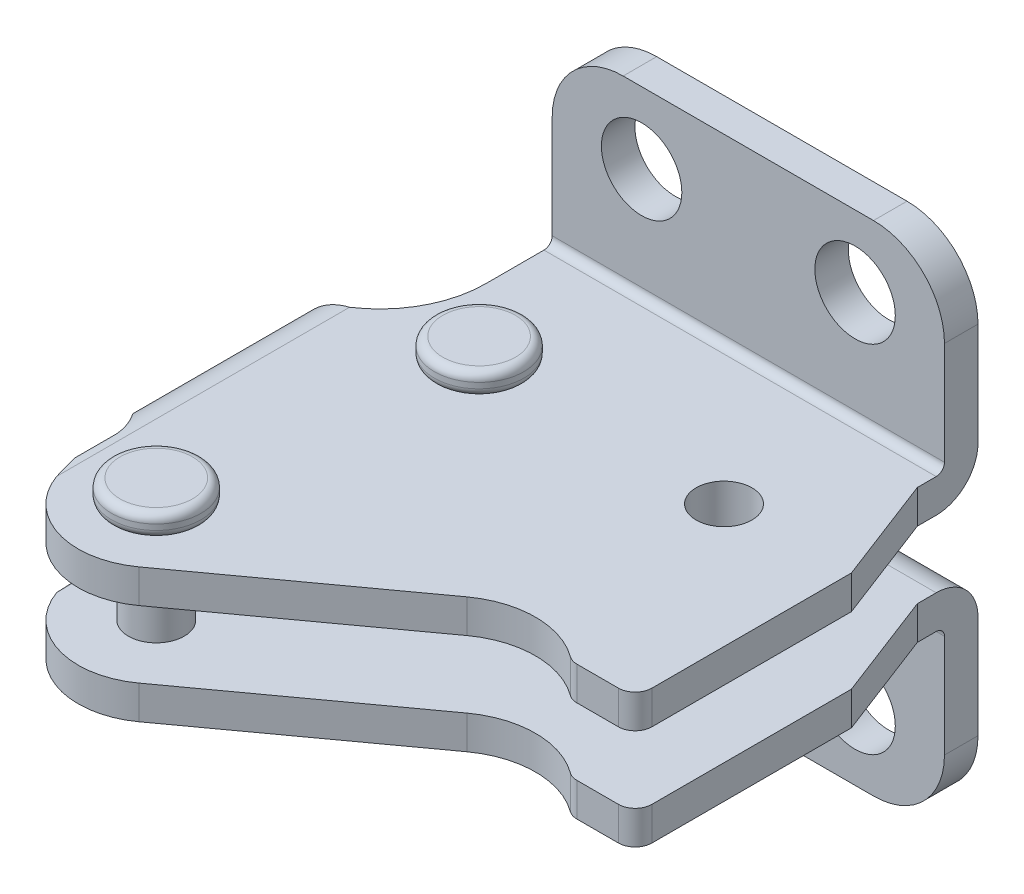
ISO-10303-21;
HEADER;
FILE_DESCRIPTION(('STEP AP214'),'2;1');
FILE_NAME('part.step','',(''),(''),'','','');
FILE_SCHEMA(('AUTOMOTIVE_DESIGN { 1 0 10303 214 1 1 1 1 }'));
ENDSEC;
DATA;
#1=APPLICATION_CONTEXT('core data for automotive mechanical design processes');
#2=APPLICATION_PROTOCOL_DEFINITION('international standard','automotive_design',2000,#1);
#3=PRODUCT_CONTEXT('',#1,'mechanical');
#4=PRODUCT('Part','Part','',(#3));
#5=PRODUCT_RELATED_PRODUCT_CATEGORY('part','',(#4));
#6=PRODUCT_DEFINITION_FORMATION('','',#4);
#7=PRODUCT_DEFINITION_CONTEXT('part definition',#1,'design');
#8=PRODUCT_DEFINITION('design','',#6,#7);
#9=PRODUCT_DEFINITION_SHAPE('','',#8);
#10=(LENGTH_UNIT() NAMED_UNIT(*) SI_UNIT(.MILLI.,.METRE.));
#11=(NAMED_UNIT(*) PLANE_ANGLE_UNIT() SI_UNIT($,.RADIAN.));
#12=(NAMED_UNIT(*) SI_UNIT($,.STERADIAN.) SOLID_ANGLE_UNIT());
#13=UNCERTAINTY_MEASURE_WITH_UNIT(LENGTH_MEASURE(1.E-05),#10,'distance_accuracy_value','');
#14=(GEOMETRIC_REPRESENTATION_CONTEXT(3) GLOBAL_UNCERTAINTY_ASSIGNED_CONTEXT((#13)) GLOBAL_UNIT_ASSIGNED_CONTEXT((#10,
#11,#12)) REPRESENTATION_CONTEXT('',''));
#15=CARTESIAN_POINT('',(0.,0.,0.));
#16=DIRECTION('',(0.,0.,1.));
#17=DIRECTION('',(1.,0.,0.));
#18=AXIS2_PLACEMENT_3D('',#15,#16,#17);
#19=CARTESIAN_POINT('',(19.7260000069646,21.8999081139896,15.3516081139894));
#20=DIRECTION('',(0.,-1.,0.));
#21=DIRECTION('',(0.900994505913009,0.,0.433830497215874));
#22=AXIS2_PLACEMENT_3D('',#19,#20,#21);
#23=CYLINDRICAL_SURFACE('',#22,2.5);
#24=CARTESIAN_POINT('',(19.7260000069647,9.89990811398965,15.3516081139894));
#25=DIRECTION('',(0.,1.,0.));
#26=DIRECTION('',(-0.900994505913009,0.,-0.433830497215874));
#27=AXIS2_PLACEMENT_3D('',#24,#25,#26);
#28=CIRCLE('',#27,2.5);
#29=CARTESIAN_POINT('',(17.4735137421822,9.89990811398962,14.2670318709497));
#30=VERTEX_POINT('',#29);
#31=EDGE_CURVE('E2155',#30,#30,#28,.T.);
#32=ORIENTED_EDGE('',*,*,#31,.F.);
#33=EDGE_LOOP('',(#32));
#34=FACE_BOUND('',#33,.T.);
#35=CARTESIAN_POINT('',(19.7260000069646,21.9043154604,15.3516081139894));
#36=DIRECTION('',(0.,-1.,0.));
#37=DIRECTION('',(1.,0.,0.));
#38=AXIS2_PLACEMENT_3D('',#35,#36,#37);
#39=CIRCLE('',#38,2.5);
#40=CARTESIAN_POINT('',(22.2260000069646,21.9043154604,15.3516081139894));
#41=VERTEX_POINT('',#40);
#42=EDGE_CURVE('E1121',#41,#41,#39,.T.);
#43=ORIENTED_EDGE('',*,*,#42,.F.);
#44=EDGE_LOOP('',(#43));
#45=FACE_BOUND('',#44,.T.);
#46=ADVANCED_FACE('F14',(#34,#45),#23,.F.);
#47=CARTESIAN_POINT('',(19.7260000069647,9.89990811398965,15.3516081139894));
#48=DIRECTION('',(0.,1.,0.));
#49=DIRECTION('',(-0.900994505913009,0.,-0.433830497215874));
#50=AXIS2_PLACEMENT_3D('',#47,#48,#49);
#51=PLANE('',#50);
#52=ORIENTED_EDGE('',*,*,#31,.T.);
#53=EDGE_LOOP('',(#52));
#54=FACE_BOUND('',#53,.T.);
#55=CARTESIAN_POINT('',(-5.67399999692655,9.8999081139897,40.7516486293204));
#56=DIRECTION('',(0.,1.,0.));
#57=DIRECTION('',(-1.,0.,0.));
#58=AXIS2_PLACEMENT_3D('',#55,#56,#57);
#59=CIRCLE('',#58,3.25);
#60=CARTESIAN_POINT('',(-8.92399999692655,9.89990811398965,40.7516486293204));
#61=VERTEX_POINT('',#60);
#62=EDGE_CURVE('E3612',#61,#61,#59,.T.);
#63=ORIENTED_EDGE('',*,*,#62,.T.);
#64=EDGE_LOOP('',(#63));
#65=FACE_BOUND('',#64,.T.);
#66=CARTESIAN_POINT('',(-2.1863999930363,9.89990811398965,15.3516486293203));
#67=DIRECTION('',(0.,1.,0.));
#68=DIRECTION('',(-1.,0.,0.));
#69=AXIS2_PLACEMENT_3D('',#66,#67,#68);
#70=CIRCLE('',#69,3.25);
#71=CARTESIAN_POINT('',(-5.4363999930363,9.89990811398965,15.3516486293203));
#72=VERTEX_POINT('',#71);
#73=EDGE_CURVE('E3230',#72,#72,#70,.T.);
#74=ORIENTED_EDGE('',*,*,#73,.T.);
#75=EDGE_LOOP('',(#74));
#76=FACE_BOUND('',#75,.T.);
#77=DIRECTION('',(0.,0.,1.));
#78=VECTOR('',#77,1.);
#79=CARTESIAN_POINT('',(-7.99899998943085,9.89990811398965,8.93584225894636));
#80=LINE('',#79,#78);
#81=CARTESIAN_POINT('',(-7.99899998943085,9.89990811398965,3.73999999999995));
#82=VERTEX_POINT('',#81);
#83=CARTESIAN_POINT('',(-7.99899998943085,9.89990811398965,8.93584225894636));
#84=VERTEX_POINT('',#83);
#85=EDGE_CURVE('E43',#82,#84,#80,.T.);
#86=ORIENTED_EDGE('',*,*,#85,.F.);
#87=DIRECTION('',(1.,0.,0.));
#88=VECTOR('',#87,1.);
#89=CARTESIAN_POINT('',(-56.5680156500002,9.899908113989,3.73999999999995));
#90=LINE('',#89,#88);
#91=CARTESIAN_POINT('',(27.1,9.8999081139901,3.73999999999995));
#92=VERTEX_POINT('',#91);
#93=EDGE_CURVE('E299',#82,#92,#90,.T.);
#94=ORIENTED_EDGE('',*,*,#93,.T.);
#95=DIRECTION('',(0.,0.,-1.));
#96=VECTOR('',#95,1.);
#97=CARTESIAN_POINT('',(27.1,9.8999081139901,5.42625929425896));
#98=LINE('',#97,#96);
#99=CARTESIAN_POINT('',(27.1,9.8999081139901,5.42625929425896));
#100=VERTEX_POINT('',#99);
#101=EDGE_CURVE('E297',#100,#92,#98,.T.);
#102=ORIENTED_EDGE('',*,*,#101,.F.);
#103=DIRECTION('',(-0.358367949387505,0.,-0.933580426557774));
#104=VECTOR('',#103,1.);
#105=CARTESIAN_POINT('',(30.7750000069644,9.89990811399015,14.9999616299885));
#106=LINE('',#105,#104);
#107=CARTESIAN_POINT('',(30.7750000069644,9.89990811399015,14.9999616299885));
#108=VERTEX_POINT('',#107);
#109=EDGE_CURVE('E285',#108,#100,#106,.T.);
#110=ORIENTED_EDGE('',*,*,#109,.F.);
#111=DIRECTION('',(0.,0.,-1.));
#112=VECTOR('',#111,1.);
#113=CARTESIAN_POINT('',(30.7750000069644,9.89990811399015,32.8496486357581));
#114=LINE('',#113,#112);
#115=CARTESIAN_POINT('',(30.7750000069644,9.89990811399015,32.8496486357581));
#116=VERTEX_POINT('',#115);
#117=EDGE_CURVE('E337',#116,#108,#114,.T.);
#118=ORIENTED_EDGE('',*,*,#117,.F.);
#119=CARTESIAN_POINT('',(29.2750000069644,9.89990811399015,32.8496486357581));
#120=DIRECTION('',(0.,1.,0.));
#121=DIRECTION('',(-1.,0.,0.));
#122=AXIS2_PLACEMENT_3D('',#119,#120,#121);
#123=CIRCLE('',#122,1.49999999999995);
#124=CARTESIAN_POINT('',(29.2750000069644,9.89990811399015,34.349648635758));
#125=VERTEX_POINT('',#124);
#126=EDGE_CURVE('E338',#125,#116,#123,.T.);
#127=ORIENTED_EDGE('',*,*,#126,.F.);
#128=DIRECTION('',(1.,0.,0.));
#129=VECTOR('',#128,1.);
#130=CARTESIAN_POINT('',(29.2750000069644,9.89990811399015,34.349648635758));
#131=LINE('',#130,#129);
#132=CARTESIAN_POINT('',(25.5719358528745,9.8999081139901,34.349648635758));
#133=VERTEX_POINT('',#132);
#134=EDGE_CURVE('E446',#133,#125,#131,.T.);
#135=ORIENTED_EDGE('',*,*,#134,.F.);
#136=CARTESIAN_POINT('',(25.5719358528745,9.8999081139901,32.8496486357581));
#137=DIRECTION('',(0.,1.,0.));
#138=DIRECTION('',(-1.,0.,0.));
#139=AXIS2_PLACEMENT_3D('',#136,#137,#138);
#140=CIRCLE('',#139,1.49999999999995);
#141=CARTESIAN_POINT('',(24.6887924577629,9.8999081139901,34.0621080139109));
#142=VERTEX_POINT('',#141);
#143=EDGE_CURVE('E331',#142,#133,#140,.T.);
#144=ORIENTED_EDGE('',*,*,#143,.F.);
#145=CARTESIAN_POINT('',(20.052878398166,9.89990811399,40.4267114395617));
#146=DIRECTION('',(0.,-1.,0.));
#147=DIRECTION('',(-1.,0.,0.));
#148=AXIS2_PLACEMENT_3D('',#145,#146,#147);
#149=CIRCLE('',#148,7.8739999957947);
#150=CARTESIAN_POINT('',(15.4246573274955,9.89990811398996,34.0565116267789));
#151=VERTEX_POINT('',#150);
#152=EDGE_CURVE('E332',#151,#142,#149,.T.);
#153=ORIENTED_EDGE('',*,*,#152,.F.);
#154=DIRECTION('',(0.809016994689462,0.,-0.587785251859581));
#155=VECTOR('',#154,1.);
#156=CARTESIAN_POINT('',(-1.5683200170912,9.89990811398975,46.4026323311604));
#157=LINE('',#156,#155);
#158=CARTESIAN_POINT('',(-1.5683200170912,9.89990811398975,46.4026323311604));
#159=VERTEX_POINT('',#158);
#160=EDGE_CURVE('E342',#159,#151,#157,.T.);
#161=ORIENTED_EDGE('',*,*,#160,.F.);
#162=CARTESIAN_POINT('',(-5.67399999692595,9.89990811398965,40.7516486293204));
#163=DIRECTION('',(0.,1.,0.));
#164=DIRECTION('',(-1.,0.,0.));
#165=AXIS2_PLACEMENT_3D('',#162,#163,#164);
#166=CIRCLE('',#165,6.98499999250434);
#167=CARTESIAN_POINT('',(-12.2652114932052,9.8999081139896,43.0638242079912));
#168=VERTEX_POINT('',#167);
#169=EDGE_CURVE('E646',#168,#159,#166,.T.);
#170=ORIENTED_EDGE('',*,*,#169,.F.);
#171=DIRECTION('',(0.,0.,1.));
#172=VECTOR('',#171,1.);
#173=CARTESIAN_POINT('',(-12.2652114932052,9.8999081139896,-8.98429188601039));
#174=LINE('',#173,#172);
#175=CARTESIAN_POINT('',(-12.2652114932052,9.8999081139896,16.8641118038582));
#176=VERTEX_POINT('',#175);
#177=EDGE_CURVE('E295',#176,#168,#174,.T.);
#178=ORIENTED_EDGE('',*,*,#177,.F.);
#179=CARTESIAN_POINT('',(-17.4989999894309,9.8999081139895,8.93584225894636));
#180=DIRECTION('',(0.,-1.,0.));
#181=DIRECTION('',(-1.,0.,0.));
#182=AXIS2_PLACEMENT_3D('',#179,#180,#181);
#183=CIRCLE('',#182,9.5);
#184=EDGE_CURVE('E1001',#84,#176,#183,.T.);
#185=ORIENTED_EDGE('',*,*,#184,.F.);
#186=EDGE_LOOP('',(#86,#94,#102,#110,#118,#127,#135,#144,#153,#161,#170,#178,#185));
#187=FACE_BOUND('',#186,.T.);
#188=ADVANCED_FACE('F298',(#54,#65,#76,#187),#51,.F.);
#189=CARTESIAN_POINT('',(19.7260000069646,21.8999081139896,15.3516081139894));
#190=DIRECTION('',(0.,-1.,0.));
#191=DIRECTION('',(0.900994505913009,0.,0.433830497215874));
#192=AXIS2_PLACEMENT_3D('',#189,#190,#191);
#193=CYLINDRICAL_SURFACE('',#192,4.);
#194=CARTESIAN_POINT('',(19.7260000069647,12.89990811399,15.3516081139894));
#195=DIRECTION('',(0.,1.,0.));
#196=DIRECTION('',(-1.,0.,0.));
#197=AXIS2_PLACEMENT_3D('',#194,#195,#196);
#198=CIRCLE('',#197,4.);
#199=CARTESIAN_POINT('',(15.7260000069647,12.8999081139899,15.3516081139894));
#200=VERTEX_POINT('',#199);
#201=EDGE_CURVE('E9',#200,#200,#198,.F.);
#202=ORIENTED_EDGE('',*,*,#201,.F.);
#203=EDGE_LOOP('',(#202));
#204=FACE_BOUND('',#203,.T.);
#205=CARTESIAN_POINT('',(19.7260000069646,18.9043154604,15.3516081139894));
#206=DIRECTION('',(0.,-1.,0.));
#207=DIRECTION('',(1.,0.,0.));
#208=AXIS2_PLACEMENT_3D('',#205,#206,#207);
#209=CIRCLE('',#208,4.);
#210=CARTESIAN_POINT('',(23.7260000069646,18.9043154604,15.3516081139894));
#211=VERTEX_POINT('',#210);
#212=EDGE_CURVE('E28',#211,#211,#209,.F.);
#213=ORIENTED_EDGE('',*,*,#212,.F.);
#214=EDGE_LOOP('',(#213));
#215=FACE_BOUND('',#214,.T.);
#216=ADVANCED_FACE('F1282',(#204,#215),#193,.T.);
#217=CARTESIAN_POINT('',(-2.1863999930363,23.9399081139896,15.3516486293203));
#218=DIRECTION('',(0.,1.,0.));
#219=DIRECTION('',(-1.,0.,0.));
#220=AXIS2_PLACEMENT_3D('',#217,#218,#219);
#221=PLANE('',#220);
#222=CARTESIAN_POINT('',(-2.1863999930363,23.9399081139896,15.3516486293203));
#223=DIRECTION('',(0.,1.,0.));
#224=DIRECTION('',(-1.,0.,0.));
#225=AXIS2_PLACEMENT_3D('',#222,#223,#224);
#226=CIRCLE('',#225,3.25);
#227=CARTESIAN_POINT('',(-5.4363999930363,23.9399081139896,15.3516486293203));
#228=VERTEX_POINT('',#227);
#229=EDGE_CURVE('E1139',#228,#228,#226,.T.);
#230=ORIENTED_EDGE('',*,*,#229,.T.);
#231=EDGE_LOOP('',(#230));
#232=FACE_BOUND('',#231,.T.);
#233=ADVANCED_FACE('F1279',(#232),#221,.T.);
#234=CARTESIAN_POINT('',(-2.1863999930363,23.1899081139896,15.3516486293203));
#235=DIRECTION('',(0.,1.,0.));
#236=DIRECTION('',(-1.,0.,0.));
#237=AXIS2_PLACEMENT_3D('',#234,#235,#236);
#238=TOROIDAL_SURFACE('',#237,3.25,0.75);
#239=ORIENTED_EDGE('',*,*,#229,.F.);
#240=EDGE_LOOP('',(#239));
#241=FACE_BOUND('',#240,.T.);
#242=CARTESIAN_POINT('',(-2.1863999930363,23.1899081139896,15.3516486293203));
#243=DIRECTION('',(0.,-1.,0.));
#244=DIRECTION('',(-1.,0.,0.));
#245=AXIS2_PLACEMENT_3D('',#242,#243,#244);
#246=CIRCLE('',#245,4.);
#247=CARTESIAN_POINT('',(-6.1863999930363,23.1899081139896,15.3516486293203));
#248=VERTEX_POINT('',#247);
#249=EDGE_CURVE('E3198',#248,#248,#246,.T.);
#250=ORIENTED_EDGE('',*,*,#249,.F.);
#251=EDGE_LOOP('',(#250));
#252=FACE_BOUND('',#251,.T.);
#253=ADVANCED_FACE('F1281',(#241,#252),#238,.T.);
#254=CARTESIAN_POINT('',(-5.67399999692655,23.922111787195,31.810227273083));
#255=DIRECTION('',(0.,1.,0.));
#256=DIRECTION('',(-1.,0.,0.));
#257=AXIS2_PLACEMENT_3D('',#254,#255,#256);
#258=PLANE('',#257);
#259=CARTESIAN_POINT('',(-5.67399999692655,23.922111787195,40.7516486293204));
#260=DIRECTION('',(0.,1.,0.));
#261=DIRECTION('',(-1.,0.,0.));
#262=AXIS2_PLACEMENT_3D('',#259,#260,#261);
#263=CIRCLE('',#262,3.25);
#264=CARTESIAN_POINT('',(-8.92399999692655,23.922111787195,40.7516486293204));
#265=VERTEX_POINT('',#264);
#266=EDGE_CURVE('E3186',#265,#265,#263,.T.);
#267=ORIENTED_EDGE('',*,*,#266,.T.);
#268=EDGE_LOOP('',(#267));
#269=FACE_BOUND('',#268,.T.);
#270=ADVANCED_FACE('F1289',(#269),#258,.T.);
#271=CARTESIAN_POINT('',(-2.1863999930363,23.9399081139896,15.3516486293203));
#272=DIRECTION('',(0.,-1.,0.));
#273=DIRECTION('',(1.,0.,0.));
#274=AXIS2_PLACEMENT_3D('',#271,#272,#273);
#275=CYLINDRICAL_SURFACE('',#274,4.);
#276=CARTESIAN_POINT('',(-2.1863999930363,22.6899081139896,15.3516486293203));
#277=DIRECTION('',(0.,1.,0.));
#278=DIRECTION('',(-1.,0.,0.));
#279=AXIS2_PLACEMENT_3D('',#276,#277,#278);
#280=CIRCLE('',#279,4.);
#281=CARTESIAN_POINT('',(-6.1863999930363,22.6899081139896,15.3516486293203));
#282=VERTEX_POINT('',#281);
#283=EDGE_CURVE('E3205',#282,#282,#280,.T.);
#284=ORIENTED_EDGE('',*,*,#283,.T.);
#285=EDGE_LOOP('',(#284));
#286=FACE_BOUND('',#285,.T.);
#287=ORIENTED_EDGE('',*,*,#249,.T.);
#288=EDGE_LOOP('',(#287));
#289=FACE_BOUND('',#288,.T.);
#290=ADVANCED_FACE('F1322',(#286,#289),#275,.T.);
#291=CARTESIAN_POINT('',(-5.67399999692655,23.172111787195,40.7516486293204));
#292=DIRECTION('',(0.,1.,0.));
#293=DIRECTION('',(-1.,0.,0.));
#294=AXIS2_PLACEMENT_3D('',#291,#292,#293);
#295=TOROIDAL_SURFACE('',#294,3.25,0.75);
#296=ORIENTED_EDGE('',*,*,#266,.F.);
#297=EDGE_LOOP('',(#296));
#298=FACE_BOUND('',#297,.T.);
#299=CARTESIAN_POINT('',(-5.67399999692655,23.172111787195,40.7516486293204));
#300=DIRECTION('',(0.,-1.,0.));
#301=DIRECTION('',(-1.,0.,0.));
#302=AXIS2_PLACEMENT_3D('',#299,#300,#301);
#303=CIRCLE('',#302,4.);
#304=CARTESIAN_POINT('',(-9.67399999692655,23.172111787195,40.7516486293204));
#305=VERTEX_POINT('',#304);
#306=EDGE_CURVE('E3137',#305,#305,#303,.T.);
#307=ORIENTED_EDGE('',*,*,#306,.F.);
#308=EDGE_LOOP('',(#307));
#309=FACE_BOUND('',#308,.T.);
#310=ADVANCED_FACE('F1297',(#298,#309),#295,.T.);
#311=CARTESIAN_POINT('',(-5.67399999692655,7.882111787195,31.810227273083));
#312=DIRECTION('',(0.,1.,0.));
#313=DIRECTION('',(-1.,0.,0.));
#314=AXIS2_PLACEMENT_3D('',#311,#312,#313);
#315=PLANE('',#314);
#316=CARTESIAN_POINT('',(-5.67399999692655,7.882111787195,40.7516486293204));
#317=DIRECTION('',(0.,-1.,0.));
#318=DIRECTION('',(-1.,0.,0.));
#319=AXIS2_PLACEMENT_3D('',#316,#317,#318);
#320=CIRCLE('',#319,3.25);
#321=CARTESIAN_POINT('',(-8.92399999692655,7.882111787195,40.7516486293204));
#322=VERTEX_POINT('',#321);
#323=EDGE_CURVE('E3170',#322,#322,#320,.T.);
#324=ORIENTED_EDGE('',*,*,#323,.T.);
#325=EDGE_LOOP('',(#324));
#326=FACE_BOUND('',#325,.T.);
#327=ADVANCED_FACE('F1303',(#326),#315,.F.);
#328=CARTESIAN_POINT('',(-2.1863999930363,22.6899081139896,15.3516486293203));
#329=DIRECTION('',(0.,1.,0.));
#330=DIRECTION('',(-1.,0.,0.));
#331=AXIS2_PLACEMENT_3D('',#328,#329,#330);
#332=TOROIDAL_SURFACE('',#331,3.25,0.75);
#333=ORIENTED_EDGE('',*,*,#283,.F.);
#334=EDGE_LOOP('',(#333));
#335=FACE_BOUND('',#334,.T.);
#336=CARTESIAN_POINT('',(-2.1863999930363,21.9399081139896,15.3516486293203));
#337=DIRECTION('',(0.,-1.,0.));
#338=DIRECTION('',(-1.,0.,0.));
#339=AXIS2_PLACEMENT_3D('',#336,#337,#338);
#340=CIRCLE('',#339,3.25);
#341=CARTESIAN_POINT('',(-5.4363999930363,21.9399081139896,15.3516486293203));
#342=VERTEX_POINT('',#341);
#343=EDGE_CURVE('E3246',#342,#342,#340,.T.);
#344=ORIENTED_EDGE('',*,*,#343,.F.);
#345=EDGE_LOOP('',(#344));
#346=FACE_BOUND('',#345,.T.);
#347=ADVANCED_FACE('F1299',(#335,#346),#332,.T.);
#348=CARTESIAN_POINT('',(-5.67399999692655,21.922111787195,40.7516486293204));
#349=DIRECTION('',(0.,1.,0.));
#350=DIRECTION('',(-1.,0.,0.));
#351=AXIS2_PLACEMENT_3D('',#348,#349,#350);
#352=CYLINDRICAL_SURFACE('',#351,4.);
#353=ORIENTED_EDGE('',*,*,#306,.T.);
#354=EDGE_LOOP('',(#353));
#355=FACE_BOUND('',#354,.T.);
#356=CARTESIAN_POINT('',(-5.67399999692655,22.672111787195,40.7516486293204));
#357=DIRECTION('',(0.,1.,0.));
#358=DIRECTION('',(1.,0.,0.));
#359=AXIS2_PLACEMENT_3D('',#356,#357,#358);
#360=CIRCLE('',#359,4.);
#361=CARTESIAN_POINT('',(-1.67399999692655,22.672111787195,40.7516486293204));
#362=VERTEX_POINT('',#361);
#363=EDGE_CURVE('E3130',#362,#362,#360,.T.);
#364=ORIENTED_EDGE('',*,*,#363,.T.);
#365=EDGE_LOOP('',(#364));
#366=FACE_BOUND('',#365,.T.);
#367=ADVANCED_FACE('F1302',(#355,#366),#352,.T.);
#368=CARTESIAN_POINT('',(-2.1863999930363,1.39990811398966,6.41022727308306));
#369=DIRECTION('',(0.,1.,0.));
#370=DIRECTION('',(-1.,0.,0.));
#371=AXIS2_PLACEMENT_3D('',#368,#369,#370);
#372=PLANE('',#371);
#373=CARTESIAN_POINT('',(-2.1863999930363,1.39990811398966,15.3516486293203));
#374=DIRECTION('',(0.,-1.,0.));
#375=DIRECTION('',(-1.,0.,0.));
#376=AXIS2_PLACEMENT_3D('',#373,#374,#375);
#377=CIRCLE('',#376,3.25);
#378=CARTESIAN_POINT('',(-5.4363999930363,1.39990811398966,15.3516486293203));
#379=VERTEX_POINT('',#378);
#380=EDGE_CURVE('E3238',#379,#379,#377,.T.);
#381=ORIENTED_EDGE('',*,*,#380,.T.);
#382=EDGE_LOOP('',(#381));
#383=FACE_BOUND('',#382,.T.);
#384=ADVANCED_FACE('F1338',(#383),#372,.F.);
#385=CARTESIAN_POINT('',(-5.67399999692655,8.63211178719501,40.7516486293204));
#386=DIRECTION('',(0.,1.,0.));
#387=DIRECTION('',(-1.,0.,0.));
#388=AXIS2_PLACEMENT_3D('',#385,#386,#387);
#389=TOROIDAL_SURFACE('',#388,3.25,0.75);
#390=CARTESIAN_POINT('',(-5.67399999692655,8.63211178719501,40.7516486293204));
#391=DIRECTION('',(0.,1.,0.));
#392=DIRECTION('',(-1.,0.,0.));
#393=AXIS2_PLACEMENT_3D('',#390,#391,#392);
#394=CIRCLE('',#393,4.);
#395=CARTESIAN_POINT('',(-9.67399999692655,8.63211178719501,40.7516486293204));
#396=VERTEX_POINT('',#395);
#397=EDGE_CURVE('E3154',#396,#396,#394,.T.);
#398=ORIENTED_EDGE('',*,*,#397,.F.);
#399=EDGE_LOOP('',(#398));
#400=FACE_BOUND('',#399,.T.);
#401=ORIENTED_EDGE('',*,*,#323,.F.);
#402=EDGE_LOOP('',(#401));
#403=FACE_BOUND('',#402,.T.);
#404=ADVANCED_FACE('F1341',(#400,#403),#389,.T.);
#405=CARTESIAN_POINT('',(-2.60208521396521E-13,31.8042235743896,-9.00440734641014));
#406=DIRECTION('',(0.,0.,-1.));
#407=DIRECTION('',(1.,0.,0.));
#408=AXIS2_PLACEMENT_3D('',#405,#406,#407);
#409=CYLINDRICAL_SURFACE('',#408,3.6);
#410=CARTESIAN_POINT('',(-3.60822483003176E-13,31.8042235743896,0.));
#411=DIRECTION('',(0.,0.,-1.));
#412=DIRECTION('',(1.,0.,0.));
#413=AXIS2_PLACEMENT_3D('',#410,#411,#412);
#414=CIRCLE('',#413,3.6);
#415=CARTESIAN_POINT('',(3.59999999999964,31.8042235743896,0.));
#416=VERTEX_POINT('',#415);
#417=EDGE_CURVE('E958',#416,#416,#414,.T.);
#418=ORIENTED_EDGE('',*,*,#417,.T.);
#419=EDGE_LOOP('',(#418));
#420=FACE_BOUND('',#419,.T.);
#421=CARTESIAN_POINT('',(-3.60822483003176E-13,31.8042235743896,3.));
#422=DIRECTION('',(0.,0.,-1.));
#423=DIRECTION('',(1.,0.,0.));
#424=AXIS2_PLACEMENT_3D('',#421,#422,#423);
#425=CIRCLE('',#424,3.6);
#426=CARTESIAN_POINT('',(3.59999999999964,31.8042235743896,3.));
#427=VERTEX_POINT('',#426);
#428=EDGE_CURVE('E362',#427,#427,#425,.T.);
#429=ORIENTED_EDGE('',*,*,#428,.F.);
#430=EDGE_LOOP('',(#429));
#431=FACE_BOUND('',#430,.T.);
#432=ADVANCED_FACE('F1470',(#420,#431),#409,.F.);
#433=CARTESIAN_POINT('',(19.0999999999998,31.8042235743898,-9.00440734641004));
#434=DIRECTION('',(0.,0.,-1.));
#435=DIRECTION('',(1.,0.,0.));
#436=AXIS2_PLACEMENT_3D('',#433,#434,#435);
#437=CYLINDRICAL_SURFACE('',#436,3.6);
#438=CARTESIAN_POINT('',(19.0999999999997,31.8042235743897,0.));
#439=DIRECTION('',(0.,0.,-1.));
#440=DIRECTION('',(1.,0.,0.));
#441=AXIS2_PLACEMENT_3D('',#438,#439,#440);
#442=CIRCLE('',#441,3.6);
#443=CARTESIAN_POINT('',(22.6999999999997,31.8042235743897,0.));
#444=VERTEX_POINT('',#443);
#445=EDGE_CURVE('E962',#444,#444,#442,.T.);
#446=ORIENTED_EDGE('',*,*,#445,.T.);
#447=EDGE_LOOP('',(#446));
#448=FACE_BOUND('',#447,.T.);
#449=CARTESIAN_POINT('',(19.0999999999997,31.8042235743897,3.));
#450=DIRECTION('',(0.,0.,-1.));
#451=DIRECTION('',(1.,0.,0.));
#452=AXIS2_PLACEMENT_3D('',#449,#450,#451);
#453=CIRCLE('',#452,3.6);
#454=CARTESIAN_POINT('',(22.6999999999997,31.8042235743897,3.));
#455=VERTEX_POINT('',#454);
#456=EDGE_CURVE('E364',#455,#455,#453,.T.);
#457=ORIENTED_EDGE('',*,*,#456,.F.);
#458=EDGE_LOOP('',(#457));
#459=FACE_BOUND('',#458,.T.);
#460=ADVANCED_FACE('F841',(#448,#459),#437,.F.);
#461=CARTESIAN_POINT('',(20.7500000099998,31.8500235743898,0.));
#462=DIRECTION('',(0.,0.,1.));
#463=DIRECTION('',(-1.,0.,0.));
#464=AXIS2_PLACEMENT_3D('',#461,#462,#463);
#465=CYLINDRICAL_SURFACE('',#464,6.35);
#466=CARTESIAN_POINT('',(20.7500000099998,31.8500235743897,3.));
#467=DIRECTION('',(0.,0.,-1.));
#468=DIRECTION('',(1.,0.,0.));
#469=AXIS2_PLACEMENT_3D('',#466,#467,#468);
#470=CIRCLE('',#469,6.35);
#471=CARTESIAN_POINT('',(20.7500000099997,38.2000235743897,3.));
#472=VERTEX_POINT('',#471);
#473=CARTESIAN_POINT('',(27.1000000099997,31.8500235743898,3.));
#474=VERTEX_POINT('',#473);
#475=EDGE_CURVE('E351',#472,#474,#470,.T.);
#476=ORIENTED_EDGE('',*,*,#475,.T.);
#477=DIRECTION('',(0.,0.,1.));
#478=VECTOR('',#477,1.);
#479=CARTESIAN_POINT('',(27.1000000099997,31.8500235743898,0.));
#480=LINE('',#479,#478);
#481=CARTESIAN_POINT('',(27.1000000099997,31.8500235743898,0.));
#482=VERTEX_POINT('',#481);
#483=EDGE_CURVE('E358',#482,#474,#480,.T.);
#484=ORIENTED_EDGE('',*,*,#483,.F.);
#485=CARTESIAN_POINT('',(20.7500000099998,31.8500235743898,0.));
#486=DIRECTION('',(0.,0.,-1.));
#487=DIRECTION('',(1.,0.,0.));
#488=AXIS2_PLACEMENT_3D('',#485,#486,#487);
#489=CIRCLE('',#488,6.35);
#490=CARTESIAN_POINT('',(20.7500000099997,38.2000235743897,0.));
#491=VERTEX_POINT('',#490);
#492=EDGE_CURVE('E374',#491,#482,#489,.T.);
#493=ORIENTED_EDGE('',*,*,#492,.F.);
#494=DIRECTION('',(0.,0.,1.));
#495=VECTOR('',#494,1.);
#496=CARTESIAN_POINT('',(20.7500000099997,38.2000235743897,0.));
#497=LINE('',#496,#495);
#498=EDGE_CURVE('E348',#491,#472,#497,.T.);
#499=ORIENTED_EDGE('',*,*,#498,.T.);
#500=EDGE_LOOP('',(#476,#484,#493,#499));
#501=FACE_BOUND('',#500,.T.);
#502=ADVANCED_FACE('F1346',(#501),#465,.T.);
#503=CARTESIAN_POINT('',(-1.64899998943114,38.2000235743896,0.));
#504=DIRECTION('',(0.,-1.,0.));
#505=DIRECTION('',(0.,0.,1.));
#506=AXIS2_PLACEMENT_3D('',#503,#504,#505);
#507=PLANE('',#506);
#508=DIRECTION('',(1.,0.,0.));
#509=VECTOR('',#508,1.);
#510=CARTESIAN_POINT('',(-1.64899998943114,38.2000235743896,3.));
#511=LINE('',#510,#509);
#512=CARTESIAN_POINT('',(-1.64899998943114,38.2000235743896,3.));
#513=VERTEX_POINT('',#512);
#514=EDGE_CURVE('E352',#513,#472,#511,.T.);
#515=ORIENTED_EDGE('',*,*,#514,.T.);
#516=ORIENTED_EDGE('',*,*,#498,.F.);
#517=DIRECTION('',(1.,0.,0.));
#518=VECTOR('',#517,1.);
#519=CARTESIAN_POINT('',(-1.64899998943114,38.2000235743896,0.));
#520=LINE('',#519,#518);
#521=CARTESIAN_POINT('',(-1.64899998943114,38.2000235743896,0.));
#522=VERTEX_POINT('',#521);
#523=EDGE_CURVE('E378',#522,#491,#520,.T.);
#524=ORIENTED_EDGE('',*,*,#523,.F.);
#525=DIRECTION('',(0.,0.,1.));
#526=VECTOR('',#525,1.);
#527=CARTESIAN_POINT('',(-1.64899998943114,38.2000235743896,0.));
#528=LINE('',#527,#526);
#529=EDGE_CURVE('E447',#522,#513,#528,.T.);
#530=ORIENTED_EDGE('',*,*,#529,.T.);
#531=EDGE_LOOP('',(#515,#516,#524,#530));
#532=FACE_BOUND('',#531,.T.);
#533=ADVANCED_FACE('F1343',(#532),#507,.F.);
#534=CARTESIAN_POINT('',(-1.6489999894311,31.8500235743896,0.));
#535=DIRECTION('',(0.,0.,1.));
#536=DIRECTION('',(-1.,0.,0.));
#537=AXIS2_PLACEMENT_3D('',#534,#535,#536);
#538=CYLINDRICAL_SURFACE('',#537,6.35);
#539=CARTESIAN_POINT('',(-1.6489999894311,31.8500235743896,3.));
#540=DIRECTION('',(0.,0.,-1.));
#541=DIRECTION('',(1.,0.,0.));
#542=AXIS2_PLACEMENT_3D('',#539,#540,#541);
#543=CIRCLE('',#542,6.35);
#544=CARTESIAN_POINT('',(-7.99899998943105,31.8500235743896,3.));
#545=VERTEX_POINT('',#544);
#546=EDGE_CURVE('E399',#545,#513,#543,.T.);
#547=ORIENTED_EDGE('',*,*,#546,.T.);
#548=ORIENTED_EDGE('',*,*,#529,.F.);
#549=CARTESIAN_POINT('',(-1.6489999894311,31.8500235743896,0.));
#550=DIRECTION('',(0.,0.,-1.));
#551=DIRECTION('',(1.,0.,0.));
#552=AXIS2_PLACEMENT_3D('',#549,#550,#551);
#553=CIRCLE('',#552,6.35);
#554=CARTESIAN_POINT('',(-7.99899998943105,31.8500235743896,0.));
#555=VERTEX_POINT('',#554);
#556=EDGE_CURVE('E497',#555,#522,#553,.T.);
#557=ORIENTED_EDGE('',*,*,#556,.F.);
#558=DIRECTION('',(0.,0.,1.));
#559=VECTOR('',#558,1.);
#560=CARTESIAN_POINT('',(-7.99899998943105,31.8500235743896,0.));
#561=LINE('',#560,#559);
#562=EDGE_CURVE('E396',#555,#545,#561,.T.);
#563=ORIENTED_EDGE('',*,*,#562,.T.);
#564=EDGE_LOOP('',(#547,#548,#557,#563));
#565=FACE_BOUND('',#564,.T.);
#566=ADVANCED_FACE('F890',(#565),#538,.T.);
#567=CARTESIAN_POINT('',(27.1000000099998,17.4394723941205,0.));
#568=DIRECTION('',(-1.,0.,0.));
#569=DIRECTION('',(0.,0.,-1.));
#570=AXIS2_PLACEMENT_3D('',#567,#568,#569);
#571=PLANE('',#570);
#572=DIRECTION('',(0.,-1.,0.));
#573=VECTOR('',#572,1.);
#574=CARTESIAN_POINT('',(27.1000000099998,17.4394723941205,2.99999999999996));
#575=LINE('',#574,#573);
#576=CARTESIAN_POINT('',(27.1000000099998,22.6443154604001,2.99999999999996));
#577=VERTEX_POINT('',#576);
#578=EDGE_CURVE('E363',#474,#577,#575,.T.);
#579=ORIENTED_EDGE('',*,*,#578,.T.);
#580=CARTESIAN_POINT('',(27.1000000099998,22.6443154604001,3.73999999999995));
#581=DIRECTION('',(-1.,0.,0.));
#582=DIRECTION('',(0.,1.,0.));
#583=AXIS2_PLACEMENT_3D('',#580,#581,#582);
#584=CIRCLE('',#583,0.74);
#585=CARTESIAN_POINT('',(27.1000000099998,21.9043154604,3.73999999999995));
#586=VERTEX_POINT('',#585);
#587=EDGE_CURVE('E450',#577,#586,#584,.T.);
#588=ORIENTED_EDGE('',*,*,#587,.T.);
#589=DIRECTION('',(0.,0.,1.));
#590=VECTOR('',#589,1.);
#591=CARTESIAN_POINT('',(27.1000000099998,21.9043154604,5.42625929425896));
#592=LINE('',#591,#590);
#593=CARTESIAN_POINT('',(27.1000000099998,21.9043154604,5.42625929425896));
#594=VERTEX_POINT('',#593);
#595=EDGE_CURVE('E424',#586,#594,#592,.T.);
#596=ORIENTED_EDGE('',*,*,#595,.T.);
#597=DIRECTION('',(0.,1.,0.));
#598=VECTOR('',#597,1.);
#599=CARTESIAN_POINT('',(27.1000000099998,18.9043154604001,5.42625929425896));
#600=LINE('',#599,#598);
#601=CARTESIAN_POINT('',(27.1000000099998,18.9043154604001,5.42625929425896));
#602=VERTEX_POINT('',#601);
#603=EDGE_CURVE('E438',#602,#594,#600,.T.);
#604=ORIENTED_EDGE('',*,*,#603,.F.);
#605=DIRECTION('',(0.,0.,1.));
#606=VECTOR('',#605,1.);
#607=CARTESIAN_POINT('',(27.1000000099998,18.9043154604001,5.42625929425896));
#608=LINE('',#607,#606);
#609=CARTESIAN_POINT('',(27.1000000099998,18.9043154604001,3.73999999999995));
#610=VERTEX_POINT('',#609);
#611=EDGE_CURVE('E1086',#610,#602,#608,.T.);
#612=ORIENTED_EDGE('',*,*,#611,.F.);
#613=CARTESIAN_POINT('',(27.1000000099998,22.6443154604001,3.73999999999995));
#614=DIRECTION('',(-1.,0.,0.));
#615=DIRECTION('',(0.,-1.,0.));
#616=AXIS2_PLACEMENT_3D('',#613,#614,#615);
#617=CIRCLE('',#616,3.74);
#618=CARTESIAN_POINT('',(27.1000000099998,22.6443154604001,0.));
#619=VERTEX_POINT('',#618);
#620=EDGE_CURVE('E379',#619,#610,#617,.T.);
#621=ORIENTED_EDGE('',*,*,#620,.F.);
#622=DIRECTION('',(0.,-1.,0.));
#623=VECTOR('',#622,1.);
#624=CARTESIAN_POINT('',(27.1000000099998,17.4394723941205,0.));
#625=LINE('',#624,#623);
#626=EDGE_CURVE('E400',#482,#619,#625,.T.);
#627=ORIENTED_EDGE('',*,*,#626,.F.);
#628=ORIENTED_EDGE('',*,*,#483,.T.);
#629=EDGE_LOOP('',(#579,#588,#596,#604,#612,#621,#627,#628));
#630=FACE_BOUND('',#629,.T.);
#631=ADVANCED_FACE('F1189',(#630),#571,.F.);
#632=CARTESIAN_POINT('',(-7.9989999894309,13.9298894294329,0.));
#633=DIRECTION('',(1.,0.,0.));
#634=DIRECTION('',(0.,1.,0.));
#635=AXIS2_PLACEMENT_3D('',#632,#633,#634);
#636=PLANE('',#635);
#637=DIRECTION('',(0.,1.,0.));
#638=VECTOR('',#637,1.);
#639=CARTESIAN_POINT('',(-7.9989999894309,13.9298894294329,0.));
#640=LINE('',#639,#638);
#641=CARTESIAN_POINT('',(-7.998999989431,22.6443154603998,0.));
#642=VERTEX_POINT('',#641);
#643=EDGE_CURVE('E493',#642,#555,#640,.T.);
#644=ORIENTED_EDGE('',*,*,#643,.F.);
#645=CARTESIAN_POINT('',(-7.998999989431,22.6443154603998,3.73999999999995));
#646=DIRECTION('',(1.,0.,0.));
#647=DIRECTION('',(0.,1.,0.));
#648=AXIS2_PLACEMENT_3D('',#645,#646,#647);
#649=CIRCLE('',#648,3.74);
#650=CARTESIAN_POINT('',(-7.99899998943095,18.9043154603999,3.73999999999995));
#651=VERTEX_POINT('',#650);
#652=EDGE_CURVE('E383',#651,#642,#649,.T.);
#653=ORIENTED_EDGE('',*,*,#652,.F.);
#654=DIRECTION('',(0.,0.,-1.));
#655=VECTOR('',#654,1.);
#656=CARTESIAN_POINT('',(-7.99899998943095,18.9043154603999,8.93584225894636));
#657=LINE('',#656,#655);
#658=CARTESIAN_POINT('',(-7.99899998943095,18.9043154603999,8.93584225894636));
#659=VERTEX_POINT('',#658);
#660=EDGE_CURVE('E928',#659,#651,#657,.T.);
#661=ORIENTED_EDGE('',*,*,#660,.F.);
#662=DIRECTION('',(0.,1.,0.));
#663=VECTOR('',#662,1.);
#664=CARTESIAN_POINT('',(-7.99899998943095,18.9043154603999,8.93584225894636));
#665=LINE('',#664,#663);
#666=CARTESIAN_POINT('',(-7.998999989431,21.9043154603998,8.93584225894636));
#667=VERTEX_POINT('',#666);
#668=EDGE_CURVE('E395',#659,#667,#665,.T.);
#669=ORIENTED_EDGE('',*,*,#668,.T.);
#670=DIRECTION('',(0.,0.,-1.));
#671=VECTOR('',#670,1.);
#672=CARTESIAN_POINT('',(-7.998999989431,21.9043154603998,8.93584225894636));
#673=LINE('',#672,#671);
#674=CARTESIAN_POINT('',(-7.998999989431,21.9043154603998,3.73999999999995));
#675=VERTEX_POINT('',#674);
#676=EDGE_CURVE('E391',#667,#675,#673,.T.);
#677=ORIENTED_EDGE('',*,*,#676,.T.);
#678=CARTESIAN_POINT('',(-7.998999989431,22.6443154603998,3.73999999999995));
#679=DIRECTION('',(1.,0.,0.));
#680=DIRECTION('',(0.,1.,0.));
#681=AXIS2_PLACEMENT_3D('',#678,#679,#680);
#682=CIRCLE('',#681,0.74);
#683=CARTESIAN_POINT('',(-7.998999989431,22.6443154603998,2.99999999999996));
#684=VERTEX_POINT('',#683);
#685=EDGE_CURVE('E455',#675,#684,#682,.T.);
#686=ORIENTED_EDGE('',*,*,#685,.T.);
#687=DIRECTION('',(0.,1.,0.));
#688=VECTOR('',#687,1.);
#689=CARTESIAN_POINT('',(-7.9989999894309,13.9298894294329,2.99999999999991));
#690=LINE('',#689,#688);
#691=EDGE_CURVE('E368',#684,#545,#690,.T.);
#692=ORIENTED_EDGE('',*,*,#691,.T.);
#693=ORIENTED_EDGE('',*,*,#562,.F.);
#694=EDGE_LOOP('',(#644,#653,#661,#669,#677,#686,#692,#693));
#695=FACE_BOUND('',#694,.T.);
#696=ADVANCED_FACE('F1205',(#695),#636,.F.);
#697=CARTESIAN_POINT('',(-2.1863999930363,21.9399081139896,15.3516486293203));
#698=DIRECTION('',(0.,1.,0.));
#699=DIRECTION('',(-1.,0.,0.));
#700=AXIS2_PLACEMENT_3D('',#697,#698,#699);
#701=PLANE('',#700);
#702=ORIENTED_EDGE('',*,*,#343,.T.);
#703=EDGE_LOOP('',(#702));
#704=FACE_BOUND('',#703,.T.);
#705=CARTESIAN_POINT('',(-2.1863999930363,21.9399081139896,15.3516486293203));
#706=DIRECTION('',(0.,1.,0.));
#707=DIRECTION('',(-1.,0.,0.));
#708=AXIS2_PLACEMENT_3D('',#705,#706,#707);
#709=CIRCLE('',#708,2.5);
#710=CARTESIAN_POINT('',(-4.6863999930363,21.9399081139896,15.3516486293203));
#711=VERTEX_POINT('',#710);
#712=EDGE_CURVE('E3254',#711,#711,#709,.T.);
#713=ORIENTED_EDGE('',*,*,#712,.T.);
#714=EDGE_LOOP('',(#713));
#715=FACE_BOUND('',#714,.T.);
#716=ADVANCED_FACE('F1317',(#704,#715),#701,.F.);
#717=CARTESIAN_POINT('',(20.7500000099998,31.8500235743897,3.));
#718=DIRECTION('',(0.,0.,-1.));
#719=DIRECTION('',(-1.,0.,0.));
#720=AXIS2_PLACEMENT_3D('',#717,#718,#719);
#721=PLANE('',#720);
#722=DIRECTION('',(-1.,0.,0.));
#723=VECTOR('',#722,1.);
#724=CARTESIAN_POINT('',(20.7500000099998,22.6443154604,2.99999999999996));
#725=LINE('',#724,#723);
#726=EDGE_CURVE('E384',#577,#684,#725,.T.);
#727=ORIENTED_EDGE('',*,*,#726,.F.);
#728=ORIENTED_EDGE('',*,*,#578,.F.);
#729=ORIENTED_EDGE('',*,*,#475,.F.);
#730=ORIENTED_EDGE('',*,*,#514,.F.);
#731=ORIENTED_EDGE('',*,*,#546,.F.);
#732=ORIENTED_EDGE('',*,*,#691,.F.);
#733=EDGE_LOOP('',(#727,#728,#729,#730,#731,#732));
#734=FACE_BOUND('',#733,.T.);
#735=ORIENTED_EDGE('',*,*,#456,.T.);
#736=EDGE_LOOP('',(#735));
#737=FACE_BOUND('',#736,.T.);
#738=ORIENTED_EDGE('',*,*,#428,.T.);
#739=EDGE_LOOP('',(#738));
#740=FACE_BOUND('',#739,.T.);
#741=ADVANCED_FACE('F1319',(#734,#737,#740),#721,.F.);
#742=CARTESIAN_POINT('',(-5.67399999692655,22.672111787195,40.7516486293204));
#743=DIRECTION('',(0.,-1.,0.));
#744=DIRECTION('',(1.,0.,0.));
#745=AXIS2_PLACEMENT_3D('',#742,#743,#744);
#746=TOROIDAL_SURFACE('',#745,3.25,0.75);
#747=CARTESIAN_POINT('',(-5.67399999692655,21.922111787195,40.7516486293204));
#748=DIRECTION('',(0.,-1.,0.));
#749=DIRECTION('',(1.,0.,0.));
#750=AXIS2_PLACEMENT_3D('',#747,#748,#749);
#751=CIRCLE('',#750,3.25);
#752=CARTESIAN_POINT('',(-2.42399999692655,21.922111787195,40.7516486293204));
#753=VERTEX_POINT('',#752);
#754=EDGE_CURVE('E3178',#753,#753,#751,.T.);
#755=ORIENTED_EDGE('',*,*,#754,.F.);
#756=EDGE_LOOP('',(#755));
#757=FACE_BOUND('',#756,.T.);
#758=ORIENTED_EDGE('',*,*,#363,.F.);
#759=EDGE_LOOP('',(#758));
#760=FACE_BOUND('',#759,.T.);
#761=ADVANCED_FACE('F2179',(#757,#760),#746,.T.);
#762=CARTESIAN_POINT('',(-12.7652114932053,15.4921039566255,8.93584225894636));
#763=DIRECTION('',(-1.,0.,0.));
#764=DIRECTION('',(0.,-1.,0.));
#765=AXIS2_PLACEMENT_3D('',#762,#763,#764);
#766=CYLINDRICAL_SURFACE('',#765,9.5);
#767=CARTESIAN_POINT('',(-12.7652114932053,15.4921039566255,8.93584225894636));
#768=DIRECTION('',(-1.,0.,0.));
#769=DIRECTION('',(0.,1.,0.));
#770=AXIS2_PLACEMENT_3D('',#767,#768,#769);
#771=CIRCLE('',#770,9.5);
#772=CARTESIAN_POINT('',(-12.7652114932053,13.3999081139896,18.2025955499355));
#773=VERTEX_POINT('',#772);
#774=CARTESIAN_POINT('',(-12.7652114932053,15.4921039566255,18.4358422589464));
#775=VERTEX_POINT('',#774);
#776=EDGE_CURVE('E587',#773,#775,#771,.T.);
#777=ORIENTED_EDGE('',*,*,#776,.F.);
#778=CARTESIAN_POINT('',(-12.7652114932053,13.3999081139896,18.2025955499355));
#779=CARTESIAN_POINT('',(-13.7652114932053,13.3999081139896,18.2025955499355));
#780=CARTESIAN_POINT('',(-14.7652114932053,13.3999081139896,18.2025955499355));
#781=CARTESIAN_POINT('',(-15.7652114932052,13.3999081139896,18.2025955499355));
#782=(BOUNDED_CURVE() B_SPLINE_CURVE(3,(#778,#779,#780,#781),.UNSPECIFIED.,.F.,
.F.) B_SPLINE_CURVE_WITH_KNOTS((4,4),(0.,1.),
.UNSPECIFIED.) CURVE() GEOMETRIC_REPRESENTATION_ITEM() RATIONAL_B_SPLINE_CURVE((1.,1.,1.,1.)) REPRESENTATION_ITEM(''));
#783=CARTESIAN_POINT('',(-15.7652114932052,13.3999081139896,18.2025955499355));
#784=VERTEX_POINT('',#783);
#785=EDGE_CURVE('E811',#773,#784,#782,.T.);
#786=ORIENTED_EDGE('',*,*,#785,.T.);
#787=CARTESIAN_POINT('',(-15.7652114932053,15.4921039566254,8.93584225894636));
#788=DIRECTION('',(-1.,0.,0.));
#789=DIRECTION('',(0.,1.,0.));
#790=AXIS2_PLACEMENT_3D('',#787,#788,#789);
#791=CIRCLE('',#790,9.5);
#792=CARTESIAN_POINT('',(-15.7652114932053,15.4921039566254,18.4358422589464));
#793=VERTEX_POINT('',#792);
#794=EDGE_CURVE('E717',#784,#793,#791,.T.);
#795=ORIENTED_EDGE('',*,*,#794,.T.);
#796=DIRECTION('',(-1.,0.,0.));
#797=VECTOR('',#796,1.);
#798=CARTESIAN_POINT('',(-12.7652114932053,15.4921039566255,18.4358422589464));
#799=LINE('',#798,#797);
#800=EDGE_CURVE('E407',#775,#793,#799,.T.);
#801=ORIENTED_EDGE('',*,*,#800,.F.);
#802=EDGE_LOOP('',(#777,#786,#795,#801));
#803=FACE_BOUND('',#802,.T.);
#804=ADVANCED_FACE('F2185',(#803),#766,.F.);
#805=CARTESIAN_POINT('',(-12.7652114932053,15.4921039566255,18.4358422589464));
#806=DIRECTION('',(0.,0.,1.));
#807=DIRECTION('',(0.,1.,0.));
#808=AXIS2_PLACEMENT_3D('',#805,#806,#807);
#809=PLANE('',#808);
#810=DIRECTION('',(0.,1.,0.));
#811=VECTOR('',#810,1.);
#812=CARTESIAN_POINT('',(-15.7652114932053,15.4921039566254,18.4358422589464));
#813=LINE('',#812,#811);
#814=CARTESIAN_POINT('',(-15.7652114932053,16.3121196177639,18.4358422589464));
#815=VERTEX_POINT('',#814);
#816=EDGE_CURVE('E411',#793,#815,#813,.T.);
#817=ORIENTED_EDGE('',*,*,#816,.T.);
#818=DIRECTION('',(-1.,0.,0.));
#819=VECTOR('',#818,1.);
#820=CARTESIAN_POINT('',(-12.7652114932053,16.3121196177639,18.4358422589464));
#821=LINE('',#820,#819);
#822=CARTESIAN_POINT('',(-12.7652114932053,16.3121196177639,18.4358422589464));
#823=VERTEX_POINT('',#822);
#824=EDGE_CURVE('E412',#823,#815,#821,.T.);
#825=ORIENTED_EDGE('',*,*,#824,.F.);
#826=DIRECTION('',(0.,1.,0.));
#827=VECTOR('',#826,1.);
#828=CARTESIAN_POINT('',(-12.7652114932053,15.4921039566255,18.4358422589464));
#829=LINE('',#828,#827);
#830=EDGE_CURVE('E592',#775,#823,#829,.T.);
#831=ORIENTED_EDGE('',*,*,#830,.F.);
#832=ORIENTED_EDGE('',*,*,#800,.T.);
#833=EDGE_LOOP('',(#817,#825,#831,#832));
#834=FACE_BOUND('',#833,.T.);
#835=ADVANCED_FACE('F2932',(#834),#809,.F.);
#836=CARTESIAN_POINT('',(-12.7652114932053,16.3121196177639,8.93584225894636));
#837=DIRECTION('',(-1.,0.,0.));
#838=DIRECTION('',(0.,-1.,0.));
#839=AXIS2_PLACEMENT_3D('',#836,#837,#838);
#840=CYLINDRICAL_SURFACE('',#839,9.5);
#841=CARTESIAN_POINT('',(-12.7652114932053,18.4043154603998,18.2025955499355));
#842=CARTESIAN_POINT('',(-15.7652114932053,18.4043154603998,18.2025955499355));
#843=(BOUNDED_CURVE() B_SPLINE_CURVE(1,(#841,#842),.UNSPECIFIED.,.F.,
.F.) B_SPLINE_CURVE_WITH_KNOTS((2,2),(0.,1.),
.UNSPECIFIED.) CURVE() GEOMETRIC_REPRESENTATION_ITEM() RATIONAL_B_SPLINE_CURVE((1.,1.)) REPRESENTATION_ITEM(''));
#844=CARTESIAN_POINT('',(-12.7652114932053,18.4043154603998,18.2025955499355));
#845=VERTEX_POINT('',#844);
#846=CARTESIAN_POINT('',(-15.7652114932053,18.4043154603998,18.2025955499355));
#847=VERTEX_POINT('',#846);
#848=EDGE_CURVE('E3487',#845,#847,#843,.T.);
#849=ORIENTED_EDGE('',*,*,#848,.F.);
#850=CARTESIAN_POINT('',(-12.7652114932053,16.3121196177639,8.93584225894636));
#851=DIRECTION('',(-1.,0.,0.));
#852=DIRECTION('',(0.,1.,0.));
#853=AXIS2_PLACEMENT_3D('',#850,#851,#852);
#854=CIRCLE('',#853,9.5);
#855=EDGE_CURVE('E428',#823,#845,#854,.T.);
#856=ORIENTED_EDGE('',*,*,#855,.F.);
#857=ORIENTED_EDGE('',*,*,#824,.T.);
#858=CARTESIAN_POINT('',(-15.7652114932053,16.3121196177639,8.93584225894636));
#859=DIRECTION('',(-1.,0.,0.));
#860=DIRECTION('',(0.,1.,0.));
#861=AXIS2_PLACEMENT_3D('',#858,#859,#860);
#862=CIRCLE('',#861,9.5);
#863=EDGE_CURVE('E789',#815,#847,#862,.T.);
#864=ORIENTED_EDGE('',*,*,#863,.T.);
#865=EDGE_LOOP('',(#849,#856,#857,#864));
#866=FACE_BOUND('',#865,.T.);
#867=ADVANCED_FACE('F2941',(#866),#840,.F.);
#868=CARTESIAN_POINT('',(-12.7652114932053,15.9021117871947,36.9585748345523));
#869=DIRECTION('',(-1.,0.,0.));
#870=DIRECTION('',(0.,-1.,0.));
#871=AXIS2_PLACEMENT_3D('',#868,#869,#870);
#872=CYLINDRICAL_SURFACE('',#871,5.25000783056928);
#873=CARTESIAN_POINT('',(-15.7652114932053,18.4043154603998,32.3432136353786));
#874=CARTESIAN_POINT('',(-12.7652114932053,18.4043154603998,32.3432136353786));
#875=(BOUNDED_CURVE() B_SPLINE_CURVE(1,(#873,#874),.UNSPECIFIED.,.F.,
.F.) B_SPLINE_CURVE_WITH_KNOTS((2,2),(0.,1.),
.UNSPECIFIED.) CURVE() GEOMETRIC_REPRESENTATION_ITEM() RATIONAL_B_SPLINE_CURVE((1.,1.)) REPRESENTATION_ITEM(''));
#876=CARTESIAN_POINT('',(-15.7652114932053,18.4043154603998,32.3432136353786));
#877=VERTEX_POINT('',#876);
#878=CARTESIAN_POINT('',(-12.7652114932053,18.4043154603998,32.3432136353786));
#879=VERTEX_POINT('',#878);
#880=EDGE_CURVE('E1396',#877,#879,#875,.T.);
#881=ORIENTED_EDGE('',*,*,#880,.F.);
#882=CARTESIAN_POINT('',(-15.7652114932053,15.9021117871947,36.9585748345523));
#883=DIRECTION('',(-1.,0.,0.));
#884=DIRECTION('',(0.,1.,0.));
#885=AXIS2_PLACEMENT_3D('',#882,#883,#884);
#886=CIRCLE('',#885,5.25000783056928);
#887=CARTESIAN_POINT('',(-15.7652114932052,13.3999081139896,32.3432136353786));
#888=VERTEX_POINT('',#887);
#889=EDGE_CURVE('E706',#877,#888,#886,.T.);
#890=ORIENTED_EDGE('',*,*,#889,.T.);
#891=CARTESIAN_POINT('',(-15.7652114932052,13.3999081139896,32.3432136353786));
#892=CARTESIAN_POINT('',(-14.7652114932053,13.3999081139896,32.3432136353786));
#893=CARTESIAN_POINT('',(-13.7652114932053,13.3999081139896,32.3432136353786));
#894=CARTESIAN_POINT('',(-12.7652114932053,13.3999081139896,32.3432136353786));
#895=(BOUNDED_CURVE() B_SPLINE_CURVE(3,(#891,#892,#893,#894),.UNSPECIFIED.,.F.,
.F.) B_SPLINE_CURVE_WITH_KNOTS((4,4),(0.,1.),
.UNSPECIFIED.) CURVE() GEOMETRIC_REPRESENTATION_ITEM() RATIONAL_B_SPLINE_CURVE((1.,1.,1.,1.)) REPRESENTATION_ITEM(''));
#896=CARTESIAN_POINT('',(-12.7652114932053,13.3999081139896,32.3432136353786));
#897=VERTEX_POINT('',#896);
#898=EDGE_CURVE('E697',#888,#897,#895,.T.);
#899=ORIENTED_EDGE('',*,*,#898,.T.);
#900=CARTESIAN_POINT('',(-12.7652114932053,15.9021117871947,36.9585748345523));
#901=DIRECTION('',(-1.,0.,0.));
#902=DIRECTION('',(0.,1.,0.));
#903=AXIS2_PLACEMENT_3D('',#900,#901,#902);
#904=CIRCLE('',#903,5.25000783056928);
#905=EDGE_CURVE('E591',#879,#897,#904,.T.);
#906=ORIENTED_EDGE('',*,*,#905,.F.);
#907=EDGE_LOOP('',(#881,#890,#899,#906));
#908=FACE_BOUND('',#907,.T.);
#909=ADVANCED_FACE('F2362',(#908),#872,.F.);
#910=CARTESIAN_POINT('',(0.,0.,3.00000000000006));
#911=DIRECTION('',(0.,0.,1.));
#912=DIRECTION('',(1.,0.,0.));
#913=AXIS2_PLACEMENT_3D('',#910,#911,#912);
#914=CYLINDRICAL_SURFACE('',#913,3.6);
#915=CARTESIAN_POINT('',(0.,0.,3.00000000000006));
#916=DIRECTION('',(0.,0.,1.));
#917=DIRECTION('',(1.,0.,0.));
#918=AXIS2_PLACEMENT_3D('',#915,#916,#917);
#919=CIRCLE('',#918,3.6);
#920=CARTESIAN_POINT('',(3.6,0.,3.00000000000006));
#921=VERTEX_POINT('',#920);
#922=EDGE_CURVE('E1022',#921,#921,#919,.T.);
#923=ORIENTED_EDGE('',*,*,#922,.T.);
#924=EDGE_LOOP('',(#923));
#925=FACE_BOUND('',#924,.T.);
#926=CARTESIAN_POINT('',(0.,0.,0.));
#927=DIRECTION('',(0.,0.,-1.));
#928=DIRECTION('',(-1.,0.,0.));
#929=AXIS2_PLACEMENT_3D('',#926,#927,#928);
#930=CIRCLE('',#929,3.6);
#931=CARTESIAN_POINT('',(-3.6,0.,0.));
#932=VERTEX_POINT('',#931);
#933=EDGE_CURVE('E1059',#932,#932,#930,.T.);
#934=ORIENTED_EDGE('',*,*,#933,.T.);
#935=EDGE_LOOP('',(#934));
#936=FACE_BOUND('',#935,.T.);
#937=ADVANCED_FACE('F2351',(#925,#936),#914,.F.);
#938=CARTESIAN_POINT('',(19.1,3.05311331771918E-13,3.00000000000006));
#939=DIRECTION('',(0.,0.,1.));
#940=DIRECTION('',(1.,0.,0.));
#941=AXIS2_PLACEMENT_3D('',#938,#939,#940);
#942=CYLINDRICAL_SURFACE('',#941,3.6);
#943=CARTESIAN_POINT('',(19.1,3.05311331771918E-13,3.00000000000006));
#944=DIRECTION('',(0.,0.,1.));
#945=DIRECTION('',(1.,0.,0.));
#946=AXIS2_PLACEMENT_3D('',#943,#944,#945);
#947=CIRCLE('',#946,3.6);
#948=CARTESIAN_POINT('',(22.7,3.55189119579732E-13,3.00000000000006));
#949=VERTEX_POINT('',#948);
#950=EDGE_CURVE('E1054',#949,#949,#947,.T.);
#951=ORIENTED_EDGE('',*,*,#950,.T.);
#952=EDGE_LOOP('',(#951));
#953=FACE_BOUND('',#952,.T.);
#954=CARTESIAN_POINT('',(19.1,3.05311331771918E-13,0.));
#955=DIRECTION('',(0.,0.,-1.));
#956=DIRECTION('',(-1.,0.,0.));
#957=AXIS2_PLACEMENT_3D('',#954,#955,#956);
#958=CIRCLE('',#957,3.6);
#959=CARTESIAN_POINT('',(15.5,2.55433543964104E-13,0.));
#960=VERTEX_POINT('',#959);
#961=EDGE_CURVE('E1058',#960,#960,#958,.T.);
#962=ORIENTED_EDGE('',*,*,#961,.T.);
#963=EDGE_LOOP('',(#962));
#964=FACE_BOUND('',#963,.T.);
#965=ADVANCED_FACE('F551',(#953,#964),#942,.F.);
#966=CARTESIAN_POINT('',(27.1,14.3647511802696,0.));
#967=DIRECTION('',(-1.,0.,0.));
#968=DIRECTION('',(0.,-1.,0.));
#969=AXIS2_PLACEMENT_3D('',#966,#967,#968);
#970=PLANE('',#969);
#971=DIRECTION('',(0.,-1.,0.));
#972=VECTOR('',#971,1.);
#973=CARTESIAN_POINT('',(27.1,14.3647511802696,0.));
#974=LINE('',#973,#972);
#975=CARTESIAN_POINT('',(27.1,9.15990811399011,0.));
#976=VERTEX_POINT('',#975);
#977=CARTESIAN_POINT('',(27.1,-0.0457999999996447,0.));
#978=VERTEX_POINT('',#977);
#979=EDGE_CURVE('E1011',#976,#978,#974,.T.);
#980=ORIENTED_EDGE('',*,*,#979,.F.);
#981=CARTESIAN_POINT('',(27.1,9.15990811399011,3.73999999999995));
#982=DIRECTION('',(-1.,0.,0.));
#983=DIRECTION('',(0.,-1.,0.));
#984=AXIS2_PLACEMENT_3D('',#981,#982,#983);
#985=CIRCLE('',#984,3.74);
#986=CARTESIAN_POINT('',(27.1,12.8999081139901,3.73999999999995));
#987=VERTEX_POINT('',#986);
#988=EDGE_CURVE('E486',#987,#976,#985,.T.);
#989=ORIENTED_EDGE('',*,*,#988,.F.);
#990=DIRECTION('',(0.,0.,-1.));
#991=VECTOR('',#990,1.);
#992=CARTESIAN_POINT('',(27.1,12.8999081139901,5.42625929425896));
#993=LINE('',#992,#991);
#994=CARTESIAN_POINT('',(27.1,12.8999081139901,5.42625929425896));
#995=VERTEX_POINT('',#994);
#996=EDGE_CURVE('E309',#995,#987,#993,.T.);
#997=ORIENTED_EDGE('',*,*,#996,.F.);
#998=DIRECTION('',(0.,-1.,0.));
#999=VECTOR('',#998,1.);
#1000=CARTESIAN_POINT('',(27.1,12.8999081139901,5.42625929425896));
#1001=LINE('',#1000,#999);
#1002=EDGE_CURVE('E289',#995,#100,#1001,.T.);
#1003=ORIENTED_EDGE('',*,*,#1002,.T.);
#1004=ORIENTED_EDGE('',*,*,#101,.T.);
#1005=CARTESIAN_POINT('',(27.1,9.15990811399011,3.73999999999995));
#1006=DIRECTION('',(-1.,0.,0.));
#1007=DIRECTION('',(0.,-1.,0.));
#1008=AXIS2_PLACEMENT_3D('',#1005,#1006,#1007);
#1009=CIRCLE('',#1008,0.74);
#1010=CARTESIAN_POINT('',(27.1,9.15990811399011,2.99999999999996));
#1011=VERTEX_POINT('',#1010);
#1012=EDGE_CURVE('E1050',#92,#1011,#1009,.T.);
#1013=ORIENTED_EDGE('',*,*,#1012,.T.);
#1014=DIRECTION('',(0.,-1.,0.));
#1015=VECTOR('',#1014,1.);
#1016=CARTESIAN_POINT('',(27.1,14.3647511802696,2.99999999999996));
#1017=LINE('',#1016,#1015);
#1018=CARTESIAN_POINT('',(27.1,-0.0457999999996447,3.));
#1019=VERTEX_POINT('',#1018);
#1020=EDGE_CURVE('E346',#1011,#1019,#1017,.T.);
#1021=ORIENTED_EDGE('',*,*,#1020,.T.);
#1022=DIRECTION('',(0.,0.,1.));
#1023=VECTOR('',#1022,1.);
#1024=CARTESIAN_POINT('',(27.1,-0.0457999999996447,0.));
#1025=LINE('',#1024,#1023);
#1026=EDGE_CURVE('E373',#978,#1019,#1025,.T.);
#1027=ORIENTED_EDGE('',*,*,#1026,.F.);
#1028=EDGE_LOOP('',(#980,#989,#997,#1003,#1004,#1013,#1021,#1027));
#1029=FACE_BOUND('',#1028,.T.);
#1030=ADVANCED_FACE('F306',(#1029),#970,.F.);
#1031=CARTESIAN_POINT('',(20.75,-0.0457999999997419,0.));
#1032=DIRECTION('',(0.,0.,1.));
#1033=DIRECTION('',(1.,0.,0.));
#1034=AXIS2_PLACEMENT_3D('',#1031,#1032,#1033);
#1035=CYLINDRICAL_SURFACE('',#1034,6.35);
#1036=CARTESIAN_POINT('',(20.75,-0.0457999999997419,3.));
#1037=DIRECTION('',(0.,0.,-1.));
#1038=DIRECTION('',(-1.,0.,0.));
#1039=AXIS2_PLACEMENT_3D('',#1036,#1037,#1038);
#1040=CIRCLE('',#1039,6.35);
#1041=CARTESIAN_POINT('',(20.75,-6.3957999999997,3.));
#1042=VERTEX_POINT('',#1041);
#1043=EDGE_CURVE('E369',#1019,#1042,#1040,.T.);
#1044=ORIENTED_EDGE('',*,*,#1043,.T.);
#1045=DIRECTION('',(0.,0.,1.));
#1046=VECTOR('',#1045,1.);
#1047=CARTESIAN_POINT('',(20.75,-6.3957999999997,0.));
#1048=LINE('',#1047,#1046);
#1049=CARTESIAN_POINT('',(20.75,-6.3957999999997,0.));
#1050=VERTEX_POINT('',#1049);
#1051=EDGE_CURVE('E357',#1050,#1042,#1048,.T.);
#1052=ORIENTED_EDGE('',*,*,#1051,.F.);
#1053=CARTESIAN_POINT('',(20.75,-0.0457999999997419,0.));
#1054=DIRECTION('',(0.,0.,-1.));
#1055=DIRECTION('',(-1.,0.,0.));
#1056=AXIS2_PLACEMENT_3D('',#1053,#1054,#1055);
#1057=CIRCLE('',#1056,6.35);
#1058=EDGE_CURVE('E957',#978,#1050,#1057,.T.);
#1059=ORIENTED_EDGE('',*,*,#1058,.F.);
#1060=ORIENTED_EDGE('',*,*,#1026,.T.);
#1061=EDGE_LOOP('',(#1044,#1052,#1059,#1060));
#1062=FACE_BOUND('',#1061,.T.);
#1063=ADVANCED_FACE('F549',(#1062),#1035,.T.);
#1064=CARTESIAN_POINT('',(-1.64899998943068,-6.3958,0.));
#1065=DIRECTION('',(0.,1.,0.));
#1066=DIRECTION('',(1.,0.,0.));
#1067=AXIS2_PLACEMENT_3D('',#1064,#1065,#1066);
#1068=PLANE('',#1067);
#1069=DIRECTION('',(-1.,0.,0.));
#1070=VECTOR('',#1069,1.);
#1071=CARTESIAN_POINT('',(-1.64899998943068,-6.3958,3.));
#1072=LINE('',#1071,#1070);
#1073=CARTESIAN_POINT('',(-1.64899998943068,-6.3958,3.));
#1074=VERTEX_POINT('',#1073);
#1075=EDGE_CURVE('E353',#1042,#1074,#1072,.T.);
#1076=ORIENTED_EDGE('',*,*,#1075,.T.);
#1077=DIRECTION('',(0.,0.,1.));
#1078=VECTOR('',#1077,1.);
#1079=CARTESIAN_POINT('',(-1.64899998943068,-6.3958,0.));
#1080=LINE('',#1079,#1078);
#1081=CARTESIAN_POINT('',(-1.64899998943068,-6.3958,0.));
#1082=VERTEX_POINT('',#1081);
#1083=EDGE_CURVE('E319',#1082,#1074,#1080,.T.);
#1084=ORIENTED_EDGE('',*,*,#1083,.F.);
#1085=DIRECTION('',(-1.,0.,0.));
#1086=VECTOR('',#1085,1.);
#1087=CARTESIAN_POINT('',(-1.64899998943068,-6.3958,0.));
#1088=LINE('',#1087,#1086);
#1089=EDGE_CURVE('E953',#1050,#1082,#1088,.T.);
#1090=ORIENTED_EDGE('',*,*,#1089,.F.);
#1091=ORIENTED_EDGE('',*,*,#1051,.T.);
#1092=EDGE_LOOP('',(#1076,#1084,#1090,#1091));
#1093=FACE_BOUND('',#1092,.T.);
#1094=ADVANCED_FACE('F2454',(#1093),#1068,.F.);
#1095=CARTESIAN_POINT('',(-1.64899998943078,-0.0458000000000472,0.));
#1096=DIRECTION('',(0.,0.,1.));
#1097=DIRECTION('',(1.,0.,0.));
#1098=AXIS2_PLACEMENT_3D('',#1095,#1096,#1097);
#1099=CYLINDRICAL_SURFACE('',#1098,6.35);
#1100=CARTESIAN_POINT('',(-1.64899998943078,-0.0458000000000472,3.));
#1101=DIRECTION('',(0.,0.,-1.));
#1102=DIRECTION('',(-1.,0.,0.));
#1103=AXIS2_PLACEMENT_3D('',#1100,#1101,#1102);
#1104=CIRCLE('',#1103,6.35);
#1105=CARTESIAN_POINT('',(-7.9989999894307,-0.0458000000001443,3.));
#1106=VERTEX_POINT('',#1105);
#1107=EDGE_CURVE('E406',#1074,#1106,#1104,.T.);
#1108=ORIENTED_EDGE('',*,*,#1107,.T.);
#1109=DIRECTION('',(0.,0.,1.));
#1110=VECTOR('',#1109,1.);
#1111=CARTESIAN_POINT('',(-7.9989999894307,-0.0458000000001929,0.));
#1112=LINE('',#1111,#1110);
#1113=CARTESIAN_POINT('',(-7.9989999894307,-0.0458000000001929,0.));
#1114=VERTEX_POINT('',#1113);
#1115=EDGE_CURVE('E147',#1114,#1106,#1112,.T.);
#1116=ORIENTED_EDGE('',*,*,#1115,.F.);
#1117=CARTESIAN_POINT('',(-1.64899998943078,-0.0458000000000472,0.));
#1118=DIRECTION('',(0.,0.,-1.));
#1119=DIRECTION('',(-1.,0.,0.));
#1120=AXIS2_PLACEMENT_3D('',#1117,#1118,#1119);
#1121=CIRCLE('',#1120,6.35);
#1122=EDGE_CURVE('E157',#1082,#1114,#1121,.T.);
#1123=ORIENTED_EDGE('',*,*,#1122,.F.);
#1124=ORIENTED_EDGE('',*,*,#1083,.T.);
#1125=EDGE_LOOP('',(#1108,#1116,#1123,#1124));
#1126=FACE_BOUND('',#1125,.T.);
#1127=ADVANCED_FACE('F2422',(#1126),#1099,.T.);
#1128=CARTESIAN_POINT('',(-7.99899998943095,17.8743341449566,0.));
#1129=DIRECTION('',(1.,0.,0.));
#1130=DIRECTION('',(0.,1.,0.));
#1131=AXIS2_PLACEMENT_3D('',#1128,#1129,#1130);
#1132=PLANE('',#1131);
#1133=DIRECTION('',(0.,1.,0.));
#1134=VECTOR('',#1133,1.);
#1135=CARTESIAN_POINT('',(-7.99899998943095,17.8743341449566,2.99999999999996));
#1136=LINE('',#1135,#1134);
#1137=CARTESIAN_POINT('',(-7.99899998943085,9.15990811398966,2.99999999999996));
#1138=VERTEX_POINT('',#1137);
#1139=EDGE_CURVE('E347',#1106,#1138,#1136,.T.);
#1140=ORIENTED_EDGE('',*,*,#1139,.T.);
#1141=CARTESIAN_POINT('',(-7.99899998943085,9.15990811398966,3.73999999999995));
#1142=DIRECTION('',(1.,0.,0.));
#1143=DIRECTION('',(0.,-1.,0.));
#1144=AXIS2_PLACEMENT_3D('',#1141,#1142,#1143);
#1145=CIRCLE('',#1144,0.74);
#1146=EDGE_CURVE('E1007',#1138,#82,#1145,.T.);
#1147=ORIENTED_EDGE('',*,*,#1146,.T.);
#1148=ORIENTED_EDGE('',*,*,#85,.T.);
#1149=DIRECTION('',(0.,-1.,0.));
#1150=VECTOR('',#1149,1.);
#1151=CARTESIAN_POINT('',(-7.9989999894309,12.8999081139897,8.93584225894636));
#1152=LINE('',#1151,#1150);
#1153=CARTESIAN_POINT('',(-7.9989999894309,12.8999081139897,8.93584225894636));
#1154=VERTEX_POINT('',#1153);
#1155=EDGE_CURVE('E649',#1154,#84,#1152,.T.);
#1156=ORIENTED_EDGE('',*,*,#1155,.F.);
#1157=DIRECTION('',(0.,0.,1.));
#1158=VECTOR('',#1157,1.);
#1159=CARTESIAN_POINT('',(-7.9989999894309,12.8999081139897,8.93584225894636));
#1160=LINE('',#1159,#1158);
#1161=CARTESIAN_POINT('',(-7.9989999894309,12.8999081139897,3.73999999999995));
#1162=VERTEX_POINT('',#1161);
#1163=EDGE_CURVE('E464',#1162,#1154,#1160,.T.);
#1164=ORIENTED_EDGE('',*,*,#1163,.F.);
#1165=CARTESIAN_POINT('',(-7.99899998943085,9.15990811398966,3.73999999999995));
#1166=DIRECTION('',(1.,0.,0.));
#1167=DIRECTION('',(0.,1.,0.));
#1168=AXIS2_PLACEMENT_3D('',#1165,#1166,#1167);
#1169=CIRCLE('',#1168,3.74);
#1170=CARTESIAN_POINT('',(-7.99899998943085,9.15990811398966,0.));
#1171=VERTEX_POINT('',#1170);
#1172=EDGE_CURVE('E405',#1171,#1162,#1169,.T.);
#1173=ORIENTED_EDGE('',*,*,#1172,.F.);
#1174=DIRECTION('',(0.,1.,0.));
#1175=VECTOR('',#1174,1.);
#1176=CARTESIAN_POINT('',(-7.99899998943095,17.8743341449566,0.));
#1177=LINE('',#1176,#1175);
#1178=EDGE_CURVE('E500',#1114,#1171,#1177,.T.);
#1179=ORIENTED_EDGE('',*,*,#1178,.F.);
#1180=ORIENTED_EDGE('',*,*,#1115,.T.);
#1181=EDGE_LOOP('',(#1140,#1147,#1148,#1156,#1164,#1173,#1179,#1180));
#1182=FACE_BOUND('',#1181,.T.);
#1183=ADVANCED_FACE('F1309',(#1182),#1132,.F.);
#1184=CARTESIAN_POINT('',(-2.1863999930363,2.14990811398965,15.3516486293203));
#1185=DIRECTION('',(0.,1.,0.));
#1186=DIRECTION('',(-1.,0.,0.));
#1187=AXIS2_PLACEMENT_3D('',#1184,#1185,#1186);
#1188=TOROIDAL_SURFACE('',#1187,3.25,0.75);
#1189=CARTESIAN_POINT('',(-2.1863999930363,2.14990811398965,15.3516486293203));
#1190=DIRECTION('',(0.,1.,0.));
#1191=DIRECTION('',(-1.,0.,0.));
#1192=AXIS2_PLACEMENT_3D('',#1189,#1190,#1191);
#1193=CIRCLE('',#1192,4.);
#1194=CARTESIAN_POINT('',(-6.1863999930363,2.14990811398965,15.3516486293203));
#1195=VERTEX_POINT('',#1194);
#1196=EDGE_CURVE('E3222',#1195,#1195,#1193,.T.);
#1197=ORIENTED_EDGE('',*,*,#1196,.F.);
#1198=EDGE_LOOP('',(#1197));
#1199=FACE_BOUND('',#1198,.T.);
#1200=ORIENTED_EDGE('',*,*,#380,.F.);
#1201=EDGE_LOOP('',(#1200));
#1202=FACE_BOUND('',#1201,.T.);
#1203=ADVANCED_FACE('F1305',(#1199,#1202),#1188,.T.);
#1204=CARTESIAN_POINT('',(-5.67399999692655,9.88211178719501,40.7516486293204));
#1205=DIRECTION('',(0.,-1.,0.));
#1206=DIRECTION('',(1.,0.,0.));
#1207=AXIS2_PLACEMENT_3D('',#1204,#1205,#1206);
#1208=CYLINDRICAL_SURFACE('',#1207,4.);
#1209=ORIENTED_EDGE('',*,*,#397,.T.);
#1210=EDGE_LOOP('',(#1209));
#1211=FACE_BOUND('',#1210,.T.);
#1212=CARTESIAN_POINT('',(-5.67399999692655,9.13211178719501,40.7516486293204));
#1213=DIRECTION('',(0.,-1.,0.));
#1214=DIRECTION('',(-1.,0.,0.));
#1215=AXIS2_PLACEMENT_3D('',#1212,#1213,#1214);
#1216=CIRCLE('',#1215,4.);
#1217=CARTESIAN_POINT('',(-9.67399999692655,9.13211178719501,40.7516486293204));
#1218=VERTEX_POINT('',#1217);
#1219=EDGE_CURVE('E3146',#1218,#1218,#1216,.T.);
#1220=ORIENTED_EDGE('',*,*,#1219,.T.);
#1221=EDGE_LOOP('',(#1220));
#1222=FACE_BOUND('',#1221,.T.);
#1223=ADVANCED_FACE('F1308',(#1211,#1222),#1208,.T.);
#1224=CARTESIAN_POINT('',(-56.5680156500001,-0.0458000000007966,0.));
#1225=DIRECTION('',(0.,0.,-1.));
#1226=DIRECTION('',(0.,-1.,0.));
#1227=AXIS2_PLACEMENT_3D('',#1224,#1225,#1226);
#1228=PLANE('',#1227);
#1229=ORIENTED_EDGE('',*,*,#1178,.T.);
#1230=DIRECTION('',(1.,0.,0.));
#1231=VECTOR('',#1230,1.);
#1232=CARTESIAN_POINT('',(-56.5680156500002,9.15990811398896,0.));
#1233=LINE('',#1232,#1231);
#1234=EDGE_CURVE('E1015',#1171,#976,#1233,.T.);
#1235=ORIENTED_EDGE('',*,*,#1234,.T.);
#1236=ORIENTED_EDGE('',*,*,#979,.T.);
#1237=ORIENTED_EDGE('',*,*,#1058,.T.);
#1238=ORIENTED_EDGE('',*,*,#1089,.T.);
#1239=ORIENTED_EDGE('',*,*,#1122,.T.);
#1240=EDGE_LOOP('',(#1229,#1235,#1236,#1237,#1238,#1239));
#1241=FACE_BOUND('',#1240,.T.);
#1242=ORIENTED_EDGE('',*,*,#961,.F.);
#1243=EDGE_LOOP('',(#1242));
#1244=FACE_BOUND('',#1243,.T.);
#1245=ORIENTED_EDGE('',*,*,#933,.F.);
#1246=EDGE_LOOP('',(#1245));
#1247=FACE_BOUND('',#1246,.T.);
#1248=ADVANCED_FACE('F683',(#1241,#1244,#1247),#1228,.T.);
#1249=CARTESIAN_POINT('',(-15.7652114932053,18.4043154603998,18.2025955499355));
#1250=CARTESIAN_POINT('',(-15.7652114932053,18.9199917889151,18.1087466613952));
#1251=CARTESIAN_POINT('',(-15.6501545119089,19.4186924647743,18.0106607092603));
#1252=CARTESIAN_POINT('',(-15.2450524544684,20.303617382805,17.8053776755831));
#1253=CARTESIAN_POINT('',(-14.9557695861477,20.6892219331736,17.6982867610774));
#1254=CARTESIAN_POINT('',(-14.27700887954,21.304758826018,17.4752061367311));
#1255=CARTESIAN_POINT('',(-13.8880830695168,21.534955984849,17.3592164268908));
#1256=CARTESIAN_POINT('',(-13.0826397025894,21.8345389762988,17.1183382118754));
#1257=CARTESIAN_POINT('',(-12.6661560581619,21.9043154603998,16.9933657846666));
#1258=CARTESIAN_POINT('',(-12.2652114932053,21.9043154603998,16.8641118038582));
#1259=CARTESIAN_POINT('',(-12.7652114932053,18.4043154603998,18.2025955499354));
#1260=CARTESIAN_POINT('',(-12.7652114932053,18.4779329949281,18.1088110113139));
#1261=CARTESIAN_POINT('',(-12.7487747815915,18.5492264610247,18.0106607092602));
#1262=CARTESIAN_POINT('',(-12.6909030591,18.6756443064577,17.8053776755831));
#1263=CARTESIAN_POINT('',(-12.6495769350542,18.7307306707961,17.6982867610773));
#1264=CARTESIAN_POINT('',(-12.5526111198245,18.8186645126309,17.4752061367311));
#1265=CARTESIAN_POINT('',(-12.4970502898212,18.8515498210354,17.3592164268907));
#1266=CARTESIAN_POINT('',(-12.3819869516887,18.8943473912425,17.1183382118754));
#1267=CARTESIAN_POINT('',(-12.3225197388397,18.9043154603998,16.9934345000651));
#1268=CARTESIAN_POINT('',(-12.2652114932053,18.9043154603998,16.8641118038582));
#1269=(BOUNDED_SURFACE() B_SPLINE_SURFACE(1,3,((#1249,#1250,#1251,#1252,#1253,#1254,#1255,#1256,
#1257,#1258),(#1259,#1260,#1261,#1262,#1263,#1264,#1265,#1266,#1267,#1268)),.UNSPECIFIED.,.F.,
.F.,.F.) B_SPLINE_SURFACE_WITH_KNOTS((2,2),(4,2,2,2,4),(0.,1.),(0.,0.25,0.5,0.75,1.),
.UNSPECIFIED.) GEOMETRIC_REPRESENTATION_ITEM() RATIONAL_B_SPLINE_SURFACE(((1.,1.,1.,1.,1.,1.,1.,
1.,1.,1.),(1.,1.,1.,1.,1.,1.,1.,1.,1.,1.))) REPRESENTATION_ITEM('') SURFACE());
#1270=CARTESIAN_POINT('',(-15.7652114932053,18.4043154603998,18.2025955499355));
#1271=CARTESIAN_POINT('',(-15.7652114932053,18.9199917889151,18.1087466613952));
#1272=CARTESIAN_POINT('',(-15.6501545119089,19.4186924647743,18.0106607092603));
#1273=CARTESIAN_POINT('',(-15.2450524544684,20.303617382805,17.8053776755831));
#1274=CARTESIAN_POINT('',(-14.9557695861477,20.6892219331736,17.6982867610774));
#1275=CARTESIAN_POINT('',(-14.27700887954,21.304758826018,17.4752061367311));
#1276=CARTESIAN_POINT('',(-13.8880830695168,21.534955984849,17.3592164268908));
#1277=CARTESIAN_POINT('',(-13.0826397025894,21.8345389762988,17.1183382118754));
#1278=CARTESIAN_POINT('',(-12.6661560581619,21.9043154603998,16.9933657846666));
#1279=CARTESIAN_POINT('',(-12.2652114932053,21.9043154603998,16.8641118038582));
#1280=(BOUNDED_CURVE() B_SPLINE_CURVE(3,(#1270,#1271,#1272,#1273,#1274,#1275,#1276,#1277,#1278,
#1279),.UNSPECIFIED.,.F.,.F.) B_SPLINE_CURVE_WITH_KNOTS((4,2,2,2,4),(0.,0.25,0.5,0.75,1.),
.UNSPECIFIED.) CURVE() GEOMETRIC_REPRESENTATION_ITEM() RATIONAL_B_SPLINE_CURVE((1.,1.,1.,1.,1.,
1.,1.,1.,1.,1.)) REPRESENTATION_ITEM(''));
#1281=CARTESIAN_POINT('',(-12.2652114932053,21.9043154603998,16.8641118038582));
#1282=VERTEX_POINT('',#1281);
#1283=EDGE_CURVE('E871',#847,#1282,#1280,.T.);
#1284=CARTESIAN_POINT('',(-12.2652114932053,18.9043154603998,16.8641118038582));
#1285=CARTESIAN_POINT('',(-12.2652114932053,19.9043154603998,16.8641118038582));
#1286=CARTESIAN_POINT('',(-12.2652114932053,20.9043154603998,16.8641118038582));
#1287=CARTESIAN_POINT('',(-12.2652114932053,21.9043154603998,16.8641118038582));
#1288=(BOUNDED_CURVE() B_SPLINE_CURVE(3,(#1284,#1285,#1286,#1287),.UNSPECIFIED.,.F.,
.F.) B_SPLINE_CURVE_WITH_KNOTS((4,4),(0.,1.),
.UNSPECIFIED.) CURVE() GEOMETRIC_REPRESENTATION_ITEM() RATIONAL_B_SPLINE_CURVE((1.,1.,1.,1.)) REPRESENTATION_ITEM(''));
#1289=CARTESIAN_POINT('',(-12.2652114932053,18.9043154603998,16.8641118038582));
#1290=VERTEX_POINT('',#1289);
#1291=EDGE_CURVE('E940',#1290,#1282,#1288,.T.);
#1292=CARTESIAN_POINT('',(-12.2652114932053,18.9043154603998,16.8641118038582));
#1293=CARTESIAN_POINT('',(-12.3225197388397,18.9043154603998,16.9934345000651));
#1294=CARTESIAN_POINT('',(-12.3819869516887,18.8943473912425,17.1183382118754));
#1295=CARTESIAN_POINT('',(-12.4970502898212,18.8515498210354,17.3592164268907));
#1296=CARTESIAN_POINT('',(-12.5526111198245,18.8186645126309,17.4752061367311));
#1297=CARTESIAN_POINT('',(-12.6495769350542,18.7307306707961,17.6982867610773));
#1298=CARTESIAN_POINT('',(-12.6909030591,18.6756443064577,17.8053776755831));
#1299=CARTESIAN_POINT('',(-12.7487747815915,18.5492264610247,18.0106607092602));
#1300=CARTESIAN_POINT('',(-12.7652114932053,18.4779329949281,18.1088110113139));
#1301=CARTESIAN_POINT('',(-12.7652114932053,18.4043154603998,18.2025955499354));
#1302=(BOUNDED_CURVE() B_SPLINE_CURVE(3,(#1292,#1293,#1294,#1295,#1296,#1297,#1298,#1299,#1300,
#1301),.UNSPECIFIED.,.F.,.F.) B_SPLINE_CURVE_WITH_KNOTS((4,2,2,2,4),(0.,0.25,0.5,0.75,1.),
.UNSPECIFIED.) CURVE() GEOMETRIC_REPRESENTATION_ITEM() RATIONAL_B_SPLINE_CURVE((1.,1.,1.,1.,1.,
1.,1.,1.,1.,1.)) REPRESENTATION_ITEM(''));
#1303=EDGE_CURVE('E921',#845,#1290,#1302,.F.);
#1304=ORIENTED_EDGE('',*,*,#848,.T.);
#1305=ORIENTED_EDGE('',*,*,#1283,.T.);
#1306=ORIENTED_EDGE('',*,*,#1291,.F.);
#1307=ORIENTED_EDGE('',*,*,#1303,.F.);
#1308=EDGE_LOOP('',(#1304,#1305,#1306,#1307));
#1309=FACE_BOUND('',#1308,.T.);
#1310=ADVANCED_FACE('F878',(#1309),#1269,.F.);
#1311=CARTESIAN_POINT('',(-12.7652114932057,54.5611196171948,-8.98429188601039));
#1312=DIRECTION('',(1.,0.,0.));
#1313=DIRECTION('',(0.,1.,0.));
#1314=AXIS2_PLACEMENT_3D('',#1311,#1312,#1313);
#1315=PLANE('',#1314);
#1316=ORIENTED_EDGE('',*,*,#855,.T.);
#1317=DIRECTION('',(0.,0.,1.));
#1318=VECTOR('',#1317,1.);
#1319=CARTESIAN_POINT('',(-12.7652114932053,18.4043154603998,-8.98429188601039));
#1320=LINE('',#1319,#1318);
#1321=EDGE_CURVE('E861',#845,#879,#1320,.T.);
#1322=ORIENTED_EDGE('',*,*,#1321,.T.);
#1323=ORIENTED_EDGE('',*,*,#905,.T.);
#1324=DIRECTION('',(0.,0.,1.));
#1325=VECTOR('',#1324,1.);
#1326=CARTESIAN_POINT('',(-12.7652114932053,13.3999081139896,-8.98429188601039));
#1327=LINE('',#1326,#1325);
#1328=EDGE_CURVE('E581',#773,#897,#1327,.T.);
#1329=ORIENTED_EDGE('',*,*,#1328,.F.);
#1330=ORIENTED_EDGE('',*,*,#776,.T.);
#1331=ORIENTED_EDGE('',*,*,#830,.T.);
#1332=EDGE_LOOP('',(#1316,#1322,#1323,#1329,#1330,#1331));
#1333=FACE_BOUND('',#1332,.T.);
#1334=ADVANCED_FACE('F616',(#1333),#1315,.T.);
#1335=CARTESIAN_POINT('',(-12.9498973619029,21.836691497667,36.9585748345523));
#1336=CARTESIAN_POINT('',(-13.0167033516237,21.8233651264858,36.470888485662));
#1337=CARTESIAN_POINT('',(-13.1659288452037,21.7945460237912,36.0088937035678));
#1338=CARTESIAN_POINT('',(-13.6100005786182,21.6441452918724,35.1365501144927));
#1339=CARTESIAN_POINT('',(-13.9068837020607,21.5212835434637,34.7261575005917));
#1340=CARTESIAN_POINT('',(-14.5689012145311,21.0695717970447,33.9569306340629));
#1341=CARTESIAN_POINT('',(-14.9357534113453,20.7366351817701,33.5980963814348));
#1342=CARTESIAN_POINT('',(-15.5355272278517,19.7741856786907,32.931986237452));
#1343=CARTESIAN_POINT('',(-15.7652114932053,19.1418448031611,32.6263282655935));
#1344=CARTESIAN_POINT('',(-15.7652114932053,18.4043154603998,32.3432136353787));
#1345=CARTESIAN_POINT('',(-12.3630237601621,18.8946548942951,36.9585748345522));
#1346=CARTESIAN_POINT('',(-12.3725683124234,18.8927509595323,36.4708455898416));
#1347=CARTESIAN_POINT('',(-12.3938854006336,18.8886341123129,36.0088937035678));
#1348=CARTESIAN_POINT('',(-12.4573242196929,18.8671482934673,35.1365501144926));
#1349=CARTESIAN_POINT('',(-12.4997360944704,18.8495966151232,34.7261575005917));
#1350=CARTESIAN_POINT('',(-12.5943100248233,18.7850663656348,33.9569306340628));
#1351=CARTESIAN_POINT('',(-12.646717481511,18.7375039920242,33.5980963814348));
#1352=CARTESIAN_POINT('',(-12.7323994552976,18.6000112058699,32.931986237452));
#1353=CARTESIAN_POINT('',(-12.7652114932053,18.5091587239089,32.6249361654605));
#1354=CARTESIAN_POINT('',(-12.7652114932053,18.4043154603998,32.3432136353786));
#1355=(BOUNDED_SURFACE() B_SPLINE_SURFACE(1,3,((#1335,#1336,#1337,#1338,#1339,#1340,#1341,#1342,
#1343,#1344),(#1345,#1346,#1347,#1348,#1349,#1350,#1351,#1352,#1353,#1354)),.UNSPECIFIED.,.F.,
.F.,.F.) B_SPLINE_SURFACE_WITH_KNOTS((2,2),(4,2,2,2,4),(0.,1.),(0.,0.25,0.5,0.75,1.),
.UNSPECIFIED.) GEOMETRIC_REPRESENTATION_ITEM() RATIONAL_B_SPLINE_SURFACE(((1.,1.,1.,1.,1.,1.,1.,
1.,1.,1.),(1.,1.,1.,1.,1.,1.,1.,1.,1.,1.))) REPRESENTATION_ITEM('') SURFACE());
#1356=CARTESIAN_POINT('',(-12.9498973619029,21.836691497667,36.9585748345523));
#1357=CARTESIAN_POINT('',(-13.0167033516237,21.8233651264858,36.470888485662));
#1358=CARTESIAN_POINT('',(-13.1659288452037,21.7945460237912,36.0088937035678));
#1359=CARTESIAN_POINT('',(-13.6100005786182,21.6441452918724,35.1365501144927));
#1360=CARTESIAN_POINT('',(-13.9068837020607,21.5212835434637,34.7261575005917));
#1361=CARTESIAN_POINT('',(-14.5689012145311,21.0695717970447,33.9569306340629));
#1362=CARTESIAN_POINT('',(-14.9357534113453,20.7366351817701,33.5980963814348));
#1363=CARTESIAN_POINT('',(-15.5355272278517,19.7741856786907,32.931986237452));
#1364=CARTESIAN_POINT('',(-15.7652114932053,19.1418448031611,32.6263282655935));
#1365=CARTESIAN_POINT('',(-15.7652114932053,18.4043154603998,32.3432136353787));
#1366=(BOUNDED_CURVE() B_SPLINE_CURVE(3,(#1356,#1357,#1358,#1359,#1360,#1361,#1362,#1363,#1364,
#1365),.UNSPECIFIED.,.F.,.F.) B_SPLINE_CURVE_WITH_KNOTS((4,2,2,2,4),(0.,0.25,0.5,0.75,1.),
.UNSPECIFIED.) CURVE() GEOMETRIC_REPRESENTATION_ITEM() RATIONAL_B_SPLINE_CURVE((1.,1.,1.,1.,1.,
1.,1.,1.,1.,1.)) REPRESENTATION_ITEM(''));
#1367=CARTESIAN_POINT('',(-12.9498973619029,21.836691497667,36.9585748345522));
#1368=VERTEX_POINT('',#1367);
#1369=EDGE_CURVE('E1444',#1368,#877,#1366,.T.);
#1370=CARTESIAN_POINT('',(-12.7652114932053,18.4043154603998,32.3432136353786));
#1371=CARTESIAN_POINT('',(-12.7652114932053,18.5091587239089,32.6249361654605));
#1372=CARTESIAN_POINT('',(-12.7323994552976,18.6000112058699,32.931986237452));
#1373=CARTESIAN_POINT('',(-12.646717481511,18.7375039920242,33.5980963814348));
#1374=CARTESIAN_POINT('',(-12.5943100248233,18.7850663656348,33.9569306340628));
#1375=CARTESIAN_POINT('',(-12.4997360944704,18.8495966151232,34.7261575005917));
#1376=CARTESIAN_POINT('',(-12.4573242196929,18.8671482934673,35.1365501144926));
#1377=CARTESIAN_POINT('',(-12.3938854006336,18.8886341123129,36.0088937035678));
#1378=CARTESIAN_POINT('',(-12.3725683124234,18.8927509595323,36.4708455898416));
#1379=CARTESIAN_POINT('',(-12.3630237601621,18.8946548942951,36.9585748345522));
#1380=(BOUNDED_CURVE() B_SPLINE_CURVE(3,(#1370,#1371,#1372,#1373,#1374,#1375,#1376,#1377,#1378,
#1379),.UNSPECIFIED.,.F.,.F.) B_SPLINE_CURVE_WITH_KNOTS((4,2,2,2,4),(0.,0.25,0.5,0.75,1.),
.UNSPECIFIED.) CURVE() GEOMETRIC_REPRESENTATION_ITEM() RATIONAL_B_SPLINE_CURVE((1.,1.,1.,1.,1.,
1.,1.,1.,1.,1.)) REPRESENTATION_ITEM(''));
#1381=CARTESIAN_POINT('',(-12.3630237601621,18.8946548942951,36.9585748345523));
#1382=VERTEX_POINT('',#1381);
#1383=EDGE_CURVE('E1397',#1382,#879,#1380,.F.);
#1384=CARTESIAN_POINT('',(-12.9498973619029,21.836691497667,36.9585748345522));
#1385=CARTESIAN_POINT('',(-12.7542728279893,20.8560126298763,36.9585748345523));
#1386=CARTESIAN_POINT('',(-12.5586482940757,19.8753337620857,36.9585748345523));
#1387=CARTESIAN_POINT('',(-12.3630237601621,18.8946548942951,36.9585748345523));
#1388=(BOUNDED_CURVE() B_SPLINE_CURVE(3,(#1384,#1385,#1386,#1387),.UNSPECIFIED.,.F.,
.F.) B_SPLINE_CURVE_WITH_KNOTS((4,4),(0.,1.),
.UNSPECIFIED.) CURVE() GEOMETRIC_REPRESENTATION_ITEM() RATIONAL_B_SPLINE_CURVE((1.,1.,1.,1.)) REPRESENTATION_ITEM(''));
#1389=EDGE_CURVE('E1449',#1368,#1382,#1388,.T.);
#1390=ORIENTED_EDGE('',*,*,#1369,.T.);
#1391=ORIENTED_EDGE('',*,*,#880,.T.);
#1392=ORIENTED_EDGE('',*,*,#1383,.F.);
#1393=ORIENTED_EDGE('',*,*,#1389,.F.);
#1394=EDGE_LOOP('',(#1390,#1391,#1392,#1393));
#1395=FACE_BOUND('',#1394,.T.);
#1396=ADVANCED_FACE('F1362',(#1395),#1355,.F.);
#1397=CARTESIAN_POINT('',(-12.3630237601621,18.8946548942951,38.8551117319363));
#1398=DIRECTION('',(0.980678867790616,0.195624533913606,0.));
#1399=DIRECTION('',(0.,0.,-1.));
#1400=AXIS2_PLACEMENT_3D('',#1397,#1398,#1399);
#1401=PLANE('',#1400);
#1402=CARTESIAN_POINT('',(-12.9498973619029,21.836691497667,40.7516486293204));
#1403=CARTESIAN_POINT('',(-12.3630237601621,18.8946548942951,40.7516486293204));
#1404=(BOUNDED_CURVE() B_SPLINE_CURVE(1,(#1402,#1403),.UNSPECIFIED.,.F.,
.F.) B_SPLINE_CURVE_WITH_KNOTS((2,2),(0.,1.),
.UNSPECIFIED.) CURVE() GEOMETRIC_REPRESENTATION_ITEM() RATIONAL_B_SPLINE_CURVE((1.,1.)) REPRESENTATION_ITEM(''));
#1405=CARTESIAN_POINT('',(-12.9498973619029,21.836691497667,40.7516486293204));
#1406=VERTEX_POINT('',#1405);
#1407=CARTESIAN_POINT('',(-12.3630237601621,18.8946548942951,40.7516486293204));
#1408=VERTEX_POINT('',#1407);
#1409=EDGE_CURVE('E1499',#1406,#1408,#1404,.T.);
#1410=ORIENTED_EDGE('',*,*,#1409,.F.);
#1411=DIRECTION('',(0.,0.,-1.));
#1412=VECTOR('',#1411,1.);
#1413=CARTESIAN_POINT('',(-12.9498973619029,21.836691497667,-1.28447732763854));
#1414=LINE('',#1413,#1412);
#1415=EDGE_CURVE('E1455',#1406,#1368,#1414,.T.);
#1416=ORIENTED_EDGE('',*,*,#1415,.T.);
#1417=ORIENTED_EDGE('',*,*,#1389,.T.);
#1418=DIRECTION('',(0.,0.,-1.));
#1419=VECTOR('',#1418,1.);
#1420=CARTESIAN_POINT('',(-12.3630237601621,18.8946548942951,40.7516486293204));
#1421=LINE('',#1420,#1419);
#1422=EDGE_CURVE('E1388',#1408,#1382,#1421,.T.);
#1423=ORIENTED_EDGE('',*,*,#1422,.F.);
#1424=EDGE_LOOP('',(#1410,#1416,#1417,#1423));
#1425=FACE_BOUND('',#1424,.T.);
#1426=ADVANCED_FACE('F1257',(#1425),#1401,.F.);
#1427=CARTESIAN_POINT('',(-12.2652114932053,21.9043154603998,43.0638242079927));
#1428=CARTESIAN_POINT('',(-12.4949223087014,21.9043154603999,42.2930961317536));
#1429=CARTESIAN_POINT('',(-12.724624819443,21.8816285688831,41.5223767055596));
#1430=CARTESIAN_POINT('',(-12.9498973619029,21.836691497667,40.7516486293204));
#1431=CARTESIAN_POINT('',(-12.2652114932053,18.9043154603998,43.0638242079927));
#1432=CARTESIAN_POINT('',(-12.2980272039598,18.9043154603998,42.2930989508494));
#1433=CARTESIAN_POINT('',(-12.3308420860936,18.9010744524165,41.5223738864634));
#1434=CARTESIAN_POINT('',(-12.3630237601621,18.8946548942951,40.7516486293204));
#1435=(BOUNDED_SURFACE() B_SPLINE_SURFACE(1,3,((#1427,#1428,#1429,#1430),(#1431,#1432,#1433,
#1434)),.UNSPECIFIED.,.F.,.F.,.F.) B_SPLINE_SURFACE_WITH_KNOTS((2,2),(4,4),(0.,1.),(0.,1.),
.UNSPECIFIED.) GEOMETRIC_REPRESENTATION_ITEM() RATIONAL_B_SPLINE_SURFACE(((1.,1.,1.,1.),(1.,1.,
1.,1.))) REPRESENTATION_ITEM('') SURFACE());
#1436=CARTESIAN_POINT('',(-12.2652114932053,21.9043154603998,43.0638242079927));
#1437=CARTESIAN_POINT('',(-12.2652114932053,20.9043154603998,43.0638242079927));
#1438=CARTESIAN_POINT('',(-12.2652114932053,19.9043154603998,43.0638242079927));
#1439=CARTESIAN_POINT('',(-12.2652114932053,18.9043154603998,43.0638242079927));
#1440=(BOUNDED_CURVE() B_SPLINE_CURVE(3,(#1436,#1437,#1438,#1439),.UNSPECIFIED.,.F.,
.F.) B_SPLINE_CURVE_WITH_KNOTS((4,4),(0.,1.),
.UNSPECIFIED.) CURVE() GEOMETRIC_REPRESENTATION_ITEM() RATIONAL_B_SPLINE_CURVE((1.,1.,1.,1.)) REPRESENTATION_ITEM(''));
#1441=CARTESIAN_POINT('',(-12.2652114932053,21.9043154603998,43.0638242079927));
#1442=VERTEX_POINT('',#1441);
#1443=CARTESIAN_POINT('',(-12.2652114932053,18.9043154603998,43.0638242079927));
#1444=VERTEX_POINT('',#1443);
#1445=EDGE_CURVE('E1047',#1442,#1444,#1440,.T.);
#1446=CARTESIAN_POINT('',(-12.2652114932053,21.9043154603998,43.0638242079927));
#1447=CARTESIAN_POINT('',(-12.4949223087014,21.9043154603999,42.2930961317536));
#1448=CARTESIAN_POINT('',(-12.724624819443,21.8816285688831,41.5223767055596));
#1449=CARTESIAN_POINT('',(-12.9498973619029,21.836691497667,40.7516486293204));
#1450=(BOUNDED_CURVE() B_SPLINE_CURVE(3,(#1446,#1447,#1448,#1449),.UNSPECIFIED.,.F.,
.F.) B_SPLINE_CURVE_WITH_KNOTS((4,4),(0.,1.),
.UNSPECIFIED.) CURVE() GEOMETRIC_REPRESENTATION_ITEM() RATIONAL_B_SPLINE_CURVE((1.,1.,1.,1.)) REPRESENTATION_ITEM(''));
#1451=EDGE_CURVE('E1237',#1442,#1406,#1450,.T.);
#1452=CARTESIAN_POINT('',(-12.2652114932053,18.9043154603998,43.0638242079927));
#1453=CARTESIAN_POINT('',(-12.2980272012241,18.9043154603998,42.2930990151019));
#1454=CARTESIAN_POINT('',(-12.3308420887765,18.9010744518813,41.5223738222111));
#1455=CARTESIAN_POINT('',(-12.3630237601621,18.8946548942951,40.7516486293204));
#1456=(BOUNDED_CURVE() B_SPLINE_CURVE(3,(#1452,#1453,#1454,#1455),.UNSPECIFIED.,.F.,
.F.) B_SPLINE_CURVE_WITH_KNOTS((4,4),(0.,1.),
.UNSPECIFIED.) CURVE() GEOMETRIC_REPRESENTATION_ITEM() RATIONAL_B_SPLINE_CURVE((1.,1.,1.,1.)) REPRESENTATION_ITEM(''));
#1457=EDGE_CURVE('E922',#1444,#1408,#1456,.T.);
#1458=ORIENTED_EDGE('',*,*,#1445,.F.);
#1459=ORIENTED_EDGE('',*,*,#1451,.T.);
#1460=ORIENTED_EDGE('',*,*,#1409,.T.);
#1461=ORIENTED_EDGE('',*,*,#1457,.F.);
#1462=EDGE_LOOP('',(#1458,#1459,#1460,#1461));
#1463=FACE_BOUND('',#1462,.T.);
#1464=ADVANCED_FACE('F1244',(#1463),#1435,.F.);
#1465=CARTESIAN_POINT('',(20.7500000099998,31.8500235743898,0.));
#1466=DIRECTION('',(0.,0.,-1.));
#1467=DIRECTION('',(-1.,0.,0.));
#1468=AXIS2_PLACEMENT_3D('',#1465,#1466,#1467);
#1469=PLANE('',#1468);
#1470=ORIENTED_EDGE('',*,*,#626,.T.);
#1471=DIRECTION('',(-1.,0.,0.));
#1472=VECTOR('',#1471,1.);
#1473=CARTESIAN_POINT('',(20.7500000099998,22.6443154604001,0.));
#1474=LINE('',#1473,#1472);
#1475=EDGE_CURVE('E416',#619,#642,#1474,.T.);
#1476=ORIENTED_EDGE('',*,*,#1475,.T.);
#1477=ORIENTED_EDGE('',*,*,#643,.T.);
#1478=ORIENTED_EDGE('',*,*,#556,.T.);
#1479=ORIENTED_EDGE('',*,*,#523,.T.);
#1480=ORIENTED_EDGE('',*,*,#492,.T.);
#1481=EDGE_LOOP('',(#1470,#1476,#1477,#1478,#1479,#1480));
#1482=FACE_BOUND('',#1481,.T.);
#1483=ORIENTED_EDGE('',*,*,#445,.F.);
#1484=EDGE_LOOP('',(#1483));
#1485=FACE_BOUND('',#1484,.T.);
#1486=ORIENTED_EDGE('',*,*,#417,.F.);
#1487=EDGE_LOOP('',(#1486));
#1488=FACE_BOUND('',#1487,.T.);
#1489=ADVANCED_FACE('F1256',(#1482,#1485,#1488),#1469,.T.);
#1490=CARTESIAN_POINT('',(-2.1863999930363,21.9399081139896,15.3516486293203));
#1491=DIRECTION('',(0.,-1.,0.));
#1492=DIRECTION('',(1.,0.,0.));
#1493=AXIS2_PLACEMENT_3D('',#1490,#1491,#1492);
#1494=CYLINDRICAL_SURFACE('',#1493,2.5);
#1495=CARTESIAN_POINT('',(-2.1863999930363,21.9043154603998,15.3516486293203));
#1496=DIRECTION('',(0.,-1.,0.));
#1497=DIRECTION('',(1.,0.,0.));
#1498=AXIS2_PLACEMENT_3D('',#1495,#1496,#1497);
#1499=CIRCLE('',#1498,2.5);
#1500=CARTESIAN_POINT('',(0.3136000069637,21.9043154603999,15.3516486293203));
#1501=VERTEX_POINT('',#1500);
#1502=EDGE_CURVE('E3194',#1501,#1501,#1499,.F.);
#1503=ORIENTED_EDGE('',*,*,#1502,.T.);
#1504=EDGE_LOOP('',(#1503));
#1505=FACE_BOUND('',#1504,.T.);
#1506=ORIENTED_EDGE('',*,*,#712,.F.);
#1507=EDGE_LOOP('',(#1506));
#1508=FACE_BOUND('',#1507,.T.);
#1509=ADVANCED_FACE('F1311',(#1505,#1508),#1494,.T.);
#1510=CARTESIAN_POINT('',(-12.2652114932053,18.4043154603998,-1.28447732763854));
#1511=DIRECTION('',(0.,0.,1.));
#1512=DIRECTION('',(0.,-1.,0.));
#1513=AXIS2_PLACEMENT_3D('',#1510,#1511,#1512);
#1514=CYLINDRICAL_SURFACE('',#1513,3.5);
#1515=ORIENTED_EDGE('',*,*,#1415,.F.);
#1516=ORIENTED_EDGE('',*,*,#1451,.F.);
#1517=DIRECTION('',(0.,0.,1.));
#1518=VECTOR('',#1517,1.);
#1519=CARTESIAN_POINT('',(-12.2652114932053,21.9043154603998,-8.98429188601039));
#1520=LINE('',#1519,#1518);
#1521=EDGE_CURVE('E394',#1282,#1442,#1520,.T.);
#1522=ORIENTED_EDGE('',*,*,#1521,.F.);
#1523=ORIENTED_EDGE('',*,*,#1283,.F.);
#1524=DIRECTION('',(0.,0.,1.));
#1525=VECTOR('',#1524,1.);
#1526=CARTESIAN_POINT('',(-15.7652114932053,18.4043154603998,-8.98429188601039));
#1527=LINE('',#1526,#1525);
#1528=EDGE_CURVE('E473',#847,#877,#1527,.T.);
#1529=ORIENTED_EDGE('',*,*,#1528,.T.);
#1530=ORIENTED_EDGE('',*,*,#1369,.F.);
#1531=EDGE_LOOP('',(#1515,#1516,#1522,#1523,#1529,#1530));
#1532=FACE_BOUND('',#1531,.T.);
#1533=ADVANCED_FACE('F1314',(#1532),#1514,.T.);
#1534=CARTESIAN_POINT('',(-25.8517630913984,22.6443154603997,3.73999999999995));
#1535=DIRECTION('',(1.,0.,0.));
#1536=DIRECTION('',(0.,1.,0.));
#1537=AXIS2_PLACEMENT_3D('',#1534,#1535,#1536);
#1538=CYLINDRICAL_SURFACE('',#1537,0.74);
#1539=DIRECTION('',(-1.,0.,0.));
#1540=VECTOR('',#1539,1.);
#1541=CARTESIAN_POINT('',(20.7500000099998,21.9043154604,3.73999999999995));
#1542=LINE('',#1541,#1540);
#1543=EDGE_CURVE('E315',#586,#675,#1542,.T.);
#1544=ORIENTED_EDGE('',*,*,#1543,.F.);
#1545=ORIENTED_EDGE('',*,*,#587,.F.);
#1546=ORIENTED_EDGE('',*,*,#726,.T.);
#1547=ORIENTED_EDGE('',*,*,#685,.F.);
#1548=EDGE_LOOP('',(#1544,#1545,#1546,#1547));
#1549=FACE_BOUND('',#1548,.T.);
#1550=ADVANCED_FACE('F548',(#1549),#1538,.F.);
#1551=CARTESIAN_POINT('',(-12.2652114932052,9.8999081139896,16.8641118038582));
#1552=CARTESIAN_POINT('',(-12.7584702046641,9.8999081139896,17.0169255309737));
#1553=CARTESIAN_POINT('',(-13.2413677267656,10.0053171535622,17.1592324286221));
#1554=CARTESIAN_POINT('',(-14.1116805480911,10.3888151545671,17.4234787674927));
#1555=CARTESIAN_POINT('',(-14.4985523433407,10.6663958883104,17.545310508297));
#1556=CARTESIAN_POINT('',(-15.1268825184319,11.3333313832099,17.7683911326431));
#1557=CARTESIAN_POINT('',(-15.3683784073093,11.72222178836,17.8696400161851));
#1558=CARTESIAN_POINT('',(-15.6874445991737,12.5439893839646,18.051554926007));
#1559=CARTESIAN_POINT('',(-15.7652114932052,12.9766768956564,18.1322468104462));
#1560=CARTESIAN_POINT('',(-15.7652114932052,13.3999081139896,18.2025955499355));
#1561=CARTESIAN_POINT('',(-12.2652114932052,12.8999081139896,16.8641118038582));
#1562=CARTESIAN_POINT('',(-12.3356369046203,12.8999081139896,17.0168385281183));
#1563=CARTESIAN_POINT('',(-12.4046623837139,12.9149665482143,17.1592324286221));
#1564=CARTESIAN_POINT('',(-12.5289927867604,12.9697519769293,17.4234787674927));
#1565=CARTESIAN_POINT('',(-12.5842601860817,13.009406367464,17.545310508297));
#1566=CARTESIAN_POINT('',(-12.6740216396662,13.1046828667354,17.7683911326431));
#1567=CARTESIAN_POINT('',(-12.708521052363,13.1602386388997,17.8696400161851));
#1568=CARTESIAN_POINT('',(-12.754101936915,13.2776340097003,18.051554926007));
#1569=CARTESIAN_POINT('',(-12.7652114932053,13.3394339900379,18.132232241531));
#1570=CARTESIAN_POINT('',(-12.7652114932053,13.3999081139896,18.2025955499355));
#1571=(BOUNDED_SURFACE() B_SPLINE_SURFACE(1,3,((#1551,#1552,#1553,#1554,#1555,#1556,#1557,#1558,
#1559,#1560),(#1561,#1562,#1563,#1564,#1565,#1566,#1567,#1568,#1569,#1570)),.UNSPECIFIED.,.F.,
.F.,.F.) B_SPLINE_SURFACE_WITH_KNOTS((2,2),(4,2,2,2,4),(0.,1.),(0.,0.25,0.5,0.75,1.),
.UNSPECIFIED.) GEOMETRIC_REPRESENTATION_ITEM() RATIONAL_B_SPLINE_SURFACE(((1.,1.,1.,1.,1.,1.,1.,
1.,1.,1.),(1.,1.,1.,1.,1.,1.,1.,1.,1.,1.))) REPRESENTATION_ITEM('') SURFACE());
#1572=CARTESIAN_POINT('',(-12.2652114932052,12.8999081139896,16.8641118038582));
#1573=CARTESIAN_POINT('',(-12.2652114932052,9.8999081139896,16.8641118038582));
#1574=(BOUNDED_CURVE() B_SPLINE_CURVE(1,(#1572,#1573),.UNSPECIFIED.,.F.,
.F.) B_SPLINE_CURVE_WITH_KNOTS((2,2),(0.,1.),
.UNSPECIFIED.) CURVE() GEOMETRIC_REPRESENTATION_ITEM() RATIONAL_B_SPLINE_CURVE((1.,1.)) REPRESENTATION_ITEM(''));
#1575=CARTESIAN_POINT('',(-12.2652114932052,12.8999081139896,16.8641118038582));
#1576=VERTEX_POINT('',#1575);
#1577=EDGE_CURVE('E785',#1576,#176,#1574,.T.);
#1578=CARTESIAN_POINT('',(-12.2652114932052,9.8999081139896,16.8641118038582));
#1579=CARTESIAN_POINT('',(-12.7584702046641,9.8999081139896,17.0169255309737));
#1580=CARTESIAN_POINT('',(-13.2413677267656,10.0053171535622,17.1592324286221));
#1581=CARTESIAN_POINT('',(-14.1116805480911,10.3888151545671,17.4234787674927));
#1582=CARTESIAN_POINT('',(-14.4985523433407,10.6663958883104,17.545310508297));
#1583=CARTESIAN_POINT('',(-15.1268825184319,11.3333313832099,17.7683911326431));
#1584=CARTESIAN_POINT('',(-15.3683784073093,11.72222178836,17.8696400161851));
#1585=CARTESIAN_POINT('',(-15.6874445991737,12.5439893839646,18.051554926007));
#1586=CARTESIAN_POINT('',(-15.7652114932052,12.9766768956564,18.1322468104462));
#1587=CARTESIAN_POINT('',(-15.7652114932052,13.3999081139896,18.2025955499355));
#1588=(BOUNDED_CURVE() B_SPLINE_CURVE(3,(#1578,#1579,#1580,#1581,#1582,#1583,#1584,#1585,#1586,
#1587),.UNSPECIFIED.,.F.,.F.) B_SPLINE_CURVE_WITH_KNOTS((4,2,2,2,4),(0.,0.25,0.5,0.75,1.),
.UNSPECIFIED.) CURVE() GEOMETRIC_REPRESENTATION_ITEM() RATIONAL_B_SPLINE_CURVE((1.,1.,1.,1.,1.,
1.,1.,1.,1.,1.)) REPRESENTATION_ITEM(''));
#1589=EDGE_CURVE('E529',#176,#784,#1588,.T.);
#1590=CARTESIAN_POINT('',(-12.7652114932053,13.3999081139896,18.2025955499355));
#1591=CARTESIAN_POINT('',(-12.7652114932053,13.3394339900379,18.132232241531));
#1592=CARTESIAN_POINT('',(-12.754101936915,13.2776340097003,18.051554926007));
#1593=CARTESIAN_POINT('',(-12.708521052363,13.1602386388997,17.8696400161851));
#1594=CARTESIAN_POINT('',(-12.6740216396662,13.1046828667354,17.7683911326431));
#1595=CARTESIAN_POINT('',(-12.5842601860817,13.009406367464,17.545310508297));
#1596=CARTESIAN_POINT('',(-12.5289927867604,12.9697519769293,17.4234787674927));
#1597=CARTESIAN_POINT('',(-12.4046623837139,12.9149665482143,17.1592324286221));
#1598=CARTESIAN_POINT('',(-12.3356369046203,12.8999081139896,17.0168385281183));
#1599=CARTESIAN_POINT('',(-12.2652114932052,12.8999081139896,16.8641118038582));
#1600=(BOUNDED_CURVE() B_SPLINE_CURVE(3,(#1590,#1591,#1592,#1593,#1594,#1595,#1596,#1597,#1598,
#1599),.UNSPECIFIED.,.F.,.F.) B_SPLINE_CURVE_WITH_KNOTS((4,2,2,2,4),(0.,0.25,0.5,0.75,1.),
.UNSPECIFIED.) CURVE() GEOMETRIC_REPRESENTATION_ITEM() RATIONAL_B_SPLINE_CURVE((1.,1.,1.,1.,1.,
1.,1.,1.,1.,1.)) REPRESENTATION_ITEM(''));
#1601=EDGE_CURVE('E518',#1576,#773,#1600,.F.);
#1602=ORIENTED_EDGE('',*,*,#1577,.T.);
#1603=ORIENTED_EDGE('',*,*,#1589,.T.);
#1604=ORIENTED_EDGE('',*,*,#785,.F.);
#1605=ORIENTED_EDGE('',*,*,#1601,.F.);
#1606=EDGE_LOOP('',(#1602,#1603,#1604,#1605));
#1607=FACE_BOUND('',#1606,.T.);
#1608=ADVANCED_FACE('F535',(#1607),#1571,.F.);
#1609=CARTESIAN_POINT('',(-15.7652114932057,54.5611196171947,-8.98429188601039));
#1610=DIRECTION('',(1.,0.,0.));
#1611=DIRECTION('',(0.,1.,0.));
#1612=AXIS2_PLACEMENT_3D('',#1609,#1610,#1611);
#1613=PLANE('',#1612);
#1614=ORIENTED_EDGE('',*,*,#1528,.F.);
#1615=ORIENTED_EDGE('',*,*,#863,.F.);
#1616=ORIENTED_EDGE('',*,*,#816,.F.);
#1617=ORIENTED_EDGE('',*,*,#794,.F.);
#1618=DIRECTION('',(0.,0.,1.));
#1619=VECTOR('',#1618,1.);
#1620=CARTESIAN_POINT('',(-15.7652114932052,13.3999081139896,-8.98429188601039));
#1621=LINE('',#1620,#1619);
#1622=EDGE_CURVE('E774',#784,#888,#1621,.T.);
#1623=ORIENTED_EDGE('',*,*,#1622,.T.);
#1624=ORIENTED_EDGE('',*,*,#889,.F.);
#1625=EDGE_LOOP('',(#1614,#1615,#1616,#1617,#1623,#1624));
#1626=FACE_BOUND('',#1625,.T.);
#1627=ADVANCED_FACE('F547',(#1626),#1613,.F.);
#1628=CARTESIAN_POINT('',(-15.7652114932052,13.3999081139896,32.3432136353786));
#1629=CARTESIAN_POINT('',(-15.7652114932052,12.6540745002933,32.6383082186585));
#1630=CARTESIAN_POINT('',(-15.5304723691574,12.016353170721,32.9527642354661));
#1631=CARTESIAN_POINT('',(-14.9213062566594,11.0501605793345,33.6307475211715));
#1632=CARTESIAN_POINT('',(-14.5502037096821,10.7186046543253,33.9925500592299));
#1633=CARTESIAN_POINT('',(-13.8850430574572,10.2715341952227,34.761776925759));
#1634=CARTESIAN_POINT('',(-13.5891160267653,10.1517801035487,35.1692012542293));
#1635=CARTESIAN_POINT('',(-13.1520037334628,10.0062878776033,36.029671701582));
#1636=CARTESIAN_POINT('',(-13.0087024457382,9.97926243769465,36.4827556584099));
#1637=CARTESIAN_POINT('',(-12.9498973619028,9.9675320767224,36.9585748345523));
#1638=CARTESIAN_POINT('',(-12.7652114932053,13.3999081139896,32.3432136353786));
#1639=CARTESIAN_POINT('',(-12.7652114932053,13.2939001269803,32.6368135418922));
#1640=CARTESIAN_POINT('',(-12.731677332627,13.2022574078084,32.9527642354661));
#1641=CARTESIAN_POINT('',(-12.6446536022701,13.0642298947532,33.6307475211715));
#1642=CARTESIAN_POINT('',(-12.5916389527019,13.016864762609,33.9925500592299));
#1643=CARTESIAN_POINT('',(-12.4966160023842,12.9529975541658,34.761776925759));
#1644=CARTESIAN_POINT('',(-12.4543407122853,12.9358898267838,35.1692012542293));
#1645=CARTESIAN_POINT('',(-12.3918960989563,12.9151052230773,36.029671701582));
#1646=CARTESIAN_POINT('',(-12.3714251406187,12.9112445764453,36.4827186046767));
#1647=CARTESIAN_POINT('',(-12.363023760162,12.9095686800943,36.9585748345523));
#1648=(BOUNDED_SURFACE() B_SPLINE_SURFACE(1,3,((#1628,#1629,#1630,#1631,#1632,#1633,#1634,#1635,
#1636,#1637),(#1638,#1639,#1640,#1641,#1642,#1643,#1644,#1645,#1646,#1647)),.UNSPECIFIED.,.F.,
.F.,.F.) B_SPLINE_SURFACE_WITH_KNOTS((2,2),(4,2,2,2,4),(0.,1.),(0.,0.25,0.5,0.75,1.),
.UNSPECIFIED.) GEOMETRIC_REPRESENTATION_ITEM() RATIONAL_B_SPLINE_SURFACE(((1.,1.,1.,1.,1.,1.,1.,
1.,1.,1.),(1.,1.,1.,1.,1.,1.,1.,1.,1.,1.))) REPRESENTATION_ITEM('') SURFACE());
#1649=CARTESIAN_POINT('',(-15.7652114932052,13.3999081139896,32.3432136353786));
#1650=CARTESIAN_POINT('',(-15.7652114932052,12.6540745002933,32.6383082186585));
#1651=CARTESIAN_POINT('',(-15.5304723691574,12.016353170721,32.9527642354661));
#1652=CARTESIAN_POINT('',(-14.9213062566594,11.0501605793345,33.6307475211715));
#1653=CARTESIAN_POINT('',(-14.5502037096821,10.7186046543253,33.9925500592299));
#1654=CARTESIAN_POINT('',(-13.8850430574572,10.2715341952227,34.761776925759));
#1655=CARTESIAN_POINT('',(-13.5891160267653,10.1517801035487,35.1692012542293));
#1656=CARTESIAN_POINT('',(-13.1520037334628,10.0062878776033,36.029671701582));
#1657=CARTESIAN_POINT('',(-13.0087024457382,9.97926243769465,36.4827556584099));
#1658=CARTESIAN_POINT('',(-12.9498973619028,9.9675320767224,36.9585748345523));
#1659=(BOUNDED_CURVE() B_SPLINE_CURVE(3,(#1649,#1650,#1651,#1652,#1653,#1654,#1655,#1656,#1657,
#1658),.UNSPECIFIED.,.F.,.F.) B_SPLINE_CURVE_WITH_KNOTS((4,2,2,2,4),(0.,0.25,0.5,0.75,1.),
.UNSPECIFIED.) CURVE() GEOMETRIC_REPRESENTATION_ITEM() RATIONAL_B_SPLINE_CURVE((1.,1.,1.,1.,1.,
1.,1.,1.,1.,1.)) REPRESENTATION_ITEM(''));
#1660=CARTESIAN_POINT('',(-12.9498973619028,9.9675320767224,36.9585748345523));
#1661=VERTEX_POINT('',#1660);
#1662=EDGE_CURVE('E723',#888,#1661,#1659,.T.);
#1663=CARTESIAN_POINT('',(-12.9498973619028,9.9675320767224,36.9585748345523));
#1664=CARTESIAN_POINT('',(-12.363023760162,12.9095686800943,36.9585748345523));
#1665=(BOUNDED_CURVE() B_SPLINE_CURVE(1,(#1663,#1664),.UNSPECIFIED.,.F.,
.F.) B_SPLINE_CURVE_WITH_KNOTS((2,2),(0.,1.),
.UNSPECIFIED.) CURVE() GEOMETRIC_REPRESENTATION_ITEM() RATIONAL_B_SPLINE_CURVE((1.,1.)) REPRESENTATION_ITEM(''));
#1666=CARTESIAN_POINT('',(-12.363023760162,12.9095686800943,36.9585748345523));
#1667=VERTEX_POINT('',#1666);
#1668=EDGE_CURVE('E720',#1661,#1667,#1665,.T.);
#1669=CARTESIAN_POINT('',(-12.363023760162,12.9095686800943,36.9585748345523));
#1670=CARTESIAN_POINT('',(-12.3714251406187,12.9112445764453,36.4827186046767));
#1671=CARTESIAN_POINT('',(-12.3918960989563,12.9151052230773,36.029671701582));
#1672=CARTESIAN_POINT('',(-12.4543407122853,12.9358898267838,35.1692012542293));
#1673=CARTESIAN_POINT('',(-12.4966160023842,12.9529975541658,34.761776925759));
#1674=CARTESIAN_POINT('',(-12.5916389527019,13.016864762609,33.9925500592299));
#1675=CARTESIAN_POINT('',(-12.6446536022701,13.0642298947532,33.6307475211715));
#1676=CARTESIAN_POINT('',(-12.731677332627,13.2022574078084,32.9527642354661));
#1677=CARTESIAN_POINT('',(-12.7652114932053,13.2939001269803,32.6368135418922));
#1678=CARTESIAN_POINT('',(-12.7652114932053,13.3999081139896,32.3432136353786));
#1679=(BOUNDED_CURVE() B_SPLINE_CURVE(3,(#1669,#1670,#1671,#1672,#1673,#1674,#1675,#1676,#1677,
#1678),.UNSPECIFIED.,.F.,.F.) B_SPLINE_CURVE_WITH_KNOTS((4,2,2,2,4),(0.,0.25,0.5,0.75,1.),
.UNSPECIFIED.) CURVE() GEOMETRIC_REPRESENTATION_ITEM() RATIONAL_B_SPLINE_CURVE((1.,1.,1.,1.,1.,
1.,1.,1.,1.,1.)) REPRESENTATION_ITEM(''));
#1680=EDGE_CURVE('E584',#897,#1667,#1679,.F.);
#1681=ORIENTED_EDGE('',*,*,#898,.F.);
#1682=ORIENTED_EDGE('',*,*,#1662,.T.);
#1683=ORIENTED_EDGE('',*,*,#1668,.T.);
#1684=ORIENTED_EDGE('',*,*,#1680,.F.);
#1685=EDGE_LOOP('',(#1681,#1682,#1683,#1684));
#1686=FACE_BOUND('',#1685,.T.);
#1687=ADVANCED_FACE('F830',(#1686),#1648,.F.);
#1688=CARTESIAN_POINT('',(-12.363023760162,12.9095686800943,38.8551117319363));
#1689=DIRECTION('',(0.980678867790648,-0.195624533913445,0.));
#1690=DIRECTION('',(0.,-1.86604905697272E-13,1.));
#1691=AXIS2_PLACEMENT_3D('',#1688,#1689,#1690);
#1692=PLANE('',#1691);
#1693=ORIENTED_EDGE('',*,*,#1668,.F.);
#1694=DIRECTION('',(0.,0.,1.));
#1695=VECTOR('',#1694,1.);
#1696=CARTESIAN_POINT('',(-12.9498973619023,9.9675320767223,51.8302865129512));
#1697=LINE('',#1696,#1695);
#1698=CARTESIAN_POINT('',(-12.9498973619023,9.9675320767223,40.7516486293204));
#1699=VERTEX_POINT('',#1698);
#1700=EDGE_CURVE('E661',#1661,#1699,#1697,.T.);
#1701=ORIENTED_EDGE('',*,*,#1700,.T.);
#1702=CARTESIAN_POINT('',(-12.9498973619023,9.9675320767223,40.7516486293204));
#1703=CARTESIAN_POINT('',(-12.7542728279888,10.948210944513,40.7516486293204));
#1704=CARTESIAN_POINT('',(-12.5586482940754,11.9288898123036,40.7516486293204));
#1705=CARTESIAN_POINT('',(-12.3630237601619,12.9095686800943,40.7516486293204));
#1706=(BOUNDED_CURVE() B_SPLINE_CURVE(3,(#1702,#1703,#1704,#1705),.UNSPECIFIED.,.F.,
.F.) B_SPLINE_CURVE_WITH_KNOTS((4,4),(0.,1.),
.UNSPECIFIED.) CURVE() GEOMETRIC_REPRESENTATION_ITEM() RATIONAL_B_SPLINE_CURVE((1.,1.,1.,1.)) REPRESENTATION_ITEM(''));
#1707=CARTESIAN_POINT('',(-12.3630237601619,12.9095686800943,40.7516486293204));
#1708=VERTEX_POINT('',#1707);
#1709=EDGE_CURVE('E654',#1699,#1708,#1706,.T.);
#1710=ORIENTED_EDGE('',*,*,#1709,.T.);
#1711=DIRECTION('',(0.,0.,1.));
#1712=VECTOR('',#1711,1.);
#1713=CARTESIAN_POINT('',(-12.363023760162,12.9095686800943,36.9585748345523));
#1714=LINE('',#1713,#1712);
#1715=EDGE_CURVE('E517',#1667,#1708,#1714,.T.);
#1716=ORIENTED_EDGE('',*,*,#1715,.F.);
#1717=EDGE_LOOP('',(#1693,#1701,#1710,#1716));
#1718=FACE_BOUND('',#1717,.T.);
#1719=ADVANCED_FACE('F767',(#1718),#1692,.F.);
#1720=CARTESIAN_POINT('',(-12.9498973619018,9.96753207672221,40.7516486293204));
#1721=CARTESIAN_POINT('',(-12.7246248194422,9.922595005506,41.522376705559));
#1722=CARTESIAN_POINT('',(-12.4949223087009,9.8999081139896,42.2930961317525));
#1723=CARTESIAN_POINT('',(-12.2652114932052,9.8999081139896,43.0638242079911));
#1724=CARTESIAN_POINT('',(-12.3630237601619,12.9095686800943,40.7516486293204));
#1725=CARTESIAN_POINT('',(-12.3308420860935,12.9031491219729,41.5223738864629));
#1726=CARTESIAN_POINT('',(-12.2980272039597,12.8999081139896,42.2930989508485));
#1727=CARTESIAN_POINT('',(-12.2652114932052,12.8999081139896,43.0638242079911));
#1728=(BOUNDED_SURFACE() B_SPLINE_SURFACE(1,3,((#1720,#1721,#1722,#1723),(#1724,#1725,#1726,
#1727)),.UNSPECIFIED.,.F.,.F.,.F.) B_SPLINE_SURFACE_WITH_KNOTS((2,2),(4,4),(0.,1.),(0.,1.),
.UNSPECIFIED.) GEOMETRIC_REPRESENTATION_ITEM() RATIONAL_B_SPLINE_SURFACE(((1.,1.,1.,1.),(1.,1.,
1.,1.))) REPRESENTATION_ITEM('') SURFACE());
#1729=CARTESIAN_POINT('',(-12.9498973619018,9.96753207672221,40.7516486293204));
#1730=CARTESIAN_POINT('',(-12.7246248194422,9.922595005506,41.522376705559));
#1731=CARTESIAN_POINT('',(-12.4949223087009,9.8999081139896,42.2930961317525));
#1732=CARTESIAN_POINT('',(-12.2652114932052,9.8999081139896,43.0638242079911));
#1733=(BOUNDED_CURVE() B_SPLINE_CURVE(3,(#1729,#1730,#1731,#1732),.UNSPECIFIED.,.F.,
.F.) B_SPLINE_CURVE_WITH_KNOTS((4,4),(0.,1.),
.UNSPECIFIED.) CURVE() GEOMETRIC_REPRESENTATION_ITEM() RATIONAL_B_SPLINE_CURVE((1.,1.,1.,1.)) REPRESENTATION_ITEM(''));
#1734=EDGE_CURVE('E643',#1699,#168,#1733,.T.);
#1735=CARTESIAN_POINT('',(-12.2652114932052,9.8999081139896,43.0638242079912));
#1736=CARTESIAN_POINT('',(-12.2652114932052,12.8999081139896,43.0638242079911));
#1737=(BOUNDED_CURVE() B_SPLINE_CURVE(1,(#1735,#1736),.UNSPECIFIED.,.F.,
.F.) B_SPLINE_CURVE_WITH_KNOTS((2,2),(0.,1.),
.UNSPECIFIED.) CURVE() GEOMETRIC_REPRESENTATION_ITEM() RATIONAL_B_SPLINE_CURVE((1.,1.)) REPRESENTATION_ITEM(''));
#1738=CARTESIAN_POINT('',(-12.2652114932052,12.8999081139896,43.0638242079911));
#1739=VERTEX_POINT('',#1738);
#1740=EDGE_CURVE('E636',#168,#1739,#1737,.T.);
#1741=CARTESIAN_POINT('',(-12.3630237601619,12.9095686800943,40.7516486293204));
#1742=CARTESIAN_POINT('',(-12.3308420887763,12.903149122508,41.5223738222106));
#1743=CARTESIAN_POINT('',(-12.298027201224,12.8999081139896,42.2930990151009));
#1744=CARTESIAN_POINT('',(-12.2652114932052,12.8999081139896,43.0638242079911));
#1745=(BOUNDED_CURVE() B_SPLINE_CURVE(3,(#1741,#1742,#1743,#1744),.UNSPECIFIED.,.F.,
.F.) B_SPLINE_CURVE_WITH_KNOTS((4,4),(0.,1.),
.UNSPECIFIED.) CURVE() GEOMETRIC_REPRESENTATION_ITEM() RATIONAL_B_SPLINE_CURVE((1.,1.,1.,1.)) REPRESENTATION_ITEM(''));
#1746=EDGE_CURVE('E511',#1708,#1739,#1745,.T.);
#1747=ORIENTED_EDGE('',*,*,#1734,.T.);
#1748=ORIENTED_EDGE('',*,*,#1740,.T.);
#1749=ORIENTED_EDGE('',*,*,#1746,.F.);
#1750=ORIENTED_EDGE('',*,*,#1709,.F.);
#1751=EDGE_LOOP('',(#1747,#1748,#1749,#1750));
#1752=FACE_BOUND('',#1751,.T.);
#1753=ADVANCED_FACE('F16',(#1752),#1728,.F.);
#1754=CARTESIAN_POINT('',(-56.5680156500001,-0.0458000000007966,3.));
#1755=DIRECTION('',(0.,0.,-1.));
#1756=DIRECTION('',(0.,-1.,0.));
#1757=AXIS2_PLACEMENT_3D('',#1754,#1755,#1756);
#1758=PLANE('',#1757);
#1759=DIRECTION('',(1.,0.,0.));
#1760=VECTOR('',#1759,1.);
#1761=CARTESIAN_POINT('',(-56.5680156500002,9.15990811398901,2.99999999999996));
#1762=LINE('',#1761,#1760);
#1763=EDGE_CURVE('E401',#1138,#1011,#1762,.T.);
#1764=ORIENTED_EDGE('',*,*,#1763,.F.);
#1765=ORIENTED_EDGE('',*,*,#1139,.F.);
#1766=ORIENTED_EDGE('',*,*,#1107,.F.);
#1767=ORIENTED_EDGE('',*,*,#1075,.F.);
#1768=ORIENTED_EDGE('',*,*,#1043,.F.);
#1769=ORIENTED_EDGE('',*,*,#1020,.F.);
#1770=EDGE_LOOP('',(#1764,#1765,#1766,#1767,#1768,#1769));
#1771=FACE_BOUND('',#1770,.T.);
#1772=ORIENTED_EDGE('',*,*,#950,.F.);
#1773=EDGE_LOOP('',(#1772));
#1774=FACE_BOUND('',#1773,.T.);
#1775=ORIENTED_EDGE('',*,*,#922,.F.);
#1776=EDGE_LOOP('',(#1775));
#1777=FACE_BOUND('',#1776,.T.);
#1778=ADVANCED_FACE('F1336',(#1771,#1774,#1777),#1758,.F.);
#1779=CARTESIAN_POINT('',(-2.1863999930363,9.89990811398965,15.3516486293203));
#1780=DIRECTION('',(0.,-1.,0.));
#1781=DIRECTION('',(1.,0.,0.));
#1782=AXIS2_PLACEMENT_3D('',#1779,#1780,#1781);
#1783=CYLINDRICAL_SURFACE('',#1782,4.);
#1784=ORIENTED_EDGE('',*,*,#1196,.T.);
#1785=EDGE_LOOP('',(#1784));
#1786=FACE_BOUND('',#1785,.T.);
#1787=CARTESIAN_POINT('',(-2.1863999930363,9.14990811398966,15.3516486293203));
#1788=DIRECTION('',(0.,-1.,0.));
#1789=DIRECTION('',(-1.,0.,0.));
#1790=AXIS2_PLACEMENT_3D('',#1787,#1788,#1789);
#1791=CIRCLE('',#1790,4.);
#1792=CARTESIAN_POINT('',(-6.1863999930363,9.14990811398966,15.3516486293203));
#1793=VERTEX_POINT('',#1792);
#1794=EDGE_CURVE('E3214',#1793,#1793,#1791,.T.);
#1795=ORIENTED_EDGE('',*,*,#1794,.T.);
#1796=EDGE_LOOP('',(#1795));
#1797=FACE_BOUND('',#1796,.T.);
#1798=ADVANCED_FACE('F1332',(#1786,#1797),#1783,.T.);
#1799=CARTESIAN_POINT('',(-5.67399999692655,9.13211178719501,40.7516486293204));
#1800=DIRECTION('',(0.,1.,0.));
#1801=DIRECTION('',(-1.,0.,0.));
#1802=AXIS2_PLACEMENT_3D('',#1799,#1800,#1801);
#1803=TOROIDAL_SURFACE('',#1802,3.25,0.75);
#1804=CARTESIAN_POINT('',(-5.67399999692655,9.88211178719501,40.7516486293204));
#1805=DIRECTION('',(0.,1.,0.));
#1806=DIRECTION('',(-1.,0.,0.));
#1807=AXIS2_PLACEMENT_3D('',#1804,#1805,#1806);
#1808=CIRCLE('',#1807,3.25);
#1809=CARTESIAN_POINT('',(-8.92399999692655,9.88211178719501,40.7516486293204));
#1810=VERTEX_POINT('',#1809);
#1811=EDGE_CURVE('E3162',#1810,#1810,#1808,.T.);
#1812=ORIENTED_EDGE('',*,*,#1811,.F.);
#1813=EDGE_LOOP('',(#1812));
#1814=FACE_BOUND('',#1813,.T.);
#1815=ORIENTED_EDGE('',*,*,#1219,.F.);
#1816=EDGE_LOOP('',(#1815));
#1817=FACE_BOUND('',#1816,.T.);
#1818=ADVANCED_FACE('F1335',(#1814,#1817),#1803,.T.);
#1819=CARTESIAN_POINT('',(-2.1863999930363,12.8999081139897,15.3516486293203));
#1820=DIRECTION('',(0.,1.,0.));
#1821=DIRECTION('',(-1.,0.,0.));
#1822=AXIS2_PLACEMENT_3D('',#1819,#1820,#1821);
#1823=CIRCLE('',#1822,2.5);
#1824=CARTESIAN_POINT('',(-4.6863999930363,12.8999081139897,15.3516486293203));
#1825=VERTEX_POINT('',#1824);
#1826=EDGE_CURVE('E3583',#1825,#1825,#1823,.F.);
#1827=ORIENTED_EDGE('',*,*,#1826,.F.);
#1828=EDGE_LOOP('',(#1827));
#1829=FACE_BOUND('',#1828,.T.);
#1830=CARTESIAN_POINT('',(-2.1863999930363,18.9043154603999,15.3516486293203));
#1831=DIRECTION('',(0.,-1.,0.));
#1832=DIRECTION('',(1.,0.,0.));
#1833=AXIS2_PLACEMENT_3D('',#1830,#1831,#1832);
#1834=CIRCLE('',#1833,2.5);
#1835=CARTESIAN_POINT('',(0.3136000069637,18.9043154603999,15.3516486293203));
#1836=VERTEX_POINT('',#1835);
#1837=EDGE_CURVE('E3204',#1836,#1836,#1834,.F.);
#1838=ORIENTED_EDGE('',*,*,#1837,.F.);
#1839=EDGE_LOOP('',(#1838));
#1840=FACE_BOUND('',#1839,.T.);
#1841=ADVANCED_FACE('F1316',(#1829,#1840),#1494,.T.);
#1842=CARTESIAN_POINT('',(-5.67399999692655,23.922111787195,40.7516486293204));
#1843=DIRECTION('',(0.,-1.,0.));
#1844=DIRECTION('',(1.,0.,0.));
#1845=AXIS2_PLACEMENT_3D('',#1842,#1843,#1844);
#1846=CYLINDRICAL_SURFACE('',#1845,2.5);
#1847=CARTESIAN_POINT('',(-5.67399999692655,12.8999081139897,40.7516486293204));
#1848=DIRECTION('',(0.,1.,0.));
#1849=DIRECTION('',(-1.,0.,0.));
#1850=AXIS2_PLACEMENT_3D('',#1847,#1848,#1849);
#1851=CIRCLE('',#1850,2.5);
#1852=CARTESIAN_POINT('',(-8.17399999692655,12.8999081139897,40.7516486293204));
#1853=VERTEX_POINT('',#1852);
#1854=EDGE_CURVE('E3607',#1853,#1853,#1851,.F.);
#1855=ORIENTED_EDGE('',*,*,#1854,.F.);
#1856=EDGE_LOOP('',(#1855));
#1857=FACE_BOUND('',#1856,.T.);
#1858=CARTESIAN_POINT('',(-5.67399999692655,18.9043154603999,40.7516486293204));
#1859=DIRECTION('',(0.,-1.,0.));
#1860=DIRECTION('',(1.,0.,0.));
#1861=AXIS2_PLACEMENT_3D('',#1858,#1859,#1860);
#1862=CIRCLE('',#1861,2.5);
#1863=CARTESIAN_POINT('',(-3.17399999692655,18.9043154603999,40.7516486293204));
#1864=VERTEX_POINT('',#1863);
#1865=EDGE_CURVE('E3604',#1864,#1864,#1862,.F.);
#1866=ORIENTED_EDGE('',*,*,#1865,.F.);
#1867=EDGE_LOOP('',(#1866));
#1868=FACE_BOUND('',#1867,.T.);
#1869=ADVANCED_FACE('F2245',(#1857,#1868),#1846,.T.);
#1870=CARTESIAN_POINT('',(-17.498999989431,18.9043154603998,8.93584225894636));
#1871=DIRECTION('',(0.,1.,0.));
#1872=DIRECTION('',(-1.,0.,0.));
#1873=AXIS2_PLACEMENT_3D('',#1870,#1871,#1872);
#1874=CYLINDRICAL_SURFACE('',#1873,9.5);
#1875=CARTESIAN_POINT('',(-17.498999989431,18.9043154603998,8.93584225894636));
#1876=DIRECTION('',(0.,1.,0.));
#1877=DIRECTION('',(1.,0.,0.));
#1878=AXIS2_PLACEMENT_3D('',#1875,#1876,#1877);
#1879=CIRCLE('',#1878,9.5);
#1880=EDGE_CURVE('E924',#1290,#659,#1879,.T.);
#1881=ORIENTED_EDGE('',*,*,#1880,.F.);
#1882=ORIENTED_EDGE('',*,*,#1291,.T.);
#1883=CARTESIAN_POINT('',(-17.498999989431,21.9043154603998,8.93584225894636));
#1884=DIRECTION('',(0.,1.,0.));
#1885=DIRECTION('',(1.,0.,0.));
#1886=AXIS2_PLACEMENT_3D('',#1883,#1884,#1885);
#1887=CIRCLE('',#1886,9.5);
#1888=EDGE_CURVE('E948',#1282,#667,#1887,.T.);
#1889=ORIENTED_EDGE('',*,*,#1888,.T.);
#1890=ORIENTED_EDGE('',*,*,#668,.F.);
#1891=EDGE_LOOP('',(#1881,#1882,#1889,#1890));
#1892=FACE_BOUND('',#1891,.T.);
#1893=ADVANCED_FACE('F1207',(#1892),#1874,.F.);
#1894=CARTESIAN_POINT('',(-12.2652114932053,18.4043154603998,-1.28447732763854));
#1895=DIRECTION('',(0.,0.,1.));
#1896=DIRECTION('',(0.,-1.,0.));
#1897=AXIS2_PLACEMENT_3D('',#1894,#1895,#1896);
#1898=CYLINDRICAL_SURFACE('',#1897,0.5);
#1899=ORIENTED_EDGE('',*,*,#1422,.T.);
#1900=ORIENTED_EDGE('',*,*,#1383,.T.);
#1901=ORIENTED_EDGE('',*,*,#1321,.F.);
#1902=ORIENTED_EDGE('',*,*,#1303,.T.);
#1903=DIRECTION('',(0.,0.,1.));
#1904=VECTOR('',#1903,1.);
#1905=CARTESIAN_POINT('',(-12.2652114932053,18.9043154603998,-8.98429188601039));
#1906=LINE('',#1905,#1904);
#1907=EDGE_CURVE('E917',#1290,#1444,#1906,.T.);
#1908=ORIENTED_EDGE('',*,*,#1907,.T.);
#1909=ORIENTED_EDGE('',*,*,#1457,.T.);
#1910=EDGE_LOOP('',(#1899,#1900,#1901,#1902,#1908,#1909));
#1911=FACE_BOUND('',#1910,.T.);
#1912=ADVANCED_FACE('F680',(#1911),#1898,.F.);
#1913=CARTESIAN_POINT('',(-5.67399999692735,18.9043154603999,40.7516486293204));
#1914=DIRECTION('',(0.,1.,0.));
#1915=DIRECTION('',(-1.,0.,0.));
#1916=AXIS2_PLACEMENT_3D('',#1913,#1914,#1915);
#1917=CYLINDRICAL_SURFACE('',#1916,6.98499999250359);
#1918=CARTESIAN_POINT('',(-5.6739999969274,21.9043154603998,40.7516486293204));
#1919=DIRECTION('',(0.,-1.,0.));
#1920=DIRECTION('',(1.,0.,0.));
#1921=AXIS2_PLACEMENT_3D('',#1918,#1919,#1920);
#1922=CIRCLE('',#1921,6.98499999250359);
#1923=CARTESIAN_POINT('',(-1.56832001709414,21.9043154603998,46.4026323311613));
#1924=VERTEX_POINT('',#1923);
#1925=EDGE_CURVE('E1209',#1924,#1442,#1922,.T.);
#1926=ORIENTED_EDGE('',*,*,#1925,.T.);
#1927=ORIENTED_EDGE('',*,*,#1445,.T.);
#1928=CARTESIAN_POINT('',(-5.67399999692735,18.9043154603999,40.7516486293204));
#1929=DIRECTION('',(0.,-1.,0.));
#1930=DIRECTION('',(1.,0.,0.));
#1931=AXIS2_PLACEMENT_3D('',#1928,#1929,#1930);
#1932=CIRCLE('',#1931,6.98499999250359);
#1933=CARTESIAN_POINT('',(-1.5683200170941,18.9043154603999,46.4026323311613));
#1934=VERTEX_POINT('',#1933);
#1935=EDGE_CURVE('E927',#1934,#1444,#1932,.T.);
#1936=ORIENTED_EDGE('',*,*,#1935,.F.);
#1937=DIRECTION('',(0.,1.,0.));
#1938=VECTOR('',#1937,1.);
#1939=CARTESIAN_POINT('',(-1.5683200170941,18.9043154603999,46.4026323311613));
#1940=LINE('',#1939,#1938);
#1941=EDGE_CURVE('E454',#1934,#1924,#1940,.T.);
#1942=ORIENTED_EDGE('',*,*,#1941,.T.);
#1943=EDGE_LOOP('',(#1926,#1927,#1936,#1942));
#1944=FACE_BOUND('',#1943,.T.);
#1945=ADVANCED_FACE('F1472',(#1944),#1917,.T.);
#1946=CARTESIAN_POINT('',(-1.5683200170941,18.9043154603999,46.4026323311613));
#1947=DIRECTION('',(-0.587785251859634,0.,-0.809016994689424));
#1948=DIRECTION('',(-0.809016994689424,0.,0.587785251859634));
#1949=AXIS2_PLACEMENT_3D('',#1946,#1947,#1948);
#1950=PLANE('',#1949);
#1951=DIRECTION('',(-0.809016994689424,0.,0.587785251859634));
#1952=VECTOR('',#1951,1.);
#1953=CARTESIAN_POINT('',(-1.56832001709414,21.9043154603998,46.4026323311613));
#1954=LINE('',#1953,#1952);
#1955=CARTESIAN_POINT('',(15.424657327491,21.9043154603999,34.0565116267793));
#1956=VERTEX_POINT('',#1955);
#1957=EDGE_CURVE('E325',#1956,#1924,#1954,.T.);
#1958=ORIENTED_EDGE('',*,*,#1957,.T.);
#1959=ORIENTED_EDGE('',*,*,#1941,.F.);
#1960=DIRECTION('',(-0.809016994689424,0.,0.587785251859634));
#1961=VECTOR('',#1960,1.);
#1962=CARTESIAN_POINT('',(-1.5683200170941,18.9043154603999,46.4026323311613));
#1963=LINE('',#1962,#1961);
#1964=CARTESIAN_POINT('',(15.4246573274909,18.9043154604,34.0565116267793));
#1965=VERTEX_POINT('',#1964);
#1966=EDGE_CURVE('E938',#1965,#1934,#1963,.T.);
#1967=ORIENTED_EDGE('',*,*,#1966,.F.);
#1968=DIRECTION('',(0.,1.,0.));
#1969=VECTOR('',#1968,1.);
#1970=CARTESIAN_POINT('',(15.4246573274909,18.9043154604,34.0565116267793));
#1971=LINE('',#1970,#1969);
#1972=EDGE_CURVE('E321',#1965,#1956,#1971,.T.);
#1973=ORIENTED_EDGE('',*,*,#1972,.T.);
#1974=EDGE_LOOP('',(#1958,#1959,#1967,#1973));
#1975=FACE_BOUND('',#1974,.T.);
#1976=ADVANCED_FACE('F2648',(#1975),#1950,.F.);
#1977=CARTESIAN_POINT('',(20.0528783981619,18.9043154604,40.4267114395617));
#1978=DIRECTION('',(0.,1.,0.));
#1979=DIRECTION('',(-1.,0.,0.));
#1980=AXIS2_PLACEMENT_3D('',#1977,#1978,#1979);
#1981=CYLINDRICAL_SURFACE('',#1980,7.8739999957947);
#1982=CARTESIAN_POINT('',(20.0528783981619,21.9043154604,40.4267114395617));
#1983=DIRECTION('',(0.,1.,0.));
#1984=DIRECTION('',(1.,0.,0.));
#1985=AXIS2_PLACEMENT_3D('',#1982,#1983,#1984);
#1986=CIRCLE('',#1985,7.8739999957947);
#1987=CARTESIAN_POINT('',(24.6887924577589,21.9043154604,34.0621080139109));
#1988=VERTEX_POINT('',#1987);
#1989=EDGE_CURVE('E326',#1988,#1956,#1986,.T.);
#1990=ORIENTED_EDGE('',*,*,#1989,.T.);
#1991=ORIENTED_EDGE('',*,*,#1972,.F.);
#1992=CARTESIAN_POINT('',(20.0528783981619,18.9043154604,40.4267114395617));
#1993=DIRECTION('',(0.,1.,0.));
#1994=DIRECTION('',(1.,0.,0.));
#1995=AXIS2_PLACEMENT_3D('',#1992,#1993,#1994);
#1996=CIRCLE('',#1995,7.8739999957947);
#1997=CARTESIAN_POINT('',(24.6887924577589,18.9043154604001,34.0621080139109));
#1998=VERTEX_POINT('',#1997);
#1999=EDGE_CURVE('E991',#1998,#1965,#1996,.T.);
#2000=ORIENTED_EDGE('',*,*,#1999,.F.);
#2001=DIRECTION('',(0.,1.,0.));
#2002=VECTOR('',#2001,1.);
#2003=CARTESIAN_POINT('',(24.6887924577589,18.9043154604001,34.0621080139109));
#2004=LINE('',#2003,#2002);
#2005=EDGE_CURVE('E509',#1998,#1988,#2004,.T.);
#2006=ORIENTED_EDGE('',*,*,#2005,.T.);
#2007=EDGE_LOOP('',(#1990,#1991,#2000,#2006));
#2008=FACE_BOUND('',#2007,.T.);
#2009=ADVANCED_FACE('F1270',(#2008),#1981,.F.);
#2010=CARTESIAN_POINT('',(25.5719358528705,18.9043154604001,32.8496486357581));
#2011=DIRECTION('',(0.,1.,0.));
#2012=DIRECTION('',(-1.,0.,0.));
#2013=AXIS2_PLACEMENT_3D('',#2010,#2011,#2012);
#2014=CYLINDRICAL_SURFACE('',#2013,1.49999999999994);
#2015=CARTESIAN_POINT('',(25.5719358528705,21.9043154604,32.8496486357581));
#2016=DIRECTION('',(0.,-1.,0.));
#2017=DIRECTION('',(1.,0.,0.));
#2018=AXIS2_PLACEMENT_3D('',#2015,#2016,#2017);
#2019=CIRCLE('',#2018,1.49999999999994);
#2020=CARTESIAN_POINT('',(25.5719358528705,21.9043154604,34.349648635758));
#2021=VERTEX_POINT('',#2020);
#2022=EDGE_CURVE('E505',#2021,#1988,#2019,.T.);
#2023=ORIENTED_EDGE('',*,*,#2022,.T.);
#2024=ORIENTED_EDGE('',*,*,#2005,.F.);
#2025=CARTESIAN_POINT('',(25.5719358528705,18.9043154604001,32.8496486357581));
#2026=DIRECTION('',(0.,-1.,0.));
#2027=DIRECTION('',(1.,0.,0.));
#2028=AXIS2_PLACEMENT_3D('',#2025,#2026,#2027);
#2029=CIRCLE('',#2028,1.49999999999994);
#2030=CARTESIAN_POINT('',(25.5719358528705,18.9043154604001,34.349648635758));
#2031=VERTEX_POINT('',#2030);
#2032=EDGE_CURVE('E390',#2031,#1998,#2029,.T.);
#2033=ORIENTED_EDGE('',*,*,#2032,.F.);
#2034=DIRECTION('',(0.,1.,0.));
#2035=VECTOR('',#2034,1.);
#2036=CARTESIAN_POINT('',(25.5719358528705,18.9043154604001,34.349648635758));
#2037=LINE('',#2036,#2035);
#2038=EDGE_CURVE('E510',#2031,#2021,#2037,.T.);
#2039=ORIENTED_EDGE('',*,*,#2038,.T.);
#2040=EDGE_LOOP('',(#2023,#2024,#2033,#2039));
#2041=FACE_BOUND('',#2040,.T.);
#2042=ADVANCED_FACE('F1266',(#2041),#2014,.T.);
#2043=CARTESIAN_POINT('',(29.2750000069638,18.9043154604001,34.349648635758));
#2044=DIRECTION('',(0.,0.,-1.));
#2045=DIRECTION('',(-1.,0.,0.));
#2046=AXIS2_PLACEMENT_3D('',#2043,#2044,#2045);
#2047=PLANE('',#2046);
#2048=DIRECTION('',(-1.,0.,0.));
#2049=VECTOR('',#2048,1.);
#2050=CARTESIAN_POINT('',(29.2750000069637,21.9043154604,34.349648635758));
#2051=LINE('',#2050,#2049);
#2052=CARTESIAN_POINT('',(29.2750000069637,21.9043154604,34.349648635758));
#2053=VERTEX_POINT('',#2052);
#2054=EDGE_CURVE('E1029',#2053,#2021,#2051,.T.);
#2055=ORIENTED_EDGE('',*,*,#2054,.T.);
#2056=ORIENTED_EDGE('',*,*,#2038,.F.);
#2057=DIRECTION('',(-1.,0.,0.));
#2058=VECTOR('',#2057,1.);
#2059=CARTESIAN_POINT('',(29.2750000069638,18.9043154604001,34.349648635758));
#2060=LINE('',#2059,#2058);
#2061=CARTESIAN_POINT('',(29.2750000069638,18.9043154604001,34.349648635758));
#2062=VERTEX_POINT('',#2061);
#2063=EDGE_CURVE('E385',#2062,#2031,#2060,.T.);
#2064=ORIENTED_EDGE('',*,*,#2063,.F.);
#2065=DIRECTION('',(0.,1.,0.));
#2066=VECTOR('',#2065,1.);
#2067=CARTESIAN_POINT('',(29.2750000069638,18.9043154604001,34.349648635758));
#2068=LINE('',#2067,#2066);
#2069=EDGE_CURVE('E432',#2062,#2053,#2068,.T.);
#2070=ORIENTED_EDGE('',*,*,#2069,.T.);
#2071=EDGE_LOOP('',(#2055,#2056,#2064,#2070));
#2072=FACE_BOUND('',#2071,.T.);
#2073=ADVANCED_FACE('F1269',(#2072),#2047,.F.);
#2074=CARTESIAN_POINT('',(29.2750000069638,18.9043154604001,32.8496486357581));
#2075=DIRECTION('',(0.,1.,0.));
#2076=DIRECTION('',(-1.,0.,0.));
#2077=AXIS2_PLACEMENT_3D('',#2074,#2075,#2076);
#2078=CYLINDRICAL_SURFACE('',#2077,1.49999999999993);
#2079=CARTESIAN_POINT('',(29.2750000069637,21.9043154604,32.8496486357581));
#2080=DIRECTION('',(0.,-1.,0.));
#2081=DIRECTION('',(1.,0.,0.));
#2082=AXIS2_PLACEMENT_3D('',#2079,#2080,#2081);
#2083=CIRCLE('',#2082,1.49999999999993);
#2084=CARTESIAN_POINT('',(30.7750000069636,21.9043154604,32.8496486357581));
#2085=VERTEX_POINT('',#2084);
#2086=EDGE_CURVE('E429',#2085,#2053,#2083,.T.);
#2087=ORIENTED_EDGE('',*,*,#2086,.T.);
#2088=ORIENTED_EDGE('',*,*,#2069,.F.);
#2089=CARTESIAN_POINT('',(29.2750000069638,18.9043154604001,32.8496486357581));
#2090=DIRECTION('',(0.,-1.,0.));
#2091=DIRECTION('',(1.,0.,0.));
#2092=AXIS2_PLACEMENT_3D('',#2089,#2090,#2091);
#2093=CIRCLE('',#2092,1.49999999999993);
#2094=CARTESIAN_POINT('',(30.7750000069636,18.9043154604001,32.8496486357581));
#2095=VERTEX_POINT('',#2094);
#2096=EDGE_CURVE('E389',#2095,#2062,#2093,.T.);
#2097=ORIENTED_EDGE('',*,*,#2096,.F.);
#2098=DIRECTION('',(0.,1.,0.));
#2099=VECTOR('',#2098,1.);
#2100=CARTESIAN_POINT('',(30.7750000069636,18.9043154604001,32.8496486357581));
#2101=LINE('',#2100,#2099);
#2102=EDGE_CURVE('E433',#2095,#2085,#2101,.T.);
#2103=ORIENTED_EDGE('',*,*,#2102,.T.);
#2104=EDGE_LOOP('',(#2087,#2088,#2097,#2103));
#2105=FACE_BOUND('',#2104,.T.);
#2106=ADVANCED_FACE('F843',(#2105),#2078,.T.);
#2107=CARTESIAN_POINT('',(30.7750000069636,18.9043154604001,32.8496486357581));
#2108=DIRECTION('',(-1.,0.,0.));
#2109=DIRECTION('',(0.,0.,-1.));
#2110=AXIS2_PLACEMENT_3D('',#2107,#2108,#2109);
#2111=PLANE('',#2110);
#2112=DIRECTION('',(0.,0.,1.));
#2113=VECTOR('',#2112,1.);
#2114=CARTESIAN_POINT('',(30.7750000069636,21.9043154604,32.8496486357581));
#2115=LINE('',#2114,#2113);
#2116=CARTESIAN_POINT('',(30.7750000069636,21.9043154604,14.9999616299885));
#2117=VERTEX_POINT('',#2116);
#2118=EDGE_CURVE('E990',#2117,#2085,#2115,.T.);
#2119=ORIENTED_EDGE('',*,*,#2118,.T.);
#2120=ORIENTED_EDGE('',*,*,#2102,.F.);
#2121=DIRECTION('',(0.,0.,1.));
#2122=VECTOR('',#2121,1.);
#2123=CARTESIAN_POINT('',(30.7750000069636,18.9043154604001,32.8496486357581));
#2124=LINE('',#2123,#2122);
#2125=CARTESIAN_POINT('',(30.7750000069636,18.9043154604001,14.9999616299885));
#2126=VERTEX_POINT('',#2125);
#2127=EDGE_CURVE('E419',#2126,#2095,#2124,.T.);
#2128=ORIENTED_EDGE('',*,*,#2127,.F.);
#2129=DIRECTION('',(0.,1.,0.));
#2130=VECTOR('',#2129,1.);
#2131=CARTESIAN_POINT('',(30.7750000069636,18.9043154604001,14.9999616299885));
#2132=LINE('',#2131,#2130);
#2133=EDGE_CURVE('E437',#2126,#2117,#2132,.T.);
#2134=ORIENTED_EDGE('',*,*,#2133,.T.);
#2135=EDGE_LOOP('',(#2119,#2120,#2128,#2134));
#2136=FACE_BOUND('',#2135,.T.);
#2137=ADVANCED_FACE('F618',(#2136),#2111,.F.);
#2138=CARTESIAN_POINT('',(30.7750000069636,18.9043154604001,14.9999616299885));
#2139=DIRECTION('',(-0.933580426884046,0.,0.358367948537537));
#2140=DIRECTION('',(0.,-1.,0.));
#2141=AXIS2_PLACEMENT_3D('',#2138,#2139,#2140);
#2142=PLANE('',#2141);
#2143=DIRECTION('',(0.358367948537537,0.,0.933580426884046));
#2144=VECTOR('',#2143,1.);
#2145=CARTESIAN_POINT('',(30.7750000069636,21.9043154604,14.9999616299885));
#2146=LINE('',#2145,#2144);
#2147=EDGE_CURVE('E434',#594,#2117,#2146,.T.);
#2148=ORIENTED_EDGE('',*,*,#2147,.T.);
#2149=ORIENTED_EDGE('',*,*,#2133,.F.);
#2150=DIRECTION('',(0.358367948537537,0.,0.933580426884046));
#2151=VECTOR('',#2150,1.);
#2152=CARTESIAN_POINT('',(30.7750000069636,18.9043154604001,14.9999616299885));
#2153=LINE('',#2152,#2151);
#2154=EDGE_CURVE('E423',#602,#2126,#2153,.T.);
#2155=ORIENTED_EDGE('',*,*,#2154,.F.);
#2156=ORIENTED_EDGE('',*,*,#603,.T.);
#2157=EDGE_LOOP('',(#2148,#2149,#2155,#2156));
#2158=FACE_BOUND('',#2157,.T.);
#2159=ADVANCED_FACE('F892',(#2158),#2142,.F.);
#2160=CARTESIAN_POINT('',(-25.8517630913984,22.6443154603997,3.73999999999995));
#2161=DIRECTION('',(1.,0.,0.));
#2162=DIRECTION('',(0.,1.,0.));
#2163=AXIS2_PLACEMENT_3D('',#2160,#2161,#2162);
#2164=CYLINDRICAL_SURFACE('',#2163,3.74);
#2165=DIRECTION('',(-1.,0.,0.));
#2166=VECTOR('',#2165,1.);
#2167=CARTESIAN_POINT('',(20.7500000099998,18.9043154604,3.73999999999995));
#2168=LINE('',#2167,#2166);
#2169=EDGE_CURVE('E504',#610,#651,#2168,.T.);
#2170=ORIENTED_EDGE('',*,*,#2169,.T.);
#2171=ORIENTED_EDGE('',*,*,#652,.T.);
#2172=ORIENTED_EDGE('',*,*,#1475,.F.);
#2173=ORIENTED_EDGE('',*,*,#620,.T.);
#2174=EDGE_LOOP('',(#2170,#2171,#2172,#2173));
#2175=FACE_BOUND('',#2174,.T.);
#2176=ADVANCED_FACE('F2708',(#2175),#2164,.T.);
#2177=CARTESIAN_POINT('',(20.7500000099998,18.9043154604,-8.98429188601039));
#2178=DIRECTION('',(0.,-1.,0.));
#2179=DIRECTION('',(1.,0.,0.));
#2180=AXIS2_PLACEMENT_3D('',#2177,#2178,#2179);
#2181=PLANE('',#2180);
#2182=ORIENTED_EDGE('',*,*,#2169,.F.);
#2183=ORIENTED_EDGE('',*,*,#611,.T.);
#2184=ORIENTED_EDGE('',*,*,#2154,.T.);
#2185=ORIENTED_EDGE('',*,*,#2127,.T.);
#2186=ORIENTED_EDGE('',*,*,#2096,.T.);
#2187=ORIENTED_EDGE('',*,*,#2063,.T.);
#2188=ORIENTED_EDGE('',*,*,#2032,.T.);
#2189=ORIENTED_EDGE('',*,*,#1999,.T.);
#2190=ORIENTED_EDGE('',*,*,#1966,.T.);
#2191=ORIENTED_EDGE('',*,*,#1935,.T.);
#2192=ORIENTED_EDGE('',*,*,#1907,.F.);
#2193=ORIENTED_EDGE('',*,*,#1880,.T.);
#2194=ORIENTED_EDGE('',*,*,#660,.T.);
#2195=EDGE_LOOP('',(#2182,#2183,#2184,#2185,#2186,#2187,#2188,#2189,#2190,#2191,#2192,#2193,#2194));
#2196=FACE_BOUND('',#2195,.T.);
#2197=ORIENTED_EDGE('',*,*,#1865,.T.);
#2198=EDGE_LOOP('',(#2197));
#2199=FACE_BOUND('',#2198,.T.);
#2200=ORIENTED_EDGE('',*,*,#1837,.T.);
#2201=EDGE_LOOP('',(#2200));
#2202=FACE_BOUND('',#2201,.T.);
#2203=ORIENTED_EDGE('',*,*,#212,.T.);
#2204=EDGE_LOOP('',(#2203));
#2205=FACE_BOUND('',#2204,.T.);
#2206=ADVANCED_FACE('F615',(#2196,#2199,#2202,#2205),#2181,.T.);
#2207=CARTESIAN_POINT('',(-12.2652114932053,13.3999081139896,51.8302865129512));
#2208=DIRECTION('',(0.,0.,-1.));
#2209=DIRECTION('',(0.,1.,0.));
#2210=AXIS2_PLACEMENT_3D('',#2207,#2208,#2209);
#2211=CYLINDRICAL_SURFACE('',#2210,0.5);
#2212=ORIENTED_EDGE('',*,*,#1715,.T.);
#2213=ORIENTED_EDGE('',*,*,#1746,.T.);
#2214=DIRECTION('',(0.,0.,1.));
#2215=VECTOR('',#2214,1.);
#2216=CARTESIAN_POINT('',(-12.2652114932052,12.8999081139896,-8.98429188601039));
#2217=LINE('',#2216,#2215);
#2218=EDGE_CURVE('E478',#1576,#1739,#2217,.T.);
#2219=ORIENTED_EDGE('',*,*,#2218,.F.);
#2220=ORIENTED_EDGE('',*,*,#1601,.T.);
#2221=ORIENTED_EDGE('',*,*,#1328,.T.);
#2222=ORIENTED_EDGE('',*,*,#1680,.T.);
#2223=EDGE_LOOP('',(#2212,#2213,#2219,#2220,#2221,#2222));
#2224=FACE_BOUND('',#2223,.T.);
#2225=ADVANCED_FACE('F604',(#2224),#2211,.F.);
#2226=CARTESIAN_POINT('',(-17.4989999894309,12.8999081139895,8.93584225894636));
#2227=DIRECTION('',(0.,-1.,0.));
#2228=DIRECTION('',(1.,0.,0.));
#2229=AXIS2_PLACEMENT_3D('',#2226,#2227,#2228);
#2230=CYLINDRICAL_SURFACE('',#2229,9.5);
#2231=ORIENTED_EDGE('',*,*,#1577,.F.);
#2232=CARTESIAN_POINT('',(-17.4989999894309,12.8999081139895,8.93584225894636));
#2233=DIRECTION('',(0.,-1.,0.));
#2234=DIRECTION('',(-1.,0.,0.));
#2235=AXIS2_PLACEMENT_3D('',#2232,#2233,#2234);
#2236=CIRCLE('',#2235,9.5);
#2237=EDGE_CURVE('E469',#1154,#1576,#2236,.T.);
#2238=ORIENTED_EDGE('',*,*,#2237,.F.);
#2239=ORIENTED_EDGE('',*,*,#1155,.T.);
#2240=ORIENTED_EDGE('',*,*,#184,.T.);
#2241=EDGE_LOOP('',(#2231,#2238,#2239,#2240));
#2242=FACE_BOUND('',#2241,.T.);
#2243=ADVANCED_FACE('F614',(#2242),#2230,.F.);
#2244=CARTESIAN_POINT('',(-12.2652114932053,13.3999081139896,51.8302865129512));
#2245=DIRECTION('',(0.,0.,-1.));
#2246=DIRECTION('',(0.,1.,0.));
#2247=AXIS2_PLACEMENT_3D('',#2244,#2245,#2246);
#2248=CYLINDRICAL_SURFACE('',#2247,3.5);
#2249=ORIENTED_EDGE('',*,*,#1700,.F.);
#2250=ORIENTED_EDGE('',*,*,#1662,.F.);
#2251=ORIENTED_EDGE('',*,*,#1622,.F.);
#2252=ORIENTED_EDGE('',*,*,#1589,.F.);
#2253=ORIENTED_EDGE('',*,*,#177,.T.);
#2254=ORIENTED_EDGE('',*,*,#1734,.F.);
#2255=EDGE_LOOP('',(#2249,#2250,#2251,#2252,#2253,#2254));
#2256=FACE_BOUND('',#2255,.T.);
#2257=ADVANCED_FACE('F668',(#2256),#2248,.T.);
#2258=CARTESIAN_POINT('',(-5.673999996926,12.8999081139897,40.7516486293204));
#2259=DIRECTION('',(0.,-1.,0.));
#2260=DIRECTION('',(1.,0.,0.));
#2261=AXIS2_PLACEMENT_3D('',#2258,#2259,#2260);
#2262=CYLINDRICAL_SURFACE('',#2261,6.98499999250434);
#2263=ORIENTED_EDGE('',*,*,#1740,.F.);
#2264=ORIENTED_EDGE('',*,*,#169,.T.);
#2265=DIRECTION('',(0.,-1.,0.));
#2266=VECTOR('',#2265,1.);
#2267=CARTESIAN_POINT('',(-1.56832001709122,12.8999081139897,46.4026323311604));
#2268=LINE('',#2267,#2266);
#2269=CARTESIAN_POINT('',(-1.56832001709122,12.8999081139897,46.4026323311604));
#2270=VERTEX_POINT('',#2269);
#2271=EDGE_CURVE('E468',#2270,#159,#2268,.T.);
#2272=ORIENTED_EDGE('',*,*,#2271,.F.);
#2273=CARTESIAN_POINT('',(-5.673999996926,12.8999081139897,40.7516486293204));
#2274=DIRECTION('',(0.,1.,0.));
#2275=DIRECTION('',(-1.,0.,0.));
#2276=AXIS2_PLACEMENT_3D('',#2273,#2274,#2275);
#2277=CIRCLE('',#2276,6.98499999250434);
#2278=EDGE_CURVE('E474',#1739,#2270,#2277,.T.);
#2279=ORIENTED_EDGE('',*,*,#2278,.F.);
#2280=EDGE_LOOP('',(#2263,#2264,#2272,#2279));
#2281=FACE_BOUND('',#2280,.T.);
#2282=ADVANCED_FACE('F678',(#2281),#2262,.T.);
#2283=CARTESIAN_POINT('',(-1.56832001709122,12.8999081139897,46.4026323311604));
#2284=DIRECTION('',(-0.587785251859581,0.,-0.809016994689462));
#2285=DIRECTION('',(-0.809016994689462,0.,0.587785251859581));
#2286=AXIS2_PLACEMENT_3D('',#2283,#2284,#2285);
#2287=PLANE('',#2286);
#2288=ORIENTED_EDGE('',*,*,#160,.T.);
#2289=DIRECTION('',(0.,-1.,0.));
#2290=VECTOR('',#2289,1.);
#2291=CARTESIAN_POINT('',(15.4246573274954,12.89990811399,34.0565116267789));
#2292=LINE('',#2291,#2290);
#2293=CARTESIAN_POINT('',(15.4246573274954,12.89990811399,34.0565116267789));
#2294=VERTEX_POINT('',#2293);
#2295=EDGE_CURVE('E339',#2294,#151,#2292,.T.);
#2296=ORIENTED_EDGE('',*,*,#2295,.F.);
#2297=DIRECTION('',(0.809016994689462,0.,-0.587785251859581));
#2298=VECTOR('',#2297,1.);
#2299=CARTESIAN_POINT('',(-1.56832001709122,12.8999081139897,46.4026323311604));
#2300=LINE('',#2299,#2298);
#2301=EDGE_CURVE('E479',#2270,#2294,#2300,.T.);
#2302=ORIENTED_EDGE('',*,*,#2301,.F.);
#2303=ORIENTED_EDGE('',*,*,#2271,.T.);
#2304=EDGE_LOOP('',(#2288,#2296,#2302,#2303));
#2305=FACE_BOUND('',#2304,.T.);
#2306=ADVANCED_FACE('F1360',(#2305),#2287,.F.);
#2307=CARTESIAN_POINT('',(20.052878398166,12.89990811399,40.4267114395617));
#2308=DIRECTION('',(0.,-1.,0.));
#2309=DIRECTION('',(1.,0.,0.));
#2310=AXIS2_PLACEMENT_3D('',#2307,#2308,#2309);
#2311=CYLINDRICAL_SURFACE('',#2310,7.8739999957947);
#2312=ORIENTED_EDGE('',*,*,#152,.T.);
#2313=DIRECTION('',(0.,-1.,0.));
#2314=VECTOR('',#2313,1.);
#2315=CARTESIAN_POINT('',(24.6887924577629,12.8999081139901,34.0621080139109));
#2316=LINE('',#2315,#2314);
#2317=CARTESIAN_POINT('',(24.6887924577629,12.8999081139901,34.0621080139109));
#2318=VERTEX_POINT('',#2317);
#2319=EDGE_CURVE('E327',#2318,#142,#2316,.T.);
#2320=ORIENTED_EDGE('',*,*,#2319,.F.);
#2321=CARTESIAN_POINT('',(20.052878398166,12.89990811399,40.4267114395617));
#2322=DIRECTION('',(0.,-1.,0.));
#2323=DIRECTION('',(-1.,0.,0.));
#2324=AXIS2_PLACEMENT_3D('',#2321,#2322,#2323);
#2325=CIRCLE('',#2324,7.8739999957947);
#2326=EDGE_CURVE('E1032',#2294,#2318,#2325,.T.);
#2327=ORIENTED_EDGE('',*,*,#2326,.F.);
#2328=ORIENTED_EDGE('',*,*,#2295,.T.);
#2329=EDGE_LOOP('',(#2312,#2320,#2327,#2328));
#2330=FACE_BOUND('',#2329,.T.);
#2331=ADVANCED_FACE('F1356',(#2330),#2311,.F.);
#2332=CARTESIAN_POINT('',(25.5719358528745,12.8999081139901,32.8496486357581));
#2333=DIRECTION('',(0.,-1.,0.));
#2334=DIRECTION('',(1.,0.,0.));
#2335=AXIS2_PLACEMENT_3D('',#2332,#2333,#2334);
#2336=CYLINDRICAL_SURFACE('',#2335,1.49999999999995);
#2337=ORIENTED_EDGE('',*,*,#143,.T.);
#2338=DIRECTION('',(0.,-1.,0.));
#2339=VECTOR('',#2338,1.);
#2340=CARTESIAN_POINT('',(25.5719358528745,12.8999081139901,34.349648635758));
#2341=LINE('',#2340,#2339);
#2342=CARTESIAN_POINT('',(25.5719358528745,12.8999081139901,34.349648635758));
#2343=VERTEX_POINT('',#2342);
#2344=EDGE_CURVE('E442',#2343,#133,#2341,.T.);
#2345=ORIENTED_EDGE('',*,*,#2344,.F.);
#2346=CARTESIAN_POINT('',(25.5719358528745,12.8999081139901,32.8496486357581));
#2347=DIRECTION('',(0.,1.,0.));
#2348=DIRECTION('',(-1.,0.,0.));
#2349=AXIS2_PLACEMENT_3D('',#2346,#2347,#2348);
#2350=CIRCLE('',#2349,1.49999999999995);
#2351=EDGE_CURVE('E462',#2318,#2343,#2350,.T.);
#2352=ORIENTED_EDGE('',*,*,#2351,.F.);
#2353=ORIENTED_EDGE('',*,*,#2319,.T.);
#2354=EDGE_LOOP('',(#2337,#2345,#2352,#2353));
#2355=FACE_BOUND('',#2354,.T.);
#2356=ADVANCED_FACE('F1352',(#2355),#2336,.T.);
#2357=CARTESIAN_POINT('',(29.2750000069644,12.8999081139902,34.349648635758));
#2358=DIRECTION('',(0.,0.,-1.));
#2359=DIRECTION('',(-1.,0.,0.));
#2360=AXIS2_PLACEMENT_3D('',#2357,#2358,#2359);
#2361=PLANE('',#2360);
#2362=ORIENTED_EDGE('',*,*,#134,.T.);
#2363=DIRECTION('',(0.,-1.,0.));
#2364=VECTOR('',#2363,1.);
#2365=CARTESIAN_POINT('',(29.2750000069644,12.8999081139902,34.349648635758));
#2366=LINE('',#2365,#2364);
#2367=CARTESIAN_POINT('',(29.2750000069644,12.8999081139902,34.349648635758));
#2368=VERTEX_POINT('',#2367);
#2369=EDGE_CURVE('E970',#2368,#125,#2366,.T.);
#2370=ORIENTED_EDGE('',*,*,#2369,.F.);
#2371=DIRECTION('',(1.,0.,0.));
#2372=VECTOR('',#2371,1.);
#2373=CARTESIAN_POINT('',(29.2750000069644,12.8999081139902,34.349648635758));
#2374=LINE('',#2373,#2372);
#2375=EDGE_CURVE('E458',#2343,#2368,#2374,.T.);
#2376=ORIENTED_EDGE('',*,*,#2375,.F.);
#2377=ORIENTED_EDGE('',*,*,#2344,.T.);
#2378=EDGE_LOOP('',(#2362,#2370,#2376,#2377));
#2379=FACE_BOUND('',#2378,.T.);
#2380=ADVANCED_FACE('F1355',(#2379),#2361,.F.);
#2381=CARTESIAN_POINT('',(29.2750000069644,12.8999081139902,32.8496486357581));
#2382=DIRECTION('',(0.,-1.,0.));
#2383=DIRECTION('',(1.,0.,0.));
#2384=AXIS2_PLACEMENT_3D('',#2381,#2382,#2383);
#2385=CYLINDRICAL_SURFACE('',#2384,1.49999999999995);
#2386=ORIENTED_EDGE('',*,*,#126,.T.);
#2387=DIRECTION('',(0.,-1.,0.));
#2388=VECTOR('',#2387,1.);
#2389=CARTESIAN_POINT('',(30.7750000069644,12.8999081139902,32.8496486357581));
#2390=LINE('',#2389,#2388);
#2391=CARTESIAN_POINT('',(30.7750000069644,12.8999081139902,32.8496486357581));
#2392=VERTEX_POINT('',#2391);
#2393=EDGE_CURVE('E333',#2392,#116,#2390,.T.);
#2394=ORIENTED_EDGE('',*,*,#2393,.F.);
#2395=CARTESIAN_POINT('',(29.2750000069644,12.8999081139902,32.8496486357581));
#2396=DIRECTION('',(0.,1.,0.));
#2397=DIRECTION('',(-1.,0.,0.));
#2398=AXIS2_PLACEMENT_3D('',#2395,#2396,#2397);
#2399=CIRCLE('',#2398,1.49999999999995);
#2400=EDGE_CURVE('E463',#2368,#2392,#2399,.T.);
#2401=ORIENTED_EDGE('',*,*,#2400,.F.);
#2402=ORIENTED_EDGE('',*,*,#2369,.T.);
#2403=EDGE_LOOP('',(#2386,#2394,#2401,#2402));
#2404=FACE_BOUND('',#2403,.T.);
#2405=ADVANCED_FACE('F2781',(#2404),#2385,.T.);
#2406=CARTESIAN_POINT('',(30.7750000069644,12.8999081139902,32.8496486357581));
#2407=DIRECTION('',(-1.,0.,0.));
#2408=DIRECTION('',(0.,-1.,0.));
#2409=AXIS2_PLACEMENT_3D('',#2406,#2407,#2408);
#2410=PLANE('',#2409);
#2411=ORIENTED_EDGE('',*,*,#117,.T.);
#2412=DIRECTION('',(0.,-1.,0.));
#2413=VECTOR('',#2412,1.);
#2414=CARTESIAN_POINT('',(30.7750000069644,12.8999081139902,14.9999616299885));
#2415=LINE('',#2414,#2413);
#2416=CARTESIAN_POINT('',(30.7750000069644,12.8999081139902,14.9999616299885));
#2417=VERTEX_POINT('',#2416);
#2418=EDGE_CURVE('E292',#2417,#108,#2415,.T.);
#2419=ORIENTED_EDGE('',*,*,#2418,.F.);
#2420=DIRECTION('',(0.,0.,-1.));
#2421=VECTOR('',#2420,1.);
#2422=CARTESIAN_POINT('',(30.7750000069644,12.8999081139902,32.8496486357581));
#2423=LINE('',#2422,#2421);
#2424=EDGE_CURVE('E977',#2392,#2417,#2423,.T.);
#2425=ORIENTED_EDGE('',*,*,#2424,.F.);
#2426=ORIENTED_EDGE('',*,*,#2393,.T.);
#2427=EDGE_LOOP('',(#2411,#2419,#2425,#2426));
#2428=FACE_BOUND('',#2427,.T.);
#2429=ADVANCED_FACE('F2791',(#2428),#2410,.F.);
#2430=CARTESIAN_POINT('',(30.7750000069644,12.8999081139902,14.9999616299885));
#2431=DIRECTION('',(-0.933580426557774,0.,0.358367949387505));
#2432=DIRECTION('',(0.,-1.,0.));
#2433=AXIS2_PLACEMENT_3D('',#2430,#2431,#2432);
#2434=PLANE('',#2433);
#2435=ORIENTED_EDGE('',*,*,#109,.T.);
#2436=ORIENTED_EDGE('',*,*,#1002,.F.);
#2437=DIRECTION('',(-0.358367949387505,0.,-0.933580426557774));
#2438=VECTOR('',#2437,1.);
#2439=CARTESIAN_POINT('',(30.7750000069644,12.8999081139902,14.9999616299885));
#2440=LINE('',#2439,#2438);
#2441=EDGE_CURVE('E1035',#2417,#995,#2440,.T.);
#2442=ORIENTED_EDGE('',*,*,#2441,.F.);
#2443=ORIENTED_EDGE('',*,*,#2418,.T.);
#2444=EDGE_LOOP('',(#2435,#2436,#2442,#2443));
#2445=FACE_BOUND('',#2444,.T.);
#2446=ADVANCED_FACE('F287',(#2445),#2434,.F.);
#2447=CARTESIAN_POINT('',(44.9527630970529,9.15990811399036,3.73999999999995));
#2448=DIRECTION('',(-1.,0.,0.));
#2449=DIRECTION('',(0.,-1.,0.));
#2450=AXIS2_PLACEMENT_3D('',#2447,#2448,#2449);
#2451=CYLINDRICAL_SURFACE('',#2450,0.74);
#2452=ORIENTED_EDGE('',*,*,#93,.F.);
#2453=ORIENTED_EDGE('',*,*,#1146,.F.);
#2454=ORIENTED_EDGE('',*,*,#1763,.T.);
#2455=ORIENTED_EDGE('',*,*,#1012,.F.);
#2456=EDGE_LOOP('',(#2452,#2453,#2454,#2455));
#2457=FACE_BOUND('',#2456,.T.);
#2458=ADVANCED_FACE('F1330',(#2457),#2451,.F.);
#2459=CARTESIAN_POINT('',(-2.1863999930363,9.14990811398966,15.3516486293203));
#2460=DIRECTION('',(0.,1.,0.));
#2461=DIRECTION('',(-1.,0.,0.));
#2462=AXIS2_PLACEMENT_3D('',#2459,#2460,#2461);
#2463=TOROIDAL_SURFACE('',#2462,3.25,0.75);
#2464=ORIENTED_EDGE('',*,*,#73,.F.);
#2465=EDGE_LOOP('',(#2464));
#2466=FACE_BOUND('',#2465,.T.);
#2467=ORIENTED_EDGE('',*,*,#1794,.F.);
#2468=EDGE_LOOP('',(#2467));
#2469=FACE_BOUND('',#2468,.T.);
#2470=ADVANCED_FACE('F1326',(#2466,#2469),#2463,.T.);
#2471=CARTESIAN_POINT('',(-5.67399999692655,9.90211178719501,40.7516486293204));
#2472=DIRECTION('',(0.,-1.,0.));
#2473=DIRECTION('',(1.,0.,0.));
#2474=AXIS2_PLACEMENT_3D('',#2471,#2472,#2473);
#2475=CYLINDRICAL_SURFACE('',#2474,3.25);
#2476=ORIENTED_EDGE('',*,*,#1811,.T.);
#2477=EDGE_LOOP('',(#2476));
#2478=FACE_BOUND('',#2477,.T.);
#2479=ORIENTED_EDGE('',*,*,#62,.F.);
#2480=EDGE_LOOP('',(#2479));
#2481=FACE_BOUND('',#2480,.T.);
#2482=ADVANCED_FACE('F1329',(#2478,#2481),#2475,.T.);
#2483=CARTESIAN_POINT('',(44.9527630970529,9.15990811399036,3.73999999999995));
#2484=DIRECTION('',(-1.,0.,0.));
#2485=DIRECTION('',(0.,-1.,0.));
#2486=AXIS2_PLACEMENT_3D('',#2483,#2484,#2485);
#2487=CYLINDRICAL_SURFACE('',#2486,3.74);
#2488=DIRECTION('',(1.,0.,0.));
#2489=VECTOR('',#2488,1.);
#2490=CARTESIAN_POINT('',(-56.5680156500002,12.899908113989,3.73999999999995));
#2491=LINE('',#2490,#2489);
#2492=EDGE_CURVE('E1053',#1162,#987,#2491,.T.);
#2493=ORIENTED_EDGE('',*,*,#2492,.T.);
#2494=ORIENTED_EDGE('',*,*,#988,.T.);
#2495=ORIENTED_EDGE('',*,*,#1234,.F.);
#2496=ORIENTED_EDGE('',*,*,#1172,.T.);
#2497=EDGE_LOOP('',(#2493,#2494,#2495,#2496));
#2498=FACE_BOUND('',#2497,.T.);
#2499=ADVANCED_FACE('F2831',(#2498),#2487,.T.);
#2500=CARTESIAN_POINT('',(-56.5680156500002,12.899908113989,-8.98429188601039));
#2501=DIRECTION('',(0.,1.,0.));
#2502=DIRECTION('',(0.,0.,1.));
#2503=AXIS2_PLACEMENT_3D('',#2500,#2501,#2502);
#2504=PLANE('',#2503);
#2505=ORIENTED_EDGE('',*,*,#2492,.F.);
#2506=ORIENTED_EDGE('',*,*,#1163,.T.);
#2507=ORIENTED_EDGE('',*,*,#2237,.T.);
#2508=ORIENTED_EDGE('',*,*,#2218,.T.);
#2509=ORIENTED_EDGE('',*,*,#2278,.T.);
#2510=ORIENTED_EDGE('',*,*,#2301,.T.);
#2511=ORIENTED_EDGE('',*,*,#2326,.T.);
#2512=ORIENTED_EDGE('',*,*,#2351,.T.);
#2513=ORIENTED_EDGE('',*,*,#2375,.T.);
#2514=ORIENTED_EDGE('',*,*,#2400,.T.);
#2515=ORIENTED_EDGE('',*,*,#2424,.T.);
#2516=ORIENTED_EDGE('',*,*,#2441,.T.);
#2517=ORIENTED_EDGE('',*,*,#996,.T.);
#2518=EDGE_LOOP('',(#2505,#2506,#2507,#2508,#2509,#2510,#2511,#2512,#2513,#2514,#2515,#2516,#2517));
#2519=FACE_BOUND('',#2518,.T.);
#2520=ORIENTED_EDGE('',*,*,#1854,.T.);
#2521=EDGE_LOOP('',(#2520));
#2522=FACE_BOUND('',#2521,.T.);
#2523=ORIENTED_EDGE('',*,*,#1826,.T.);
#2524=EDGE_LOOP('',(#2523));
#2525=FACE_BOUND('',#2524,.T.);
#2526=ORIENTED_EDGE('',*,*,#201,.T.);
#2527=EDGE_LOOP('',(#2526));
#2528=FACE_BOUND('',#2527,.T.);
#2529=ADVANCED_FACE('F759',(#2519,#2522,#2525,#2528),#2504,.T.);
#2530=CARTESIAN_POINT('',(-5.67399999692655,21.902111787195,40.7516486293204));
#2531=DIRECTION('',(0.,1.,0.));
#2532=DIRECTION('',(0.,0.,-1.));
#2533=AXIS2_PLACEMENT_3D('',#2530,#2531,#2532);
#2534=CYLINDRICAL_SURFACE('',#2533,3.25);
#2535=ORIENTED_EDGE('',*,*,#754,.T.);
#2536=EDGE_LOOP('',(#2535));
#2537=FACE_BOUND('',#2536,.T.);
#2538=CARTESIAN_POINT('',(-5.67399999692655,21.9043154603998,40.7516486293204));
#2539=DIRECTION('',(0.,-1.,0.));
#2540=DIRECTION('',(1.,0.,0.));
#2541=AXIS2_PLACEMENT_3D('',#2538,#2539,#2540);
#2542=CIRCLE('',#2541,3.25);
#2543=CARTESIAN_POINT('',(-2.42399999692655,21.9043154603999,40.7516486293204));
#2544=VERTEX_POINT('',#2543);
#2545=EDGE_CURVE('E3136',#2544,#2544,#2542,.T.);
#2546=ORIENTED_EDGE('',*,*,#2545,.F.);
#2547=EDGE_LOOP('',(#2546));
#2548=FACE_BOUND('',#2547,.T.);
#2549=ADVANCED_FACE('F1350',(#2537,#2548),#2534,.T.);
#2550=CARTESIAN_POINT('',(20.7500000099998,21.9043154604,-8.98429188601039));
#2551=DIRECTION('',(0.,-1.,0.));
#2552=DIRECTION('',(1.,0.,0.));
#2553=AXIS2_PLACEMENT_3D('',#2550,#2551,#2552);
#2554=PLANE('',#2553);
#2555=ORIENTED_EDGE('',*,*,#2545,.T.);
#2556=EDGE_LOOP('',(#2555));
#2557=FACE_BOUND('',#2556,.T.);
#2558=ORIENTED_EDGE('',*,*,#595,.F.);
#2559=ORIENTED_EDGE('',*,*,#1543,.T.);
#2560=ORIENTED_EDGE('',*,*,#676,.F.);
#2561=ORIENTED_EDGE('',*,*,#1888,.F.);
#2562=ORIENTED_EDGE('',*,*,#1521,.T.);
#2563=ORIENTED_EDGE('',*,*,#1925,.F.);
#2564=ORIENTED_EDGE('',*,*,#1957,.F.);
#2565=ORIENTED_EDGE('',*,*,#1989,.F.);
#2566=ORIENTED_EDGE('',*,*,#2022,.F.);
#2567=ORIENTED_EDGE('',*,*,#2054,.F.);
#2568=ORIENTED_EDGE('',*,*,#2086,.F.);
#2569=ORIENTED_EDGE('',*,*,#2118,.F.);
#2570=ORIENTED_EDGE('',*,*,#2147,.F.);
#2571=EDGE_LOOP('',(#2558,#2559,#2560,#2561,#2562,#2563,#2564,#2565,#2566,#2567,#2568,#2569,#2570));
#2572=FACE_BOUND('',#2571,.T.);
#2573=ORIENTED_EDGE('',*,*,#1502,.F.);
#2574=EDGE_LOOP('',(#2573));
#2575=FACE_BOUND('',#2574,.T.);
#2576=ORIENTED_EDGE('',*,*,#42,.T.);
#2577=EDGE_LOOP('',(#2576));
#2578=FACE_BOUND('',#2577,.T.);
#2579=ADVANCED_FACE('F1179',(#2557,#2572,#2575,#2578),#2554,.F.);
#2580=CLOSED_SHELL('',(#46,#188,#216,#233,#253,#270,#290,#310,#327,#347,#367,#384,#404,#432,
#460,#502,#533,#566,#631,#696,#716,#741,#761,#804,#835,#867,#909,#937,#965,#1030,#1063,#1094,
#1127,#1183,#1203,#1223,#1248,#1310,#1334,#1396,#1426,#1464,#1489,#1509,#1533,#1550,#1608,#1627,
#1687,#1719,#1753,#1778,#1798,#1818,#1841,#1869,#1893,#1912,#1945,#1976,#2009,#2042,#2073,#2106,
#2137,#2159,#2176,#2206,#2225,#2243,#2257,#2282,#2306,#2331,#2356,#2380,#2405,#2429,#2446,#2458,
#2470,#2482,#2499,#2529,#2549,#2579));
#2581=MANIFOLD_SOLID_BREP('B1',#2580);
#2582=ADVANCED_BREP_SHAPE_REPRESENTATION('',(#18,#2581),#14);
#2583=SHAPE_DEFINITION_REPRESENTATION(#9,#2582);
ENDSEC;
END-ISO-10303-21;
